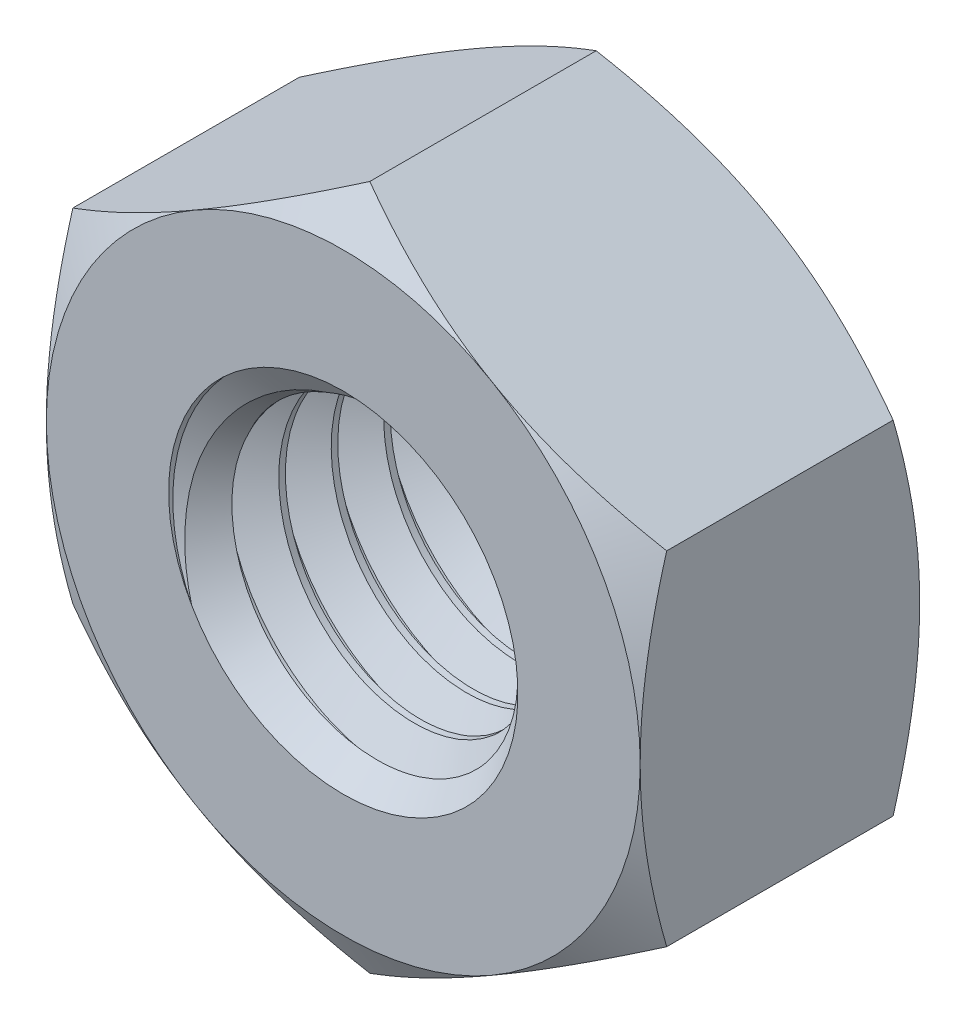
ISO-10303-21;
HEADER;
FILE_DESCRIPTION(('STEP AP214'),'2;1');
FILE_NAME('part.step','',(''),(''),'','','');
FILE_SCHEMA(('AUTOMOTIVE_DESIGN { 1 0 10303 214 1 1 1 1 }'));
ENDSEC;
DATA;
#1=APPLICATION_CONTEXT('core data for automotive mechanical design processes');
#2=APPLICATION_PROTOCOL_DEFINITION('international standard','automotive_design',2000,#1);
#3=PRODUCT_CONTEXT('',#1,'mechanical');
#4=PRODUCT('Part','Part','',(#3));
#5=PRODUCT_RELATED_PRODUCT_CATEGORY('part','',(#4));
#6=PRODUCT_DEFINITION_FORMATION('','',#4);
#7=PRODUCT_DEFINITION_CONTEXT('part definition',#1,'design');
#8=PRODUCT_DEFINITION('design','',#6,#7);
#9=PRODUCT_DEFINITION_SHAPE('','',#8);
#10=(LENGTH_UNIT() NAMED_UNIT(*) SI_UNIT(.MILLI.,.METRE.));
#11=(NAMED_UNIT(*) PLANE_ANGLE_UNIT() SI_UNIT($,.RADIAN.));
#12=(NAMED_UNIT(*) SI_UNIT($,.STERADIAN.) SOLID_ANGLE_UNIT());
#13=UNCERTAINTY_MEASURE_WITH_UNIT(LENGTH_MEASURE(1.E-05),#10,'distance_accuracy_value','');
#14=(GEOMETRIC_REPRESENTATION_CONTEXT(3) GLOBAL_UNCERTAINTY_ASSIGNED_CONTEXT((#13)) GLOBAL_UNIT_ASSIGNED_CONTEXT((#10,
#11,#12)) REPRESENTATION_CONTEXT('',''));
#15=CARTESIAN_POINT('',(0.,0.,0.));
#16=DIRECTION('',(0.,0.,1.));
#17=DIRECTION('',(1.,0.,0.));
#18=AXIS2_PLACEMENT_3D('',#15,#16,#17);
#19=CARTESIAN_POINT('',(0.,9.81495457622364,4.));
#20=DIRECTION('',(0.5,-0.866025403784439,0.));
#21=DIRECTION('',(0.866025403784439,0.5,0.));
#22=AXIS2_PLACEMENT_3D('',#19,#20,#21);
#23=PLANE('',#22);
#24=DIRECTION('',(0.,0.,-1.));
#25=VECTOR('',#24,1.);
#26=CARTESIAN_POINT('',(0.,9.81495457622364,4.));
#27=LINE('',#26,#25);
#28=CARTESIAN_POINT('',(0.,9.81495457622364,3.24081062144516));
#29=VERTEX_POINT('',#28);
#30=CARTESIAN_POINT('',(0.,9.81495457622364,-3.24081062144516));
#31=VERTEX_POINT('',#30);
#32=EDGE_CURVE('E413',#29,#31,#27,.T.);
#33=ORIENTED_EDGE('',*,*,#32,.T.);
#34=CARTESIAN_POINT('',(0.000199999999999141,9.81507004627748,-3.24074395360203));
#35=CARTESIAN_POINT('',(-0.186639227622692,9.70719836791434,-3.30301386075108));
#36=CARTESIAN_POINT('',(-0.374175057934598,9.59892450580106,-3.36245770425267));
#37=CARTESIAN_POINT('',(-0.750769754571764,9.3814974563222,-3.47491488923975));
#38=CARTESIAN_POINT('',(-0.939829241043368,9.27234391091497,-3.52792545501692));
#39=CARTESIAN_POINT('',(-1.5100347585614,8.94313560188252,-3.67626661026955));
#40=CARTESIAN_POINT('',(-1.89343164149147,8.72178130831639,-3.76064107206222));
#41=CARTESIAN_POINT('',(-2.46717766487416,8.39052888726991,-3.85957998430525));
#42=CARTESIAN_POINT('',(-2.65581276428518,8.28162036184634,-3.88776480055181));
#43=CARTESIAN_POINT('',(-3.03393602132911,8.06331079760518,-3.9350259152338));
#44=CARTESIAN_POINT('',(-3.22342410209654,7.95390980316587,-3.95410301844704));
#45=CARTESIAN_POINT('',(-3.6027265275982,7.73491944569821,-3.9826652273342));
#46=CARTESIAN_POINT('',(-3.79254025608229,7.62533043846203,-3.99216121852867));
#47=CARTESIAN_POINT('',(-4.17234305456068,7.40605119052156,-4.00135762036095));
#48=CARTESIAN_POINT('',(-4.36233211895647,7.29636095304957,-4.00105833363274));
#49=CARTESIAN_POINT('',(-4.71752301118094,7.09129139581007,-3.99134552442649));
#50=CARTESIAN_POINT('',(-4.8827499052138,6.99589760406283,-3.98311683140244));
#51=CARTESIAN_POINT('',(-5.21281671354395,6.80533344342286,-3.9594107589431));
#52=CARTESIAN_POINT('',(-5.37765660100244,6.71016309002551,-3.9439328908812));
#53=CARTESIAN_POINT('',(-5.87153810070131,6.42502047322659,-3.88699137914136));
#54=CARTESIAN_POINT('',(-6.19970550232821,6.23555293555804,-3.83502693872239));
#55=CARTESIAN_POINT('',(-6.85952142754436,5.8546080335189,-3.70511505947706));
#56=CARTESIAN_POINT('',(-7.19108574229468,5.66317928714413,-3.62661693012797));
#57=CARTESIAN_POINT('',(-7.84926989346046,5.28317649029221,-3.44845866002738));
#58=CARTESIAN_POINT('',(-8.17589815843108,5.09459757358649,-3.34884036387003));
#59=CARTESIAN_POINT('',(-8.5002,4.90736181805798,-3.24074395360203));
#60=B_SPLINE_CURVE_WITH_KNOTS('',3,(#34,#35,#36,#37,#38,#39,#40,#41,#42,#43,#44,#45,#46,#47,#48,
#49,#50,#51,#52,#53,#54,#55,#56,#57,#58,#59),.UNSPECIFIED.,.F.,.F.,(4,2,2,2,2,2,2,2,2,2,2,2,4),
(0.,0.673596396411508,1.34748239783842,2.69805431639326,3.356799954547,4.01548737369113,
4.67342558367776,5.33134346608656,5.90409556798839,6.47688628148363,7.62328361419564,
8.79510569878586,9.9646274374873),.UNSPECIFIED.);
#61=CARTESIAN_POINT('',(-4.25,7.36121593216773,-4.));
#62=VERTEX_POINT('',#61);
#63=EDGE_CURVE('E60',#31,#62,#60,.T.);
#64=ORIENTED_EDGE('',*,*,#63,.T.);
#65=CARTESIAN_POINT('',(-8.5,4.90747728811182,-3.24081062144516));
#66=VERTEX_POINT('',#65);
#67=EDGE_CURVE('E210',#62,#66,#60,.T.);
#68=ORIENTED_EDGE('',*,*,#67,.T.);
#69=DIRECTION('',(0.,0.,-1.));
#70=VECTOR('',#69,1.);
#71=CARTESIAN_POINT('',(-8.5,4.90747728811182,4.));
#72=LINE('',#71,#70);
#73=CARTESIAN_POINT('',(-8.5,4.90747728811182,3.24081062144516));
#74=VERTEX_POINT('',#73);
#75=EDGE_CURVE('E368',#74,#66,#72,.T.);
#76=ORIENTED_EDGE('',*,*,#75,.F.);
#77=CARTESIAN_POINT('',(0.000199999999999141,9.81507004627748,3.24074395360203));
#78=CARTESIAN_POINT('',(-0.186639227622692,9.70719836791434,3.30301386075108));
#79=CARTESIAN_POINT('',(-0.374175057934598,9.59892450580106,3.36245770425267));
#80=CARTESIAN_POINT('',(-0.750769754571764,9.3814974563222,3.47491488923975));
#81=CARTESIAN_POINT('',(-0.939829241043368,9.27234391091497,3.52792545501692));
#82=CARTESIAN_POINT('',(-1.5100347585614,8.94313560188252,3.67626661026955));
#83=CARTESIAN_POINT('',(-1.89343164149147,8.72178130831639,3.76064107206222));
#84=CARTESIAN_POINT('',(-2.46717766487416,8.39052888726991,3.85957998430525));
#85=CARTESIAN_POINT('',(-2.65581276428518,8.28162036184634,3.88776480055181));
#86=CARTESIAN_POINT('',(-3.03393602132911,8.06331079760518,3.9350259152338));
#87=CARTESIAN_POINT('',(-3.22342410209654,7.95390980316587,3.95410301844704));
#88=CARTESIAN_POINT('',(-3.6027265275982,7.73491944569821,3.9826652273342));
#89=CARTESIAN_POINT('',(-3.79254025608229,7.62533043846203,3.99216121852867));
#90=CARTESIAN_POINT('',(-4.17234305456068,7.40605119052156,4.00135762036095));
#91=CARTESIAN_POINT('',(-4.36233211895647,7.29636095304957,4.00105833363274));
#92=CARTESIAN_POINT('',(-4.71752301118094,7.09129139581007,3.99134552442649));
#93=CARTESIAN_POINT('',(-4.8827499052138,6.99589760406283,3.98311683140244));
#94=CARTESIAN_POINT('',(-5.21281671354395,6.80533344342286,3.9594107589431));
#95=CARTESIAN_POINT('',(-5.37765660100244,6.71016309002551,3.9439328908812));
#96=CARTESIAN_POINT('',(-5.87153810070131,6.42502047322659,3.88699137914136));
#97=CARTESIAN_POINT('',(-6.19970550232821,6.23555293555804,3.83502693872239));
#98=CARTESIAN_POINT('',(-6.85952142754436,5.8546080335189,3.70511505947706));
#99=CARTESIAN_POINT('',(-7.19108574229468,5.66317928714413,3.62661693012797));
#100=CARTESIAN_POINT('',(-7.84926989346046,5.28317649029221,3.44845866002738));
#101=CARTESIAN_POINT('',(-8.17589815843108,5.09459757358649,3.34884036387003));
#102=CARTESIAN_POINT('',(-8.5002,4.90736181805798,3.24074395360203));
#103=B_SPLINE_CURVE_WITH_KNOTS('',3,(#77,#78,#79,#80,#81,#82,#83,#84,#85,#86,#87,#88,#89,#90,
#91,#92,#93,#94,#95,#96,#97,#98,#99,#100,#101,#102),.UNSPECIFIED.,.F.,.F.,(4,2,2,2,2,2,2,2,2,2,
2,2,4),(0.,0.673596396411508,1.34748239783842,2.69805431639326,3.356799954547,4.01548737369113,
4.67342558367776,5.33134346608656,5.90409556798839,6.47688628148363,7.62328361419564,
8.79510569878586,9.9646274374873),.UNSPECIFIED.);
#104=CARTESIAN_POINT('',(-4.25,7.36121593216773,4.));
#105=VERTEX_POINT('',#104);
#106=EDGE_CURVE('E273',#105,#74,#103,.T.);
#107=ORIENTED_EDGE('',*,*,#106,.F.);
#108=EDGE_CURVE('E279',#29,#105,#103,.T.);
#109=ORIENTED_EDGE('',*,*,#108,.F.);
#110=EDGE_LOOP('',(#33,#64,#68,#76,#107,#109));
#111=FACE_BOUND('',#110,.T.);
#112=ADVANCED_FACE('F38',(#111),#23,.F.);
#113=CARTESIAN_POINT('',(-8.5,4.90747728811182,4.));
#114=DIRECTION('',(1.,0.,0.));
#115=DIRECTION('',(0.,0.,-1.));
#116=AXIS2_PLACEMENT_3D('',#113,#114,#115);
#117=PLANE('',#116);
#118=ORIENTED_EDGE('',*,*,#75,.T.);
#119=CARTESIAN_POINT('',(-8.5,-13.1882453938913,0.151216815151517));
#120=CARTESIAN_POINT('',(-8.5,-12.816834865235,-0.0289753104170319));
#121=CARTESIAN_POINT('',(-8.5,-12.4445721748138,-0.207441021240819));
#122=CARTESIAN_POINT('',(-8.5,-11.6978890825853,-0.559948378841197));
#123=CARTESIAN_POINT('',(-8.5,-11.3234683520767,-0.733989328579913));
#124=CARTESIAN_POINT('',(-8.5,-10.5700909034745,-1.07754960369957));
#125=CARTESIAN_POINT('',(-8.5,-10.191120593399,-1.24703922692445));
#126=CARTESIAN_POINT('',(-8.5,-9.43016670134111,-1.57908711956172));
#127=CARTESIAN_POINT('',(-8.5,-9.04818326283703,-1.74164571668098));
#128=CARTESIAN_POINT('',(-8.5,-8.26846665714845,-2.06299968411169));
#129=CARTESIAN_POINT('',(-8.5,-7.87061705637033,-2.22151410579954));
#130=CARTESIAN_POINT('',(-8.5,-7.07026726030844,-2.52656091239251));
#131=CARTESIAN_POINT('',(-8.5,-6.66776654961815,-2.67309195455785));
#132=CARTESIAN_POINT('',(-8.5,-5.85821953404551,-2.95033104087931));
#133=CARTESIAN_POINT('',(-8.5,-5.4511842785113,-3.08107100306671));
#134=CARTESIAN_POINT('',(-8.5,-4.63129112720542,-3.32253965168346));
#135=CARTESIAN_POINT('',(-8.5,-4.21843510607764,-3.43327462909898));
#136=CARTESIAN_POINT('',(-8.5,-3.38877418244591,-3.62885666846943));
#137=CARTESIAN_POINT('',(-8.5,-2.97200167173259,-3.71383742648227));
#138=CARTESIAN_POINT('',(-8.5,-2.34304399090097,-3.81829079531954));
#139=CARTESIAN_POINT('',(-8.5,-2.13274355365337,-3.84927364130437));
#140=CARTESIAN_POINT('',(-8.5,-1.71109527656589,-3.90295935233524));
#141=CARTESIAN_POINT('',(-8.5,-1.49974753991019,-3.92566301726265));
#142=CARTESIAN_POINT('',(-8.5,-1.07905289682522,-3.9620528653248));
#143=CARTESIAN_POINT('',(-8.5,-0.869715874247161,-3.97585286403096));
#144=CARTESIAN_POINT('',(-8.5,-0.450645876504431,-3.99458792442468));
#145=CARTESIAN_POINT('',(-8.5,-0.240912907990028,-3.99952313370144));
#146=CARTESIAN_POINT('',(-8.5,0.178577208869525,-4.00041088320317));
#147=CARTESIAN_POINT('',(-8.5,0.388334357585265,-3.99636325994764));
#148=CARTESIAN_POINT('',(-8.5,0.807491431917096,-3.97938404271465));
#149=CARTESIAN_POINT('',(-8.5,1.01689133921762,-3.96645200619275));
#150=CARTESIAN_POINT('',(-8.5,1.51977373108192,-3.92500049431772));
#151=CARTESIAN_POINT('',(-8.5,1.81291776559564,-3.8922865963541));
#152=CARTESIAN_POINT('',(-8.5,2.39702196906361,-3.81122903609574));
#153=CARTESIAN_POINT('',(-8.5,2.68798183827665,-3.76288326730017));
#154=CARTESIAN_POINT('',(-8.5,3.55724087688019,-3.59696294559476));
#155=CARTESIAN_POINT('',(-8.5,4.1316116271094,-3.4585341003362));
#156=CARTESIAN_POINT('',(-8.5,4.99082296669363,-3.21849787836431));
#157=CARTESIAN_POINT('',(-8.5,5.28011446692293,-3.13190823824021));
#158=CARTESIAN_POINT('',(-8.5,5.85588560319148,-2.94975328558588));
#159=CARTESIAN_POINT('',(-8.5,6.14236521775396,-2.85418790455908));
#160=CARTESIAN_POINT('',(-8.5,6.71260871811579,-2.65561389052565));
#161=CARTESIAN_POINT('',(-8.5,6.99637342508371,-2.55260759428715));
#162=CARTESIAN_POINT('',(-8.5,7.56154733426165,-2.34036239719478));
#163=CARTESIAN_POINT('',(-8.5,7.84295659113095,-2.2311236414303));
#164=CARTESIAN_POINT('',(-8.5,8.61077112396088,-1.9248604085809));
#165=CARTESIAN_POINT('',(-8.5,9.09508061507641,-1.72258645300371));
#166=CARTESIAN_POINT('',(-8.5,10.0587230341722,-1.30647175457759));
#167=CARTESIAN_POINT('',(-8.5,10.5380554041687,-1.09262973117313));
#168=CARTESIAN_POINT('',(-8.5,11.492916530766,-0.656172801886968));
#169=CARTESIAN_POINT('',(-8.5,11.9684437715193,-0.433554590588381));
#170=CARTESIAN_POINT('',(-8.5,12.9163003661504,0.0183173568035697));
#171=CARTESIAN_POINT('',(-8.5,13.3886298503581,0.247570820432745));
#172=CARTESIAN_POINT('',(-8.5,14.3314832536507,0.711611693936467));
#173=CARTESIAN_POINT('',(-8.5,14.8020031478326,0.9464072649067));
#174=CARTESIAN_POINT('',(-8.5,15.7409775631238,1.42009557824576));
#175=CARTESIAN_POINT('',(-8.5,16.2094320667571,1.65898835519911));
#176=CARTESIAN_POINT('',(-8.5,17.1445482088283,2.1400031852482));
#177=CARTESIAN_POINT('',(-8.5,17.611210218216,2.38212451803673));
#178=CARTESIAN_POINT('',(-8.5,18.5431403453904,2.86903649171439));
#179=CARTESIAN_POINT('',(-8.5,19.0084084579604,3.11382714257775));
#180=CARTESIAN_POINT('',(-8.5,20.3025967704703,3.79862166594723));
#181=CARTESIAN_POINT('',(-8.5,21.1302541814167,4.24101157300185));
#182=CARTESIAN_POINT('',(-8.5,22.7829135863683,5.13083397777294));
#183=CARTESIAN_POINT('',(-8.5,23.6079154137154,5.57826678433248));
#184=CARTESIAN_POINT('',(-8.5,25.2531957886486,6.47542545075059));
#185=CARTESIAN_POINT('',(-8.5,26.0734809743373,6.9251391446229));
#186=CARTESIAN_POINT('',(-8.5,27.3026967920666,7.60183424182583));
#187=CARTESIAN_POINT('',(-8.5,27.7122177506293,7.82774467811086));
#188=CARTESIAN_POINT('',(-8.5,28.5309085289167,8.28019986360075));
#189=CARTESIAN_POINT('',(-8.5,28.9400783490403,8.50674461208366));
#190=CARTESIAN_POINT('',(-8.5,29.3490942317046,8.73356701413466));
#191=B_SPLINE_CURVE_WITH_KNOTS('',3,(#119,#120,#121,#122,#123,#124,#125,#126,#127,#128,#129,
#130,#131,#132,#133,#134,#135,#136,#137,#138,#139,#140,#141,#142,#143,#144,#145,#146,#147,#148,
#149,#150,#151,#152,#153,#154,#155,#156,#157,#158,#159,#160,#161,#162,#163,#164,#165,#166,#167,
#168,#169,#170,#171,#172,#173,#174,#175,#176,#177,#178,#179,#180,#181,#182,#183,#184,#185,#186,
#187,#188,#189,#190),.UNSPECIFIED.,.F.,.F.,(4,2,2,2,2,2,2,2,2,2,2,2,2,2,2,2,2,2,2,2,2,2,2,2,2,2,
2,2,2,2,2,2,2,2,2,4),(0.,1.23845559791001,2.47710509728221,3.72248397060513,4.96780389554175,
6.25244985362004,7.53723955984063,8.81938728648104,10.101131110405,11.3761024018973,
12.0136765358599,12.6511890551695,13.2803817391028,13.9095639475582,14.5387576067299,
15.1679826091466,16.0523749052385,16.9368864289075,18.7068328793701,19.6126743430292,
20.5185227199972,21.4240878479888,22.3296319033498,23.9039620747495,25.478466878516,
27.0535704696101,28.6286094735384,30.2061336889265,31.783671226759,33.3608625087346,
34.9380596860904,37.753441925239,40.568997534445,43.3754093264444,44.7785078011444,
46.1816046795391),.UNSPECIFIED.);
#192=CARTESIAN_POINT('',(-8.5,0.,-4.));
#193=VERTEX_POINT('',#192);
#194=EDGE_CURVE('E432',#66,#193,#191,.F.);
#195=ORIENTED_EDGE('',*,*,#194,.T.);
#196=CARTESIAN_POINT('',(-8.5,-4.90747728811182,-3.24081062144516));
#197=VERTEX_POINT('',#196);
#198=EDGE_CURVE('E236',#193,#197,#191,.F.);
#199=ORIENTED_EDGE('',*,*,#198,.T.);
#200=DIRECTION('',(0.,0.,-1.));
#201=VECTOR('',#200,1.);
#202=CARTESIAN_POINT('',(-8.5,-4.90747728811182,4.));
#203=LINE('',#202,#201);
#204=CARTESIAN_POINT('',(-8.5,-4.90747728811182,3.24081062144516));
#205=VERTEX_POINT('',#204);
#206=EDGE_CURVE('E421',#205,#197,#203,.T.);
#207=ORIENTED_EDGE('',*,*,#206,.F.);
#208=CARTESIAN_POINT('',(-8.5,-13.1882453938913,-0.151216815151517));
#209=CARTESIAN_POINT('',(-8.5,-12.816834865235,0.0289753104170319));
#210=CARTESIAN_POINT('',(-8.5,-12.4445721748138,0.207441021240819));
#211=CARTESIAN_POINT('',(-8.5,-11.6978890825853,0.559948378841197));
#212=CARTESIAN_POINT('',(-8.5,-11.3234683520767,0.733989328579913));
#213=CARTESIAN_POINT('',(-8.5,-10.5700909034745,1.07754960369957));
#214=CARTESIAN_POINT('',(-8.5,-10.191120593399,1.24703922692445));
#215=CARTESIAN_POINT('',(-8.5,-9.43016670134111,1.57908711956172));
#216=CARTESIAN_POINT('',(-8.5,-9.04818326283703,1.74164571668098));
#217=CARTESIAN_POINT('',(-8.5,-8.26846665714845,2.06299968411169));
#218=CARTESIAN_POINT('',(-8.5,-7.87061705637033,2.22151410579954));
#219=CARTESIAN_POINT('',(-8.5,-7.07026726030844,2.52656091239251));
#220=CARTESIAN_POINT('',(-8.5,-6.66776654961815,2.67309195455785));
#221=CARTESIAN_POINT('',(-8.5,-5.85821953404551,2.95033104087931));
#222=CARTESIAN_POINT('',(-8.5,-5.4511842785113,3.08107100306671));
#223=CARTESIAN_POINT('',(-8.5,-4.63129112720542,3.32253965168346));
#224=CARTESIAN_POINT('',(-8.5,-4.21843510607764,3.43327462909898));
#225=CARTESIAN_POINT('',(-8.5,-3.38877418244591,3.62885666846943));
#226=CARTESIAN_POINT('',(-8.5,-2.97200167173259,3.71383742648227));
#227=CARTESIAN_POINT('',(-8.5,-2.34304399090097,3.81829079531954));
#228=CARTESIAN_POINT('',(-8.5,-2.13274355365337,3.84927364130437));
#229=CARTESIAN_POINT('',(-8.5,-1.71109527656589,3.90295935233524));
#230=CARTESIAN_POINT('',(-8.5,-1.49974753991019,3.92566301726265));
#231=CARTESIAN_POINT('',(-8.5,-1.07905289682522,3.9620528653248));
#232=CARTESIAN_POINT('',(-8.5,-0.869715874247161,3.97585286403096));
#233=CARTESIAN_POINT('',(-8.5,-0.450645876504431,3.99458792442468));
#234=CARTESIAN_POINT('',(-8.5,-0.240912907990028,3.99952313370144));
#235=CARTESIAN_POINT('',(-8.5,0.178577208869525,4.00041088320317));
#236=CARTESIAN_POINT('',(-8.5,0.388334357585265,3.99636325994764));
#237=CARTESIAN_POINT('',(-8.5,0.807491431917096,3.97938404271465));
#238=CARTESIAN_POINT('',(-8.5,1.01689133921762,3.96645200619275));
#239=CARTESIAN_POINT('',(-8.5,1.51977373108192,3.92500049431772));
#240=CARTESIAN_POINT('',(-8.5,1.81291776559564,3.8922865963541));
#241=CARTESIAN_POINT('',(-8.5,2.39702196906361,3.81122903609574));
#242=CARTESIAN_POINT('',(-8.5,2.68798183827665,3.76288326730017));
#243=CARTESIAN_POINT('',(-8.5,3.55724087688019,3.59696294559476));
#244=CARTESIAN_POINT('',(-8.5,4.1316116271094,3.4585341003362));
#245=CARTESIAN_POINT('',(-8.5,4.99082296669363,3.21849787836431));
#246=CARTESIAN_POINT('',(-8.5,5.28011446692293,3.13190823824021));
#247=CARTESIAN_POINT('',(-8.5,5.85588560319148,2.94975328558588));
#248=CARTESIAN_POINT('',(-8.5,6.14236521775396,2.85418790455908));
#249=CARTESIAN_POINT('',(-8.5,6.71260871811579,2.65561389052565));
#250=CARTESIAN_POINT('',(-8.5,6.99637342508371,2.55260759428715));
#251=CARTESIAN_POINT('',(-8.5,7.56154733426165,2.34036239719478));
#252=CARTESIAN_POINT('',(-8.5,7.84295659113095,2.2311236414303));
#253=CARTESIAN_POINT('',(-8.5,8.61077112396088,1.9248604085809));
#254=CARTESIAN_POINT('',(-8.5,9.09508061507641,1.72258645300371));
#255=CARTESIAN_POINT('',(-8.5,10.0587230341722,1.30647175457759));
#256=CARTESIAN_POINT('',(-8.5,10.5380554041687,1.09262973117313));
#257=CARTESIAN_POINT('',(-8.5,11.492916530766,0.656172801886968));
#258=CARTESIAN_POINT('',(-8.5,11.9684437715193,0.433554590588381));
#259=CARTESIAN_POINT('',(-8.5,12.9163003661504,-0.0183173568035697));
#260=CARTESIAN_POINT('',(-8.5,13.3886298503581,-0.247570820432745));
#261=CARTESIAN_POINT('',(-8.5,14.3314832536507,-0.711611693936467));
#262=CARTESIAN_POINT('',(-8.5,14.8020031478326,-0.9464072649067));
#263=CARTESIAN_POINT('',(-8.5,15.7409775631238,-1.42009557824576));
#264=CARTESIAN_POINT('',(-8.5,16.2094320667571,-1.65898835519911));
#265=CARTESIAN_POINT('',(-8.5,17.1445482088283,-2.1400031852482));
#266=CARTESIAN_POINT('',(-8.5,17.611210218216,-2.38212451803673));
#267=CARTESIAN_POINT('',(-8.5,18.5431403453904,-2.86903649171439));
#268=CARTESIAN_POINT('',(-8.5,19.0084084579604,-3.11382714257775));
#269=CARTESIAN_POINT('',(-8.5,20.3025967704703,-3.79862166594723));
#270=CARTESIAN_POINT('',(-8.5,21.1302541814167,-4.24101157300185));
#271=CARTESIAN_POINT('',(-8.5,22.7829135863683,-5.13083397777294));
#272=CARTESIAN_POINT('',(-8.5,23.6079154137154,-5.57826678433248));
#273=CARTESIAN_POINT('',(-8.5,25.2531957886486,-6.47542545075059));
#274=CARTESIAN_POINT('',(-8.5,26.0734809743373,-6.9251391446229));
#275=CARTESIAN_POINT('',(-8.5,27.3026967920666,-7.60183424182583));
#276=CARTESIAN_POINT('',(-8.5,27.7122177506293,-7.82774467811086));
#277=CARTESIAN_POINT('',(-8.5,28.5309085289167,-8.28019986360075));
#278=CARTESIAN_POINT('',(-8.5,28.9400783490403,-8.50674461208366));
#279=CARTESIAN_POINT('',(-8.5,29.3490942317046,-8.73356701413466));
#280=B_SPLINE_CURVE_WITH_KNOTS('',3,(#208,#209,#210,#211,#212,#213,#214,#215,#216,#217,#218,
#219,#220,#221,#222,#223,#224,#225,#226,#227,#228,#229,#230,#231,#232,#233,#234,#235,#236,#237,
#238,#239,#240,#241,#242,#243,#244,#245,#246,#247,#248,#249,#250,#251,#252,#253,#254,#255,#256,
#257,#258,#259,#260,#261,#262,#263,#264,#265,#266,#267,#268,#269,#270,#271,#272,#273,#274,#275,
#276,#277,#278,#279),.UNSPECIFIED.,.F.,.F.,(4,2,2,2,2,2,2,2,2,2,2,2,2,2,2,2,2,2,2,2,2,2,2,2,2,2,
2,2,2,2,2,2,2,2,2,4),(0.,1.23845559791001,2.47710509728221,3.72248397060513,4.96780389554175,
6.25244985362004,7.53723955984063,8.81938728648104,10.101131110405,11.3761024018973,
12.0136765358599,12.6511890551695,13.2803817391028,13.9095639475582,14.5387576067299,
15.1679826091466,16.0523749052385,16.9368864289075,18.7068328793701,19.6126743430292,
20.5185227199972,21.4240878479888,22.3296319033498,23.9039620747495,25.478466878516,
27.0535704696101,28.6286094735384,30.2061336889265,31.783671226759,33.3608625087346,
34.9380596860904,37.753441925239,40.568997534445,43.3754093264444,44.7785078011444,
46.1816046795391),.UNSPECIFIED.);
#281=CARTESIAN_POINT('',(-8.5,0.,4.));
#282=VERTEX_POINT('',#281);
#283=EDGE_CURVE('E266',#282,#205,#280,.F.);
#284=ORIENTED_EDGE('',*,*,#283,.F.);
#285=EDGE_CURVE('E272',#74,#282,#280,.F.);
#286=ORIENTED_EDGE('',*,*,#285,.F.);
#287=EDGE_LOOP('',(#118,#195,#199,#207,#284,#286));
#288=FACE_BOUND('',#287,.T.);
#289=ADVANCED_FACE('F245',(#288),#117,.F.);
#290=CARTESIAN_POINT('',(-8.5,-4.90747728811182,4.));
#291=DIRECTION('',(0.5,0.866025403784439,0.));
#292=DIRECTION('',(-0.866025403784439,0.5,0.));
#293=AXIS2_PLACEMENT_3D('',#290,#291,#292);
#294=PLANE('',#293);
#295=ORIENTED_EDGE('',*,*,#206,.T.);
#296=CARTESIAN_POINT('',(-8.5002,-4.90736181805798,-3.24074395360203));
#297=CARTESIAN_POINT('',(-8.31336077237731,-5.01523349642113,-3.30301386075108));
#298=CARTESIAN_POINT('',(-8.1258249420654,-5.12350735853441,-3.36245770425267));
#299=CARTESIAN_POINT('',(-7.74923024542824,-5.34093440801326,-3.47491488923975));
#300=CARTESIAN_POINT('',(-7.56017075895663,-5.45008795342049,-3.52792545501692));
#301=CARTESIAN_POINT('',(-6.9899652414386,-5.77929626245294,-3.67626661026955));
#302=CARTESIAN_POINT('',(-6.60656835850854,-6.00065055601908,-3.76064107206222));
#303=CARTESIAN_POINT('',(-6.03282233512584,-6.33190297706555,-3.85957998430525));
#304=CARTESIAN_POINT('',(-5.84418723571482,-6.44081150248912,-3.8877648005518));
#305=CARTESIAN_POINT('',(-5.46606397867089,-6.65912106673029,-3.9350259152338));
#306=CARTESIAN_POINT('',(-5.27657589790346,-6.76852206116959,-3.95410301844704));
#307=CARTESIAN_POINT('',(-4.8972734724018,-6.98751241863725,-3.9826652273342));
#308=CARTESIAN_POINT('',(-4.70745974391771,-7.09710142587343,-3.99216121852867));
#309=CARTESIAN_POINT('',(-4.32765694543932,-7.3163806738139,-4.00135762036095));
#310=CARTESIAN_POINT('',(-4.13766788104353,-7.42607091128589,-4.00105833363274));
#311=CARTESIAN_POINT('',(-3.78247698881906,-7.63114046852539,-3.99134552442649));
#312=CARTESIAN_POINT('',(-3.6172500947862,-7.72653426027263,-3.98311683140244));
#313=CARTESIAN_POINT('',(-3.28718328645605,-7.9170984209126,-3.95941075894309));
#314=CARTESIAN_POINT('',(-3.12234339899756,-8.01226877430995,-3.9439328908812));
#315=CARTESIAN_POINT('',(-2.62846189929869,-8.29741139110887,-3.88699137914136));
#316=CARTESIAN_POINT('',(-2.30029449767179,-8.48687892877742,-3.83502693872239));
#317=CARTESIAN_POINT('',(-1.64047857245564,-8.86782383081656,-3.70511505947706));
#318=CARTESIAN_POINT('',(-1.30891425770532,-9.05925257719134,-3.62661693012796));
#319=CARTESIAN_POINT('',(-0.650730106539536,-9.43925537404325,-3.44845866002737));
#320=CARTESIAN_POINT('',(-0.324101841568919,-9.62783429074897,-3.34884036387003));
#321=CARTESIAN_POINT('',(0.000200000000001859,-9.81507004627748,-3.24074395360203));
#322=B_SPLINE_CURVE_WITH_KNOTS('',3,(#296,#297,#298,#299,#300,#301,#302,#303,#304,#305,#306,
#307,#308,#309,#310,#311,#312,#313,#314,#315,#316,#317,#318,#319,#320,#321),.UNSPECIFIED.,.F.,
.F.,(4,2,2,2,2,2,2,2,2,2,2,2,4),(0.,0.673596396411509,1.34748239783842,2.69805431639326,
3.356799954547,4.01548737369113,4.67342558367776,5.33134346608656,5.9040955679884,
6.47688628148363,7.62328361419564,8.79510569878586,9.9646274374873),.UNSPECIFIED.);
#323=CARTESIAN_POINT('',(-4.25,-7.36121593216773,-4.));
#324=VERTEX_POINT('',#323);
#325=EDGE_CURVE('E234',#197,#324,#322,.T.);
#326=ORIENTED_EDGE('',*,*,#325,.T.);
#327=CARTESIAN_POINT('',(0.,-9.81495457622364,-3.24081062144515));
#328=VERTEX_POINT('',#327);
#329=EDGE_CURVE('E227',#324,#328,#322,.T.);
#330=ORIENTED_EDGE('',*,*,#329,.T.);
#331=DIRECTION('',(0.,0.,-1.));
#332=VECTOR('',#331,1.);
#333=CARTESIAN_POINT('',(0.,-9.81495457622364,4.));
#334=LINE('',#333,#332);
#335=CARTESIAN_POINT('',(0.,-9.81495457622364,3.24081062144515));
#336=VERTEX_POINT('',#335);
#337=EDGE_CURVE('E419',#336,#328,#334,.T.);
#338=ORIENTED_EDGE('',*,*,#337,.F.);
#339=CARTESIAN_POINT('',(-8.5002,-4.90736181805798,3.24074395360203));
#340=CARTESIAN_POINT('',(-8.31336077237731,-5.01523349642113,3.30301386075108));
#341=CARTESIAN_POINT('',(-8.1258249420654,-5.12350735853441,3.36245770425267));
#342=CARTESIAN_POINT('',(-7.74923024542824,-5.34093440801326,3.47491488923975));
#343=CARTESIAN_POINT('',(-7.56017075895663,-5.45008795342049,3.52792545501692));
#344=CARTESIAN_POINT('',(-6.9899652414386,-5.77929626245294,3.67626661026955));
#345=CARTESIAN_POINT('',(-6.60656835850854,-6.00065055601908,3.76064107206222));
#346=CARTESIAN_POINT('',(-6.03282233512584,-6.33190297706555,3.85957998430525));
#347=CARTESIAN_POINT('',(-5.84418723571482,-6.44081150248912,3.8877648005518));
#348=CARTESIAN_POINT('',(-5.46606397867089,-6.65912106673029,3.9350259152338));
#349=CARTESIAN_POINT('',(-5.27657589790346,-6.76852206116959,3.95410301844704));
#350=CARTESIAN_POINT('',(-4.8972734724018,-6.98751241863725,3.9826652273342));
#351=CARTESIAN_POINT('',(-4.70745974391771,-7.09710142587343,3.99216121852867));
#352=CARTESIAN_POINT('',(-4.32765694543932,-7.3163806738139,4.00135762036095));
#353=CARTESIAN_POINT('',(-4.13766788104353,-7.42607091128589,4.00105833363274));
#354=CARTESIAN_POINT('',(-3.78247698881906,-7.63114046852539,3.99134552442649));
#355=CARTESIAN_POINT('',(-3.6172500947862,-7.72653426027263,3.98311683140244));
#356=CARTESIAN_POINT('',(-3.28718328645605,-7.9170984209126,3.95941075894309));
#357=CARTESIAN_POINT('',(-3.12234339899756,-8.01226877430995,3.9439328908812));
#358=CARTESIAN_POINT('',(-2.62846189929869,-8.29741139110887,3.88699137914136));
#359=CARTESIAN_POINT('',(-2.30029449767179,-8.48687892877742,3.83502693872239));
#360=CARTESIAN_POINT('',(-1.64047857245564,-8.86782383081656,3.70511505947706));
#361=CARTESIAN_POINT('',(-1.30891425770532,-9.05925257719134,3.62661693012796));
#362=CARTESIAN_POINT('',(-0.650730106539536,-9.43925537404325,3.44845866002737));
#363=CARTESIAN_POINT('',(-0.324101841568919,-9.62783429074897,3.34884036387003));
#364=CARTESIAN_POINT('',(0.000200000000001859,-9.81507004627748,3.24074395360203));
#365=B_SPLINE_CURVE_WITH_KNOTS('',3,(#339,#340,#341,#342,#343,#344,#345,#346,#347,#348,#349,
#350,#351,#352,#353,#354,#355,#356,#357,#358,#359,#360,#361,#362,#363,#364),.UNSPECIFIED.,.F.,
.F.,(4,2,2,2,2,2,2,2,2,2,2,2,4),(0.,0.673596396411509,1.34748239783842,2.69805431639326,
3.356799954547,4.01548737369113,4.67342558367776,5.33134346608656,5.9040955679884,
6.47688628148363,7.62328361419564,8.79510569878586,9.9646274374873),.UNSPECIFIED.);
#366=CARTESIAN_POINT('',(-4.25,-7.36121593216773,4.));
#367=VERTEX_POINT('',#366);
#368=EDGE_CURVE('E251',#367,#336,#365,.T.);
#369=ORIENTED_EDGE('',*,*,#368,.F.);
#370=EDGE_CURVE('E258',#205,#367,#365,.T.);
#371=ORIENTED_EDGE('',*,*,#370,.F.);
#372=EDGE_LOOP('',(#295,#326,#330,#338,#369,#371));
#373=FACE_BOUND('',#372,.T.);
#374=ADVANCED_FACE('F241',(#373),#294,.F.);
#375=CARTESIAN_POINT('',(0.,-9.81495457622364,4.));
#376=DIRECTION('',(-0.5,0.866025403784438,0.));
#377=DIRECTION('',(-0.866025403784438,-0.5,0.));
#378=AXIS2_PLACEMENT_3D('',#375,#376,#377);
#379=PLANE('',#378);
#380=ORIENTED_EDGE('',*,*,#337,.T.);
#381=CARTESIAN_POINT('',(-0.000199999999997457,-9.81507004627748,-3.24074395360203));
#382=CARTESIAN_POINT('',(0.186639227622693,-9.70719836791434,-3.30301386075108));
#383=CARTESIAN_POINT('',(0.374175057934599,-9.59892450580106,-3.36245770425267));
#384=CARTESIAN_POINT('',(0.750769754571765,-9.3814974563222,-3.47491488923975));
#385=CARTESIAN_POINT('',(0.939829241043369,-9.27234391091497,-3.52792545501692));
#386=CARTESIAN_POINT('',(1.5100347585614,-8.94313560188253,-3.67626661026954));
#387=CARTESIAN_POINT('',(1.89343164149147,-8.72178130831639,-3.76064107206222));
#388=CARTESIAN_POINT('',(2.46717766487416,-8.39052888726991,-3.85957998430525));
#389=CARTESIAN_POINT('',(2.65581276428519,-8.28162036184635,-3.88776480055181));
#390=CARTESIAN_POINT('',(3.03393602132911,-8.06331079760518,-3.9350259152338));
#391=CARTESIAN_POINT('',(3.22342410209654,-7.95390980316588,-3.95410301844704));
#392=CARTESIAN_POINT('',(3.6027265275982,-7.73491944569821,-3.9826652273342));
#393=CARTESIAN_POINT('',(3.79254025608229,-7.62533043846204,-3.99216121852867));
#394=CARTESIAN_POINT('',(4.17234305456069,-7.40605119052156,-4.00135762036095));
#395=CARTESIAN_POINT('',(4.36233211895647,-7.29636095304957,-4.00105833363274));
#396=CARTESIAN_POINT('',(4.71752301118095,-7.09129139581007,-3.99134552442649));
#397=CARTESIAN_POINT('',(4.8827499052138,-6.99589760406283,-3.98311683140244));
#398=CARTESIAN_POINT('',(5.21281671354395,-6.80533344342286,-3.95941075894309));
#399=CARTESIAN_POINT('',(5.37765660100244,-6.71016309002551,-3.9439328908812));
#400=CARTESIAN_POINT('',(5.87153810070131,-6.42502047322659,-3.88699137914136));
#401=CARTESIAN_POINT('',(6.19970550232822,-6.23555293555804,-3.83502693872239));
#402=CARTESIAN_POINT('',(6.85952142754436,-5.8546080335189,-3.70511505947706));
#403=CARTESIAN_POINT('',(7.19108574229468,-5.66317928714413,-3.62661693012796));
#404=CARTESIAN_POINT('',(7.84926989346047,-5.28317649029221,-3.44845866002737));
#405=CARTESIAN_POINT('',(8.17589815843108,-5.09459757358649,-3.34884036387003));
#406=CARTESIAN_POINT('',(8.5002,-4.90736181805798,-3.24074395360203));
#407=B_SPLINE_CURVE_WITH_KNOTS('',3,(#381,#382,#383,#384,#385,#386,#387,#388,#389,#390,#391,
#392,#393,#394,#395,#396,#397,#398,#399,#400,#401,#402,#403,#404,#405,#406),.UNSPECIFIED.,.F.,
.F.,(4,2,2,2,2,2,2,2,2,2,2,2,4),(0.,0.673596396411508,1.34748239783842,2.69805431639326,
3.356799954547,4.01548737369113,4.67342558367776,5.33134346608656,5.9040955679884,
6.47688628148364,7.62328361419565,8.79510569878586,9.9646274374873),.UNSPECIFIED.);
#408=CARTESIAN_POINT('',(4.25,-7.36121593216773,-4.));
#409=VERTEX_POINT('',#408);
#410=EDGE_CURVE('E235',#328,#409,#407,.T.);
#411=ORIENTED_EDGE('',*,*,#410,.T.);
#412=CARTESIAN_POINT('',(8.5,-4.90747728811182,-3.24081062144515));
#413=VERTEX_POINT('',#412);
#414=EDGE_CURVE('E220',#409,#413,#407,.T.);
#415=ORIENTED_EDGE('',*,*,#414,.T.);
#416=DIRECTION('',(0.,0.,-1.));
#417=VECTOR('',#416,1.);
#418=CARTESIAN_POINT('',(8.5,-4.90747728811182,4.));
#419=LINE('',#418,#417);
#420=CARTESIAN_POINT('',(8.5,-4.90747728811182,3.24081062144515));
#421=VERTEX_POINT('',#420);
#422=EDGE_CURVE('E416',#421,#413,#419,.T.);
#423=ORIENTED_EDGE('',*,*,#422,.F.);
#424=CARTESIAN_POINT('',(-0.000199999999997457,-9.81507004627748,3.24074395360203));
#425=CARTESIAN_POINT('',(0.186639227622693,-9.70719836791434,3.30301386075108));
#426=CARTESIAN_POINT('',(0.374175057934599,-9.59892450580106,3.36245770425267));
#427=CARTESIAN_POINT('',(0.750769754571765,-9.3814974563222,3.47491488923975));
#428=CARTESIAN_POINT('',(0.939829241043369,-9.27234391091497,3.52792545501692));
#429=CARTESIAN_POINT('',(1.5100347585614,-8.94313560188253,3.67626661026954));
#430=CARTESIAN_POINT('',(1.89343164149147,-8.72178130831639,3.76064107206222));
#431=CARTESIAN_POINT('',(2.46717766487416,-8.39052888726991,3.85957998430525));
#432=CARTESIAN_POINT('',(2.65581276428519,-8.28162036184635,3.88776480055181));
#433=CARTESIAN_POINT('',(3.03393602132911,-8.06331079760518,3.9350259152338));
#434=CARTESIAN_POINT('',(3.22342410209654,-7.95390980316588,3.95410301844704));
#435=CARTESIAN_POINT('',(3.6027265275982,-7.73491944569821,3.9826652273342));
#436=CARTESIAN_POINT('',(3.79254025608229,-7.62533043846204,3.99216121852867));
#437=CARTESIAN_POINT('',(4.17234305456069,-7.40605119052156,4.00135762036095));
#438=CARTESIAN_POINT('',(4.36233211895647,-7.29636095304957,4.00105833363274));
#439=CARTESIAN_POINT('',(4.71752301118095,-7.09129139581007,3.99134552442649));
#440=CARTESIAN_POINT('',(4.8827499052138,-6.99589760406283,3.98311683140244));
#441=CARTESIAN_POINT('',(5.21281671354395,-6.80533344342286,3.95941075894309));
#442=CARTESIAN_POINT('',(5.37765660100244,-6.71016309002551,3.9439328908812));
#443=CARTESIAN_POINT('',(5.87153810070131,-6.42502047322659,3.88699137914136));
#444=CARTESIAN_POINT('',(6.19970550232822,-6.23555293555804,3.83502693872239));
#445=CARTESIAN_POINT('',(6.85952142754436,-5.8546080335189,3.70511505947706));
#446=CARTESIAN_POINT('',(7.19108574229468,-5.66317928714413,3.62661693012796));
#447=CARTESIAN_POINT('',(7.84926989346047,-5.28317649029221,3.44845866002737));
#448=CARTESIAN_POINT('',(8.17589815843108,-5.09459757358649,3.34884036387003));
#449=CARTESIAN_POINT('',(8.5002,-4.90736181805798,3.24074395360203));
#450=B_SPLINE_CURVE_WITH_KNOTS('',3,(#424,#425,#426,#427,#428,#429,#430,#431,#432,#433,#434,
#435,#436,#437,#438,#439,#440,#441,#442,#443,#444,#445,#446,#447,#448,#449),.UNSPECIFIED.,.F.,
.F.,(4,2,2,2,2,2,2,2,2,2,2,2,4),(0.,0.673596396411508,1.34748239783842,2.69805431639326,
3.356799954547,4.01548737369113,4.67342558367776,5.33134346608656,5.9040955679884,
6.47688628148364,7.62328361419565,8.79510569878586,9.9646274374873),.UNSPECIFIED.);
#451=CARTESIAN_POINT('',(4.25,-7.36121593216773,4.));
#452=VERTEX_POINT('',#451);
#453=EDGE_CURVE('E260',#452,#421,#450,.T.);
#454=ORIENTED_EDGE('',*,*,#453,.F.);
#455=EDGE_CURVE('E259',#336,#452,#450,.T.);
#456=ORIENTED_EDGE('',*,*,#455,.F.);
#457=EDGE_LOOP('',(#380,#411,#415,#423,#454,#456));
#458=FACE_BOUND('',#457,.T.);
#459=ADVANCED_FACE('F244',(#458),#379,.F.);
#460=CARTESIAN_POINT('',(8.5,-4.90747728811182,4.));
#461=DIRECTION('',(-1.,0.,0.));
#462=DIRECTION('',(0.,0.,1.));
#463=AXIS2_PLACEMENT_3D('',#460,#461,#462);
#464=PLANE('',#463);
#465=ORIENTED_EDGE('',*,*,#422,.T.);
#466=CARTESIAN_POINT('',(8.5,-13.1882453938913,0.151216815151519));
#467=CARTESIAN_POINT('',(8.5,-12.816834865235,-0.0289753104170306));
#468=CARTESIAN_POINT('',(8.5,-12.4445721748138,-0.207441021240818));
#469=CARTESIAN_POINT('',(8.5,-11.6978890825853,-0.559948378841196));
#470=CARTESIAN_POINT('',(8.5,-11.3234683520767,-0.733989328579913));
#471=CARTESIAN_POINT('',(8.5,-10.5700909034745,-1.07754960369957));
#472=CARTESIAN_POINT('',(8.5,-10.191120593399,-1.24703922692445));
#473=CARTESIAN_POINT('',(8.5,-9.4301667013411,-1.57908711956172));
#474=CARTESIAN_POINT('',(8.5,-9.04818326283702,-1.74164571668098));
#475=CARTESIAN_POINT('',(8.5,-8.26846665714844,-2.06299968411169));
#476=CARTESIAN_POINT('',(8.5,-7.87061705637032,-2.22151410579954));
#477=CARTESIAN_POINT('',(8.5,-7.07026726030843,-2.52656091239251));
#478=CARTESIAN_POINT('',(8.5,-6.66776654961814,-2.67309195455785));
#479=CARTESIAN_POINT('',(8.5,-5.8582195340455,-2.95033104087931));
#480=CARTESIAN_POINT('',(8.5,-5.45118427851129,-3.08107100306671));
#481=CARTESIAN_POINT('',(8.5,-4.63129112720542,-3.32253965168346));
#482=CARTESIAN_POINT('',(8.5,-4.21843510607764,-3.43327462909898));
#483=CARTESIAN_POINT('',(8.5,-3.38877418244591,-3.62885666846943));
#484=CARTESIAN_POINT('',(8.5,-2.97200167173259,-3.71383742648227));
#485=CARTESIAN_POINT('',(8.5,-2.34304399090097,-3.81829079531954));
#486=CARTESIAN_POINT('',(8.5,-2.13274355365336,-3.84927364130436));
#487=CARTESIAN_POINT('',(8.5,-1.71109527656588,-3.90295935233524));
#488=CARTESIAN_POINT('',(8.5,-1.49974753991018,-3.92566301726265));
#489=CARTESIAN_POINT('',(8.5,-1.07905289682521,-3.9620528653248));
#490=CARTESIAN_POINT('',(8.5,-0.869715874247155,-3.97585286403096));
#491=CARTESIAN_POINT('',(8.5,-0.450645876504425,-3.99458792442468));
#492=CARTESIAN_POINT('',(8.5,-0.240912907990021,-3.99952313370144));
#493=CARTESIAN_POINT('',(8.5,0.178577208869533,-4.00041088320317));
#494=CARTESIAN_POINT('',(8.5,0.388334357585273,-3.99636325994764));
#495=CARTESIAN_POINT('',(8.5,0.807491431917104,-3.97938404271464));
#496=CARTESIAN_POINT('',(8.5,1.01689133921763,-3.96645200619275));
#497=CARTESIAN_POINT('',(8.5,1.51977373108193,-3.92500049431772));
#498=CARTESIAN_POINT('',(8.5,1.81291776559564,-3.8922865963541));
#499=CARTESIAN_POINT('',(8.5,2.39702196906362,-3.81122903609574));
#500=CARTESIAN_POINT('',(8.5,2.68798183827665,-3.76288326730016));
#501=CARTESIAN_POINT('',(8.5,3.5572408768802,-3.59696294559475));
#502=CARTESIAN_POINT('',(8.5,4.13161162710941,-3.45853410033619));
#503=CARTESIAN_POINT('',(8.5,4.99082296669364,-3.21849787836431));
#504=CARTESIAN_POINT('',(8.5,5.28011446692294,-3.13190823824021));
#505=CARTESIAN_POINT('',(8.5,5.85588560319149,-2.94975328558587));
#506=CARTESIAN_POINT('',(8.5,6.14236521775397,-2.85418790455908));
#507=CARTESIAN_POINT('',(8.5,6.7126087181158,-2.65561389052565));
#508=CARTESIAN_POINT('',(8.5,6.99637342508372,-2.55260759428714));
#509=CARTESIAN_POINT('',(8.5,7.56154733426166,-2.34036239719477));
#510=CARTESIAN_POINT('',(8.5,7.84295659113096,-2.23112364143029));
#511=CARTESIAN_POINT('',(8.5,8.61077112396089,-1.92486040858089));
#512=CARTESIAN_POINT('',(8.5,9.09508061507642,-1.72258645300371));
#513=CARTESIAN_POINT('',(8.5,10.0587230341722,-1.30647175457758));
#514=CARTESIAN_POINT('',(8.5,10.5380554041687,-1.09262973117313));
#515=CARTESIAN_POINT('',(8.5,11.492916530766,-0.656172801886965));
#516=CARTESIAN_POINT('',(8.5,11.9684437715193,-0.433554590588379));
#517=CARTESIAN_POINT('',(8.5,12.9163003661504,0.0183173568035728));
#518=CARTESIAN_POINT('',(8.5,13.3886298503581,0.247570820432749));
#519=CARTESIAN_POINT('',(8.5,14.3314832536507,0.71161169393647));
#520=CARTESIAN_POINT('',(8.5,14.8020031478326,0.946407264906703));
#521=CARTESIAN_POINT('',(8.5,15.7409775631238,1.42009557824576));
#522=CARTESIAN_POINT('',(8.5,16.2094320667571,1.65898835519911));
#523=CARTESIAN_POINT('',(8.5,17.1445482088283,2.1400031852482));
#524=CARTESIAN_POINT('',(8.5,17.611210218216,2.38212451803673));
#525=CARTESIAN_POINT('',(8.5,18.5431403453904,2.86903649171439));
#526=CARTESIAN_POINT('',(8.5,19.0084084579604,3.11382714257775));
#527=CARTESIAN_POINT('',(8.5,20.3025967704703,3.79862166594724));
#528=CARTESIAN_POINT('',(8.5,21.1302541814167,4.24101157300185));
#529=CARTESIAN_POINT('',(8.5,22.7829135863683,5.13083397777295));
#530=CARTESIAN_POINT('',(8.5,23.6079154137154,5.57826678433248));
#531=CARTESIAN_POINT('',(8.5,25.2531957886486,6.4754254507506));
#532=CARTESIAN_POINT('',(8.5,26.0734809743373,6.92513914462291));
#533=CARTESIAN_POINT('',(8.5,27.3026967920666,7.60183424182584));
#534=CARTESIAN_POINT('',(8.5,27.7122177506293,7.82774467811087));
#535=CARTESIAN_POINT('',(8.5,28.5309085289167,8.28019986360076));
#536=CARTESIAN_POINT('',(8.5,28.9400783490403,8.50674461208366));
#537=CARTESIAN_POINT('',(8.5,29.3490942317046,8.73356701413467));
#538=B_SPLINE_CURVE_WITH_KNOTS('',3,(#466,#467,#468,#469,#470,#471,#472,#473,#474,#475,#476,
#477,#478,#479,#480,#481,#482,#483,#484,#485,#486,#487,#488,#489,#490,#491,#492,#493,#494,#495,
#496,#497,#498,#499,#500,#501,#502,#503,#504,#505,#506,#507,#508,#509,#510,#511,#512,#513,#514,
#515,#516,#517,#518,#519,#520,#521,#522,#523,#524,#525,#526,#527,#528,#529,#530,#531,#532,#533,
#534,#535,#536,#537),.UNSPECIFIED.,.F.,.F.,(4,2,2,2,2,2,2,2,2,2,2,2,2,2,2,2,2,2,2,2,2,2,2,2,2,2,
2,2,2,2,2,2,2,2,2,4),(0.,1.23845559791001,2.47710509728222,3.72248397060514,4.96780389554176,
6.25244985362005,7.53723955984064,8.81938728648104,10.101131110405,11.3761024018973,
12.01367653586,12.6511890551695,13.2803817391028,13.9095639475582,14.5387576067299,
15.1679826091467,16.0523749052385,16.9368864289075,18.7068328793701,19.6126743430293,
20.5185227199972,21.4240878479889,22.3296319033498,23.9039620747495,25.478466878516,
27.0535704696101,28.6286094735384,30.2061336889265,31.783671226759,33.3608625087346,
34.9380596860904,37.753441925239,40.568997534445,43.3754093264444,44.7785078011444,
46.1816046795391),.UNSPECIFIED.);
#539=CARTESIAN_POINT('',(8.5,0.,-4.));
#540=VERTEX_POINT('',#539);
#541=EDGE_CURVE('E184',#413,#540,#538,.T.);
#542=ORIENTED_EDGE('',*,*,#541,.T.);
#543=CARTESIAN_POINT('',(8.5,4.90747728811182,-3.24081062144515));
#544=VERTEX_POINT('',#543);
#545=EDGE_CURVE('E170',#540,#544,#538,.T.);
#546=ORIENTED_EDGE('',*,*,#545,.T.);
#547=DIRECTION('',(0.,0.,-1.));
#548=VECTOR('',#547,1.);
#549=CARTESIAN_POINT('',(8.5,4.90747728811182,4.));
#550=LINE('',#549,#548);
#551=CARTESIAN_POINT('',(8.5,4.90747728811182,3.24081062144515));
#552=VERTEX_POINT('',#551);
#553=EDGE_CURVE('E183',#552,#544,#550,.T.);
#554=ORIENTED_EDGE('',*,*,#553,.F.);
#555=CARTESIAN_POINT('',(8.5,-13.1882453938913,-0.151216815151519));
#556=CARTESIAN_POINT('',(8.5,-12.816834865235,0.0289753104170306));
#557=CARTESIAN_POINT('',(8.5,-12.4445721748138,0.207441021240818));
#558=CARTESIAN_POINT('',(8.5,-11.6978890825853,0.559948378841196));
#559=CARTESIAN_POINT('',(8.5,-11.3234683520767,0.733989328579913));
#560=CARTESIAN_POINT('',(8.5,-10.5700909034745,1.07754960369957));
#561=CARTESIAN_POINT('',(8.5,-10.191120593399,1.24703922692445));
#562=CARTESIAN_POINT('',(8.5,-9.4301667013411,1.57908711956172));
#563=CARTESIAN_POINT('',(8.5,-9.04818326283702,1.74164571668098));
#564=CARTESIAN_POINT('',(8.5,-8.26846665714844,2.06299968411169));
#565=CARTESIAN_POINT('',(8.5,-7.87061705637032,2.22151410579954));
#566=CARTESIAN_POINT('',(8.5,-7.07026726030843,2.52656091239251));
#567=CARTESIAN_POINT('',(8.5,-6.66776654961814,2.67309195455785));
#568=CARTESIAN_POINT('',(8.5,-5.8582195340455,2.95033104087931));
#569=CARTESIAN_POINT('',(8.5,-5.45118427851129,3.08107100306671));
#570=CARTESIAN_POINT('',(8.5,-4.63129112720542,3.32253965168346));
#571=CARTESIAN_POINT('',(8.5,-4.21843510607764,3.43327462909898));
#572=CARTESIAN_POINT('',(8.5,-3.38877418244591,3.62885666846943));
#573=CARTESIAN_POINT('',(8.5,-2.97200167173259,3.71383742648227));
#574=CARTESIAN_POINT('',(8.5,-2.34304399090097,3.81829079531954));
#575=CARTESIAN_POINT('',(8.5,-2.13274355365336,3.84927364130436));
#576=CARTESIAN_POINT('',(8.5,-1.71109527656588,3.90295935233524));
#577=CARTESIAN_POINT('',(8.5,-1.49974753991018,3.92566301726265));
#578=CARTESIAN_POINT('',(8.5,-1.07905289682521,3.9620528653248));
#579=CARTESIAN_POINT('',(8.5,-0.869715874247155,3.97585286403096));
#580=CARTESIAN_POINT('',(8.5,-0.450645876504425,3.99458792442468));
#581=CARTESIAN_POINT('',(8.5,-0.240912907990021,3.99952313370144));
#582=CARTESIAN_POINT('',(8.5,0.178577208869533,4.00041088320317));
#583=CARTESIAN_POINT('',(8.5,0.388334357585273,3.99636325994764));
#584=CARTESIAN_POINT('',(8.5,0.807491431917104,3.97938404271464));
#585=CARTESIAN_POINT('',(8.5,1.01689133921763,3.96645200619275));
#586=CARTESIAN_POINT('',(8.5,1.51977373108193,3.92500049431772));
#587=CARTESIAN_POINT('',(8.5,1.81291776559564,3.8922865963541));
#588=CARTESIAN_POINT('',(8.5,2.39702196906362,3.81122903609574));
#589=CARTESIAN_POINT('',(8.5,2.68798183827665,3.76288326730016));
#590=CARTESIAN_POINT('',(8.5,3.5572408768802,3.59696294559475));
#591=CARTESIAN_POINT('',(8.5,4.13161162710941,3.45853410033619));
#592=CARTESIAN_POINT('',(8.5,4.99082296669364,3.21849787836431));
#593=CARTESIAN_POINT('',(8.5,5.28011446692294,3.13190823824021));
#594=CARTESIAN_POINT('',(8.5,5.85588560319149,2.94975328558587));
#595=CARTESIAN_POINT('',(8.5,6.14236521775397,2.85418790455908));
#596=CARTESIAN_POINT('',(8.5,6.7126087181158,2.65561389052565));
#597=CARTESIAN_POINT('',(8.5,6.99637342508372,2.55260759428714));
#598=CARTESIAN_POINT('',(8.5,7.56154733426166,2.34036239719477));
#599=CARTESIAN_POINT('',(8.5,7.84295659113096,2.23112364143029));
#600=CARTESIAN_POINT('',(8.5,8.61077112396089,1.92486040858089));
#601=CARTESIAN_POINT('',(8.5,9.09508061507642,1.72258645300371));
#602=CARTESIAN_POINT('',(8.5,10.0587230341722,1.30647175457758));
#603=CARTESIAN_POINT('',(8.5,10.5380554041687,1.09262973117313));
#604=CARTESIAN_POINT('',(8.5,11.492916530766,0.656172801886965));
#605=CARTESIAN_POINT('',(8.5,11.9684437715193,0.433554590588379));
#606=CARTESIAN_POINT('',(8.5,12.9163003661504,-0.0183173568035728));
#607=CARTESIAN_POINT('',(8.5,13.3886298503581,-0.247570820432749));
#608=CARTESIAN_POINT('',(8.5,14.3314832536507,-0.71161169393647));
#609=CARTESIAN_POINT('',(8.5,14.8020031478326,-0.946407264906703));
#610=CARTESIAN_POINT('',(8.5,15.7409775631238,-1.42009557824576));
#611=CARTESIAN_POINT('',(8.5,16.2094320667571,-1.65898835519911));
#612=CARTESIAN_POINT('',(8.5,17.1445482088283,-2.1400031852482));
#613=CARTESIAN_POINT('',(8.5,17.611210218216,-2.38212451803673));
#614=CARTESIAN_POINT('',(8.5,18.5431403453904,-2.86903649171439));
#615=CARTESIAN_POINT('',(8.5,19.0084084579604,-3.11382714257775));
#616=CARTESIAN_POINT('',(8.5,20.3025967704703,-3.79862166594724));
#617=CARTESIAN_POINT('',(8.5,21.1302541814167,-4.24101157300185));
#618=CARTESIAN_POINT('',(8.5,22.7829135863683,-5.13083397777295));
#619=CARTESIAN_POINT('',(8.5,23.6079154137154,-5.57826678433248));
#620=CARTESIAN_POINT('',(8.5,25.2531957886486,-6.4754254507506));
#621=CARTESIAN_POINT('',(8.5,26.0734809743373,-6.92513914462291));
#622=CARTESIAN_POINT('',(8.5,27.3026967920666,-7.60183424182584));
#623=CARTESIAN_POINT('',(8.5,27.7122177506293,-7.82774467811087));
#624=CARTESIAN_POINT('',(8.5,28.5309085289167,-8.28019986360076));
#625=CARTESIAN_POINT('',(8.5,28.9400783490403,-8.50674461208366));
#626=CARTESIAN_POINT('',(8.5,29.3490942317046,-8.73356701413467));
#627=B_SPLINE_CURVE_WITH_KNOTS('',3,(#555,#556,#557,#558,#559,#560,#561,#562,#563,#564,#565,
#566,#567,#568,#569,#570,#571,#572,#573,#574,#575,#576,#577,#578,#579,#580,#581,#582,#583,#584,
#585,#586,#587,#588,#589,#590,#591,#592,#593,#594,#595,#596,#597,#598,#599,#600,#601,#602,#603,
#604,#605,#606,#607,#608,#609,#610,#611,#612,#613,#614,#615,#616,#617,#618,#619,#620,#621,#622,
#623,#624,#625,#626),.UNSPECIFIED.,.F.,.F.,(4,2,2,2,2,2,2,2,2,2,2,2,2,2,2,2,2,2,2,2,2,2,2,2,2,2,
2,2,2,2,2,2,2,2,2,4),(0.,1.23845559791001,2.47710509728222,3.72248397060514,4.96780389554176,
6.25244985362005,7.53723955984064,8.81938728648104,10.101131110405,11.3761024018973,
12.01367653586,12.6511890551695,13.2803817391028,13.9095639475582,14.5387576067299,
15.1679826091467,16.0523749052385,16.9368864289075,18.7068328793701,19.6126743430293,
20.5185227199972,21.4240878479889,22.3296319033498,23.9039620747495,25.478466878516,
27.0535704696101,28.6286094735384,30.2061336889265,31.783671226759,33.3608625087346,
34.9380596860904,37.753441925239,40.568997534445,43.3754093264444,44.7785078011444,
46.1816046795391),.UNSPECIFIED.);
#628=CARTESIAN_POINT('',(8.5,0.,4.));
#629=VERTEX_POINT('',#628);
#630=EDGE_CURVE('E670',#629,#552,#627,.T.);
#631=ORIENTED_EDGE('',*,*,#630,.F.);
#632=EDGE_CURVE('E674',#421,#629,#627,.T.);
#633=ORIENTED_EDGE('',*,*,#632,.F.);
#634=EDGE_LOOP('',(#465,#542,#546,#554,#631,#633));
#635=FACE_BOUND('',#634,.T.);
#636=ADVANCED_FACE('F454',(#635),#464,.F.);
#637=CARTESIAN_POINT('',(8.5,4.90747728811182,4.));
#638=DIRECTION('',(-0.5,-0.866025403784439,0.));
#639=DIRECTION('',(0.866025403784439,-0.5,0.));
#640=AXIS2_PLACEMENT_3D('',#637,#638,#639);
#641=PLANE('',#640);
#642=ORIENTED_EDGE('',*,*,#553,.T.);
#643=CARTESIAN_POINT('',(8.5002,4.90736181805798,-3.24074395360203));
#644=CARTESIAN_POINT('',(8.31336077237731,5.01523349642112,-3.30301386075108));
#645=CARTESIAN_POINT('',(8.12582494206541,5.1235073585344,-3.36245770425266));
#646=CARTESIAN_POINT('',(7.74923024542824,5.34093440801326,-3.47491488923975));
#647=CARTESIAN_POINT('',(7.56017075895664,5.45008795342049,-3.52792545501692));
#648=CARTESIAN_POINT('',(6.98996524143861,5.77929626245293,-3.67626661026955));
#649=CARTESIAN_POINT('',(6.60656835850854,6.00065055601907,-3.76064107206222));
#650=CARTESIAN_POINT('',(6.03282233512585,6.33190297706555,-3.85957998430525));
#651=CARTESIAN_POINT('',(5.84418723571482,6.44081150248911,-3.88776480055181));
#652=CARTESIAN_POINT('',(5.46606397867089,6.65912106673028,-3.9350259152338));
#653=CARTESIAN_POINT('',(5.27657589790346,6.76852206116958,-3.95410301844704));
#654=CARTESIAN_POINT('',(4.8972734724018,6.98751241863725,-3.9826652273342));
#655=CARTESIAN_POINT('',(4.70745974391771,7.09710142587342,-3.99216121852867));
#656=CARTESIAN_POINT('',(4.32765694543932,7.3163806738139,-4.00135762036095));
#657=CARTESIAN_POINT('',(4.13766788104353,7.42607091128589,-4.00105833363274));
#658=CARTESIAN_POINT('',(3.78247698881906,7.63114046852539,-3.99134552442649));
#659=CARTESIAN_POINT('',(3.6172500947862,7.72653426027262,-3.98311683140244));
#660=CARTESIAN_POINT('',(3.28718328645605,7.9170984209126,-3.9594107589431));
#661=CARTESIAN_POINT('',(3.12234339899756,8.01226877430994,-3.9439328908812));
#662=CARTESIAN_POINT('',(2.62846189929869,8.29741139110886,-3.88699137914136));
#663=CARTESIAN_POINT('',(2.30029449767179,8.48687892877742,-3.83502693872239));
#664=CARTESIAN_POINT('',(1.64047857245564,8.86782383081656,-3.70511505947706));
#665=CARTESIAN_POINT('',(1.30891425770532,9.05925257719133,-3.62661693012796));
#666=CARTESIAN_POINT('',(0.650730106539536,9.43925537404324,-3.44845866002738));
#667=CARTESIAN_POINT('',(0.324101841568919,9.62783429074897,-3.34884036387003));
#668=CARTESIAN_POINT('',(-0.000200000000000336,9.81507004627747,-3.24074395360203));
#669=B_SPLINE_CURVE_WITH_KNOTS('',3,(#643,#644,#645,#646,#647,#648,#649,#650,#651,#652,#653,
#654,#655,#656,#657,#658,#659,#660,#661,#662,#663,#664,#665,#666,#667,#668),.UNSPECIFIED.,.F.,
.F.,(4,2,2,2,2,2,2,2,2,2,2,2,4),(0.,0.673596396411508,1.34748239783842,2.69805431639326,
3.356799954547,4.01548737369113,4.67342558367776,5.33134346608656,5.9040955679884,
6.47688628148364,7.62328361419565,8.79510569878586,9.9646274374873),.UNSPECIFIED.);
#670=CARTESIAN_POINT('',(4.25,7.36121593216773,-4.));
#671=VERTEX_POINT('',#670);
#672=EDGE_CURVE('E163',#544,#671,#669,.T.);
#673=ORIENTED_EDGE('',*,*,#672,.T.);
#674=EDGE_CURVE('E154',#671,#31,#669,.T.);
#675=ORIENTED_EDGE('',*,*,#674,.T.);
#676=ORIENTED_EDGE('',*,*,#32,.F.);
#677=CARTESIAN_POINT('',(8.5002,4.90736181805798,3.24074395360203));
#678=CARTESIAN_POINT('',(8.31336077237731,5.01523349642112,3.30301386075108));
#679=CARTESIAN_POINT('',(8.12582494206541,5.1235073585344,3.36245770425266));
#680=CARTESIAN_POINT('',(7.74923024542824,5.34093440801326,3.47491488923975));
#681=CARTESIAN_POINT('',(7.56017075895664,5.45008795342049,3.52792545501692));
#682=CARTESIAN_POINT('',(6.98996524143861,5.77929626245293,3.67626661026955));
#683=CARTESIAN_POINT('',(6.60656835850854,6.00065055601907,3.76064107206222));
#684=CARTESIAN_POINT('',(6.03282233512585,6.33190297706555,3.85957998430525));
#685=CARTESIAN_POINT('',(5.84418723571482,6.44081150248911,3.88776480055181));
#686=CARTESIAN_POINT('',(5.46606397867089,6.65912106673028,3.9350259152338));
#687=CARTESIAN_POINT('',(5.27657589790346,6.76852206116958,3.95410301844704));
#688=CARTESIAN_POINT('',(4.8972734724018,6.98751241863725,3.9826652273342));
#689=CARTESIAN_POINT('',(4.70745974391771,7.09710142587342,3.99216121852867));
#690=CARTESIAN_POINT('',(4.32765694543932,7.3163806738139,4.00135762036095));
#691=CARTESIAN_POINT('',(4.13766788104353,7.42607091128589,4.00105833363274));
#692=CARTESIAN_POINT('',(3.78247698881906,7.63114046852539,3.99134552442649));
#693=CARTESIAN_POINT('',(3.6172500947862,7.72653426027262,3.98311683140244));
#694=CARTESIAN_POINT('',(3.28718328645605,7.9170984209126,3.9594107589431));
#695=CARTESIAN_POINT('',(3.12234339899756,8.01226877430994,3.9439328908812));
#696=CARTESIAN_POINT('',(2.62846189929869,8.29741139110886,3.88699137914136));
#697=CARTESIAN_POINT('',(2.30029449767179,8.48687892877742,3.83502693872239));
#698=CARTESIAN_POINT('',(1.64047857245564,8.86782383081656,3.70511505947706));
#699=CARTESIAN_POINT('',(1.30891425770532,9.05925257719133,3.62661693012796));
#700=CARTESIAN_POINT('',(0.650730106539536,9.43925537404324,3.44845866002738));
#701=CARTESIAN_POINT('',(0.324101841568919,9.62783429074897,3.34884036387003));
#702=CARTESIAN_POINT('',(-0.000200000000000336,9.81507004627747,3.24074395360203));
#703=B_SPLINE_CURVE_WITH_KNOTS('',3,(#677,#678,#679,#680,#681,#682,#683,#684,#685,#686,#687,
#688,#689,#690,#691,#692,#693,#694,#695,#696,#697,#698,#699,#700,#701,#702),.UNSPECIFIED.,.F.,
.F.,(4,2,2,2,2,2,2,2,2,2,2,2,4),(0.,0.673596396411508,1.34748239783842,2.69805431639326,
3.356799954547,4.01548737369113,4.67342558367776,5.33134346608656,5.9040955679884,
6.47688628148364,7.62328361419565,8.79510569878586,9.9646274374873),.UNSPECIFIED.);
#704=CARTESIAN_POINT('',(4.25,7.36121593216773,4.));
#705=VERTEX_POINT('',#704);
#706=EDGE_CURVE('E675',#705,#29,#703,.T.);
#707=ORIENTED_EDGE('',*,*,#706,.F.);
#708=EDGE_CURVE('E671',#552,#705,#703,.T.);
#709=ORIENTED_EDGE('',*,*,#708,.F.);
#710=EDGE_LOOP('',(#642,#673,#675,#676,#707,#709));
#711=FACE_BOUND('',#710,.T.);
#712=ADVANCED_FACE('F180',(#711),#641,.F.);
#713=CARTESIAN_POINT('',(-8.5,4.90747728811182,4.));
#714=DIRECTION('',(0.,0.,1.));
#715=DIRECTION('',(1.,0.,0.));
#716=AXIS2_PLACEMENT_3D('',#713,#714,#715);
#717=PLANE('',#716);
#718=CARTESIAN_POINT('',(0.,0.,4.));
#719=DIRECTION('',(0.,0.,-1.));
#720=DIRECTION('',(-1.,0.,0.));
#721=AXIS2_PLACEMENT_3D('',#718,#719,#720);
#722=CIRCLE('',#721,5.);
#723=CARTESIAN_POINT('',(-4.33758277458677,-2.48704155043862,4.));
#724=VERTEX_POINT('',#723);
#725=CARTESIAN_POINT('',(-4.18977760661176E-13,5.,4.));
#726=VERTEX_POINT('',#725);
#727=EDGE_CURVE('E318',#724,#726,#722,.T.);
#728=ORIENTED_EDGE('',*,*,#727,.T.);
#729=CARTESIAN_POINT('',(0.,0.,4.));
#730=DIRECTION('',(0.,0.,1.));
#731=DIRECTION('',(1.,0.,0.));
#732=AXIS2_PLACEMENT_3D('',#729,#730,#731);
#733=CIRCLE('',#732,5.);
#734=EDGE_CURVE('E410',#724,#726,#733,.T.);
#735=ORIENTED_EDGE('',*,*,#734,.F.);
#736=EDGE_LOOP('',(#728,#735));
#737=FACE_BOUND('',#736,.T.);
#738=CARTESIAN_POINT('',(0.,0.,4.));
#739=DIRECTION('',(0.,0.,1.));
#740=DIRECTION('',(1.,0.,0.));
#741=AXIS2_PLACEMENT_3D('',#738,#739,#740);
#742=CIRCLE('',#741,8.5);
#743=EDGE_CURVE('E694',#452,#629,#742,.T.);
#744=ORIENTED_EDGE('',*,*,#743,.T.);
#745=CARTESIAN_POINT('',(0.,0.,4.));
#746=DIRECTION('',(0.,0.,1.));
#747=DIRECTION('',(1.,0.,0.));
#748=AXIS2_PLACEMENT_3D('',#745,#746,#747);
#749=CIRCLE('',#748,8.5);
#750=EDGE_CURVE('E439',#629,#705,#749,.T.);
#751=ORIENTED_EDGE('',*,*,#750,.T.);
#752=EDGE_CURVE('E178',#705,#105,#742,.T.);
#753=ORIENTED_EDGE('',*,*,#752,.T.);
#754=EDGE_CURVE('E696',#105,#282,#742,.T.);
#755=ORIENTED_EDGE('',*,*,#754,.T.);
#756=EDGE_CURVE('E697',#282,#367,#742,.T.);
#757=ORIENTED_EDGE('',*,*,#756,.T.);
#758=EDGE_CURVE('E698',#367,#452,#742,.T.);
#759=ORIENTED_EDGE('',*,*,#758,.T.);
#760=EDGE_LOOP('',(#744,#751,#753,#755,#757,#759));
#761=FACE_BOUND('',#760,.T.);
#762=ADVANCED_FACE('F489',(#737,#761),#717,.T.);
#763=CARTESIAN_POINT('',(0.,0.,4.));
#764=DIRECTION('',(0.,0.,1.));
#765=DIRECTION('',(1.,0.,0.));
#766=AXIS2_PLACEMENT_3D('',#763,#764,#765);
#767=CONICAL_SURFACE('',#766,5.,0.78539816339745);
#768=DIRECTION('',(0.,-0.707106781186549,-0.707106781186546));
#769=VECTOR('',#768,1.);
#770=CARTESIAN_POINT('',(0.,0.,-0.999999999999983));
#771=LINE('',#770,#769);
#772=CARTESIAN_POINT('',(-4.02376432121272E-13,4.80188293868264,3.80188293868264));
#773=VERTEX_POINT('',#772);
#774=EDGE_CURVE('E386',#773,#726,#771,.F.);
#775=ORIENTED_EDGE('',*,*,#774,.F.);
#776=CARTESIAN_POINT('',(0.,4.80188293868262,3.80188293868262));
#777=CARTESIAN_POINT('',(0.133344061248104,4.79791272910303,3.79789863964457));
#778=CARTESIAN_POINT('',(0.266514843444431,4.78828668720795,3.79384033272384));
#779=CARTESIAN_POINT('',(0.531561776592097,4.75785508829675,3.78560375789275));
#780=CARTESIAN_POINT('',(0.663438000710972,4.73705016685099,3.78142549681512));
#781=CARTESIAN_POINT('',(0.924856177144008,4.68441400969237,3.77298006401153));
#782=CARTESIAN_POINT('',(1.05439995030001,4.65259180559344,3.7687129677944));
#783=CARTESIAN_POINT('',(1.31034355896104,4.57814838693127,3.76011573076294));
#784=CARTESIAN_POINT('',(1.43674340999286,4.53552722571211,3.75578559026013));
#785=CARTESIAN_POINT('',(1.6855558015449,4.43976647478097,3.74709025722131));
#786=CARTESIAN_POINT('',(1.8079665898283,4.38662233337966,3.7427250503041));
#787=CARTESIAN_POINT('',(2.04787301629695,4.27020586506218,3.73399239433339));
#788=CARTESIAN_POINT('',(2.16536865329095,4.20693353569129,3.72962494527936));
#789=CARTESIAN_POINT('',(2.3946062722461,4.07071098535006,3.72091843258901));
#790=CARTESIAN_POINT('',(2.50634843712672,3.99776107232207,3.71657936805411));
#791=CARTESIAN_POINT('',(2.72329097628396,3.84270357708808,3.70796382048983));
#792=CARTESIAN_POINT('',(2.82849110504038,3.76059565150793,3.70368733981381));
#793=CARTESIAN_POINT('',(3.03166719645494,3.58773173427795,3.69521529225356));
#794=CARTESIAN_POINT('',(3.12963862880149,3.49697039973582,3.69101977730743));
#795=CARTESIAN_POINT('',(3.27058957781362,3.35491393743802,3.68484301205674));
#796=CARTESIAN_POINT('',(3.31657605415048,3.30657143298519,3.68280333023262));
#797=CARTESIAN_POINT('',(3.40641520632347,3.20794423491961,3.67868831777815));
#798=CARTESIAN_POINT('',(3.45026787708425,3.15765953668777,3.67661298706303));
#799=CARTESIAN_POINT('',(3.57848082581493,3.00404312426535,3.67033634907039));
#800=CARTESIAN_POINT('',(3.65953209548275,2.89791279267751,3.66608284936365));
#801=CARTESIAN_POINT('',(3.81212990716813,2.67908884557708,3.65747228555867));
#802=CARTESIAN_POINT('',(3.88367628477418,2.56639511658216,3.65311521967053));
#803=CARTESIAN_POINT('',(4.08098110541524,2.22361317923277,3.64008279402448));
#804=CARTESIAN_POINT('',(4.19248874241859,1.98511052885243,3.63129474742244));
#805=CARTESIAN_POINT('',(4.37343650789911,1.49258662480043,3.61367431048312));
#806=CARTESIAN_POINT('',(4.44286681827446,1.23856176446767,3.60484191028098));
#807=CARTESIAN_POINT('',(4.51379550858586,0.852815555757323,3.59180678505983));
#808=CARTESIAN_POINT('',(4.53189552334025,0.723956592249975,3.58751353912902));
#809=CARTESIAN_POINT('',(4.55716846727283,0.465135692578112,3.57900295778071));
#810=CARTESIAN_POINT('',(4.56434118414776,0.33517373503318,3.57478562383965));
#811=CARTESIAN_POINT('',(4.56773144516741,0.0751456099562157,3.56650052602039));
#812=CARTESIAN_POINT('',(4.56395236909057,-0.054920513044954,3.5624327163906));
#813=CARTESIAN_POINT('',(4.54513763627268,-0.314231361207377,3.55413428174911));
#814=CARTESIAN_POINT('',(4.53010266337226,-0.443476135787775,3.54990366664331));
#815=CARTESIAN_POINT('',(4.48909775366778,-0.699042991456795,3.54137373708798));
#816=CARTESIAN_POINT('',(4.46322539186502,-0.825380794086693,3.53707535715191));
#817=CARTESIAN_POINT('',(4.40074123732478,-1.07537651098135,3.52839665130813));
#818=CARTESIAN_POINT('',(4.36412896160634,-1.19903430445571,3.5240163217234));
#819=CARTESIAN_POINT('',(4.28042917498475,-1.44277519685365,3.51520614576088));
#820=CARTESIAN_POINT('',(4.23333977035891,-1.56285764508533,3.51077629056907));
#821=CARTESIAN_POINT('',(4.12903588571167,-1.79854022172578,3.50189935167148));
#822=CARTESIAN_POINT('',(4.07182148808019,-1.91414038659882,3.49745226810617));
#823=CARTESIAN_POINT('',(3.9487525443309,-2.13807244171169,3.48864987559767));
#824=CARTESIAN_POINT('',(3.8830628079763,-2.24649492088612,3.48429429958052));
#825=CARTESIAN_POINT('',(3.74277723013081,-2.45741811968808,3.47562948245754));
#826=CARTESIAN_POINT('',(3.66818113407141,-2.5599186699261,3.47132024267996));
#827=CARTESIAN_POINT('',(3.51061485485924,-2.75826295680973,3.46278114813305));
#828=CARTESIAN_POINT('',(3.42764615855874,-2.85410787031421,3.45855127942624));
#829=CARTESIAN_POINT('',(3.29737830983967,-2.99235202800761,3.45228768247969));
#830=CARTESIAN_POINT('',(3.25298219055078,-3.03751679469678,3.45021316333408));
#831=CARTESIAN_POINT('',(3.16232772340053,-3.12593878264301,3.44609989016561));
#832=CARTESIAN_POINT('',(3.11606936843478,-3.16919599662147,3.44406113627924));
#833=CARTESIAN_POINT('',(2.97459525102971,-3.2958430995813,3.43788374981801));
#834=CARTESIAN_POINT('',(2.87661148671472,-3.37618188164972,3.43368086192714));
#835=CARTESIAN_POINT('',(2.67411379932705,-3.52806132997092,3.42516361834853));
#836=CARTESIAN_POINT('',(2.56959981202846,-3.59960190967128,3.42084926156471));
#837=CARTESIAN_POINT('',(2.24739995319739,-3.80019028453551,3.40777405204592));
#838=CARTESIAN_POINT('',(2.02086004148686,-3.9153799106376,3.39887250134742));
#839=CARTESIAN_POINT('',(1.55735416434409,-4.102486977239,3.38120524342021));
#840=CARTESIAN_POINT('',(1.32080430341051,-4.17543793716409,3.37244190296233));
#841=CARTESIAN_POINT('',(0.959535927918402,-4.25430311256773,3.35942213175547));
#842=CARTESIAN_POINT('',(0.837978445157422,-4.27550082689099,3.35510100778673));
#843=CARTESIAN_POINT('',(0.593454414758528,-4.30758691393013,3.34653074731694));
#844=CARTESIAN_POINT('',(0.470487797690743,-4.31847477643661,3.34228161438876));
#845=CARTESIAN_POINT('',(0.285663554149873,-4.32699824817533,3.3359781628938));
#846=CARTESIAN_POINT('',(0.22395946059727,-4.32853672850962,3.33388760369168));
#847=CARTESIAN_POINT('',(0.100538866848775,-4.32902028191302,3.32974861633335));
#848=CARTESIAN_POINT('',(0.0388223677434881,-4.3279655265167,3.32770018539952));
#849=CARTESIAN_POINT('',(-0.0845013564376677,-4.32320095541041,3.32358689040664));
#850=CARTESIAN_POINT('',(-0.14610859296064,-4.31949143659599,3.32152202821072));
#851=CARTESIAN_POINT('',(-0.269109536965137,-4.30939759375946,3.31735127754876));
#852=CARTESIAN_POINT('',(-0.330503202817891,-4.30301277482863,3.31524538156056));
#853=CARTESIAN_POINT('',(-0.514088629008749,-4.27988170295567,3.30888534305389));
#854=CARTESIAN_POINT('',(-0.635802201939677,-4.25915428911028,3.3045849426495));
#855=CARTESIAN_POINT('',(-0.877033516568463,-4.2072158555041,3.29588570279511));
#856=CARTESIAN_POINT('',(-0.996549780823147,-4.17599803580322,3.29148680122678));
#857=CARTESIAN_POINT('',(-1.22989858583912,-4.10409662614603,3.28272061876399));
#858=CARTESIAN_POINT('',(-1.34379803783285,-4.06363015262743,3.27835467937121));
#859=CARTESIAN_POINT('',(-1.56775062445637,-3.97317805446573,3.26959254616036));
#860=CARTESIAN_POINT('',(-1.67780376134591,-3.92319243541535,3.26519635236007));
#861=CARTESIAN_POINT('',(-1.89330152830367,-3.81404717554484,3.25640383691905));
#862=CARTESIAN_POINT('',(-1.99874485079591,-3.75488495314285,3.25200751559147));
#863=CARTESIAN_POINT('',(-2.2042332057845,-3.62782098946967,3.24324831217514));
#864=CARTESIAN_POINT('',(-2.30427813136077,-3.55991907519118,3.23888543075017));
#865=CARTESIAN_POINT('',(-2.49761319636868,-3.41633560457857,3.2302520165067));
#866=CARTESIAN_POINT('',(-2.59094285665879,-3.34070723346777,3.22598106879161));
#867=CARTESIAN_POINT('',(-2.770907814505,-3.18183932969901,3.2175404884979));
#868=CARTESIAN_POINT('',(-2.8575431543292,-3.09859984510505,3.21337085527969));
#869=CARTESIAN_POINT('',(-2.98196136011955,-2.96850693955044,3.20719957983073));
#870=CARTESIAN_POINT('',(-3.02251040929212,-2.92427186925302,3.20515641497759));
#871=CARTESIAN_POINT('',(-3.10164000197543,-2.83407777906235,3.20102041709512));
#872=CARTESIAN_POINT('',(-3.14022057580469,-2.78811878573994,3.1989275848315));
#873=CARTESIAN_POINT('',(-3.2529101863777,-2.64780424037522,3.19260357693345));
#874=CARTESIAN_POINT('',(-3.3239895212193,-2.55098769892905,3.18832578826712));
#875=CARTESIAN_POINT('',(-3.45664010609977,-2.35281295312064,3.17972039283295));
#876=CARTESIAN_POINT('',(-3.51831866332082,-2.25152625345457,3.17539406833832));
#877=CARTESIAN_POINT('',(-3.6327794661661,-2.04403828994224,3.16667277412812));
#878=CARTESIAN_POINT('',(-3.68556141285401,-1.93783686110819,3.16227780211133));
#879=CARTESIAN_POINT('',(-3.78184047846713,-1.72129237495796,3.15344933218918));
#880=CARTESIAN_POINT('',(-3.82533642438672,-1.61094879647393,3.14901582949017));
#881=CARTESIAN_POINT('',(-3.90271708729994,-1.38694203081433,3.14014338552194));
#882=CARTESIAN_POINT('',(-3.93660187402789,-1.27327886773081,3.13570444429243));
#883=CARTESIAN_POINT('',(-3.99405570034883,-1.0452721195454,3.12692254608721));
#884=CARTESIAN_POINT('',(-4.01777836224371,-0.930967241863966,3.12257917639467));
#885=CARTESIAN_POINT('',(-4.05550603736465,-0.700760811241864,3.11395270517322));
#886=CARTESIAN_POINT('',(-4.0695106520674,-0.584859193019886,3.10966960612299));
#887=CARTESIAN_POINT('',(-4.08768676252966,-0.352296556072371,3.10118482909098));
#888=CARTESIAN_POINT('',(-4.091860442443,-0.235635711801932,3.09698313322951));
#889=CARTESIAN_POINT('',(-4.09076240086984,-0.0607173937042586,3.09079757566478));
#890=CARTESIAN_POINT('',(-4.08916947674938,-0.0024181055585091,3.08875503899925));
#891=CARTESIAN_POINT('',(-4.08346028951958,0.114055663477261,3.08463717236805));
#892=CARTESIAN_POINT('',(-4.07934403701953,0.172230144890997,3.08256184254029));
#893=CARTESIAN_POINT('',(-4.06279154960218,0.350894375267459,3.07612065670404));
#894=CARTESIAN_POINT('',(-4.04616923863,0.471021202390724,3.07169507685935));
#895=CARTESIAN_POINT('',(-4.0021696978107,0.709277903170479,3.062729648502));
#896=CARTESIAN_POINT('',(-3.97479138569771,0.827407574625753,3.05818978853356));
#897=CARTESIAN_POINT('',(-3.90941770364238,1.06099553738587,3.04901806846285));
#898=CARTESIAN_POINT('',(-3.8713973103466,1.17644682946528,3.04438601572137));
#899=CARTESIAN_POINT('',(-3.78509577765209,1.40344586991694,3.03507762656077));
#900=CARTESIAN_POINT('',(-3.73681466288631,1.51499362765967,3.030401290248));
#901=CARTESIAN_POINT('',(-3.68356756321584,1.62411913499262,3.02572142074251));
#902=B_SPLINE_CURVE_WITH_KNOTS('',3,(#776,#777,#778,#779,#780,#781,#782,#783,#784,#785,#786,
#787,#788,#789,#790,#791,#792,#793,#794,#795,#796,#797,#798,#799,#800,#801,#802,#803,#804,#805,
#806,#807,#808,#809,#810,#811,#812,#813,#814,#815,#816,#817,#818,#819,#820,#821,#822,#823,#824,
#825,#826,#827,#828,#829,#830,#831,#832,#833,#834,#835,#836,#837,#838,#839,#840,#841,#842,#843,
#844,#845,#846,#847,#848,#849,#850,#851,#852,#853,#854,#855,#856,#857,#858,#859,#860,#861,#862,
#863,#864,#865,#866,#867,#868,#869,#870,#871,#872,#873,#874,#875,#876,#877,#878,#879,#880,#881,
#882,#883,#884,#885,#886,#887,#888,#889,#890,#891,#892,#893,#894,#895,#896,#897,#898,#899,#900,
#901),.UNSPECIFIED.,.F.,.F.,(4,2,2,2,2,2,2,2,2,2,2,2,2,2,2,2,2,2,2,2,2,2,2,2,2,2,2,2,2,2,2,2,2,
2,2,2,2,2,2,2,2,2,2,2,2,2,2,2,2,2,2,2,2,2,2,2,2,2,2,2,2,2,4),(0.,0.400265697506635,
0.800508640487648,1.20042425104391,1.6003378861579,2.00042488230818,2.40051197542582,
2.80058634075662,3.20067571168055,3.601013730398,3.80121870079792,4.00142414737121,
4.40168199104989,4.80194675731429,5.58817895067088,6.37459452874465,6.76479207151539,
7.15499719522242,7.54508191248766,7.93514293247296,8.32176504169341,8.70840454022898,
9.09511398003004,9.48182027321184,9.86190173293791,10.2419940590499,10.6220190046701,
10.8120665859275,11.0021148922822,11.3819101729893,11.7617091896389,12.5205283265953,
13.259896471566,13.6299410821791,14.0000040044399,14.1852368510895,14.3704574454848,
14.5556573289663,14.7408914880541,15.1110083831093,15.4813656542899,15.8437886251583,
16.2062113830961,16.5687362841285,16.9312683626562,17.2914545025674,17.6516383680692,
17.831718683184,18.0117962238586,18.3718543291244,18.727432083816,19.0830217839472,
19.4386563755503,19.79428838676,20.1443363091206,20.4943985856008,20.8443830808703,
21.0194074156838,21.1944310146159,21.5579500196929,21.9215056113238,22.2859233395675,
22.6503401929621),.UNSPECIFIED.);
#903=CARTESIAN_POINT('',(-3.68356756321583,1.62411913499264,3.02572142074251));
#904=VERTEX_POINT('',#903);
#905=EDGE_CURVE('E400',#773,#904,#902,.T.);
#906=ORIENTED_EDGE('',*,*,#905,.T.);
#907=CARTESIAN_POINT('',(0.,0.,3.02572142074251));
#908=DIRECTION('',(0.,0.,1.));
#909=DIRECTION('',(1.,0.,0.));
#910=AXIS2_PLACEMENT_3D('',#907,#908,#909);
#911=CIRCLE('',#910,4.0257214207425);
#912=CARTESIAN_POINT('',(-1.45624994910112,3.75310125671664,3.02572142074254));
#913=VERTEX_POINT('',#912);
#914=EDGE_CURVE('E335',#904,#913,#911,.F.);
#915=ORIENTED_EDGE('',*,*,#914,.T.);
#916=CARTESIAN_POINT('',(-1.4562499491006,3.75310125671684,3.02572142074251));
#917=CARTESIAN_POINT('',(-1.55390629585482,3.73053528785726,3.0400025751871));
#918=CARTESIAN_POINT('',(-1.65071950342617,3.70428091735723,3.0542207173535));
#919=CARTESIAN_POINT('',(-1.84214272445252,3.64456977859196,3.08246737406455));
#920=CARTESIAN_POINT('',(-1.9367524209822,3.61111198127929,3.09649586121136));
#921=CARTESIAN_POINT('',(-2.1229126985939,3.53729817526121,3.12424915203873));
#922=CARTESIAN_POINT('',(-2.21447242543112,3.49696553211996,3.13797481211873));
#923=CARTESIAN_POINT('',(-2.39435887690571,3.40954786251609,3.16511215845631));
#924=CARTESIAN_POINT('',(-2.48268586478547,3.36246338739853,3.17852387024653));
#925=CARTESIAN_POINT('',(-2.61815026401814,3.28361364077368,3.1992460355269));
#926=CARTESIAN_POINT('',(-2.66656022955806,3.25404455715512,3.20668344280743));
#927=CARTESIAN_POINT('',(-2.76210049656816,3.19287430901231,3.22143142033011));
#928=CARTESIAN_POINT('',(-2.80923082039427,3.16127318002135,3.22874199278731));
#929=CARTESIAN_POINT('',(-2.90213521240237,3.09608328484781,3.24322424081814));
#930=CARTESIAN_POINT('',(-2.94790898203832,3.06249408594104,3.25039588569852));
#931=CARTESIAN_POINT('',(-3.01548644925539,3.01068309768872,3.26105364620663));
#932=CARTESIAN_POINT('',(-3.03783250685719,2.99317426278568,3.2645897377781));
#933=CARTESIAN_POINT('',(-3.08219033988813,2.95774203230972,3.2716907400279));
#934=CARTESIAN_POINT('',(-3.10420209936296,2.93981861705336,3.27525565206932));
#935=CARTESIAN_POINT('',(-3.16977184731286,2.88537229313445,3.28598268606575));
#936=CARTESIAN_POINT('',(-3.21280554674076,2.84821840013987,3.29316787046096));
#937=CARTESIAN_POINT('',(-3.29741310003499,2.7722965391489,3.30759575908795));
#938=CARTESIAN_POINT('',(-3.33898686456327,2.73352847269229,3.31483846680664));
#939=CARTESIAN_POINT('',(-3.46141768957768,2.61488948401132,3.3366300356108));
#940=CARTESIAN_POINT('',(-3.54000682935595,2.53266504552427,3.35124603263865));
#941=CARTESIAN_POINT('',(-3.69537824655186,2.35709759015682,3.38148121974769));
#942=CARTESIAN_POINT('',(-3.77173620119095,2.2633805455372,3.39710570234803));
#943=CARTESIAN_POINT('',(-3.91656993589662,2.07003554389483,3.42834308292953));
#944=CARTESIAN_POINT('',(-3.98504561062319,1.97040750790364,3.44395598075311));
#945=CARTESIAN_POINT('',(-4.11360888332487,1.76598264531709,3.47505831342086));
#946=CARTESIAN_POINT('',(-4.1737036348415,1.6611903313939,3.4905478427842));
#947=CARTESIAN_POINT('',(-4.28518695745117,1.44703340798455,3.52132681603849));
#948=CARTESIAN_POINT('',(-4.33657481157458,1.33766842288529,3.53661624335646));
#949=CARTESIAN_POINT('',(-4.43233588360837,1.11026118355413,3.5675655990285));
#950=CARTESIAN_POINT('',(-4.47630810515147,0.99204831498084,3.58321282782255));
#951=CARTESIAN_POINT('',(-4.55408564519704,0.752270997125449,3.61410532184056));
#952=CARTESIAN_POINT('',(-4.58789212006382,0.630706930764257,3.62935063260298));
#953=CARTESIAN_POINT('',(-4.63080768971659,0.446473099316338,3.65185855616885));
#954=CARTESIAN_POINT('',(-4.64381935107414,0.384709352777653,3.65930557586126));
#955=CARTESIAN_POINT('',(-4.66721421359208,0.260670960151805,3.67406797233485));
#956=CARTESIAN_POINT('',(-4.67759769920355,0.198396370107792,3.68138336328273));
#957=CARTESIAN_POINT('',(-4.69118945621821,0.104683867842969,3.69225247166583));
#958=CARTESIAN_POINT('',(-4.69538985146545,0.0733924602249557,3.69585860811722));
#959=CARTESIAN_POINT('',(-4.70312440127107,0.0107242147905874,3.70303205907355));
#960=CARTESIAN_POINT('',(-4.70665857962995,-0.0206526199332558,3.70659937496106));
#961=CARTESIAN_POINT('',(-4.71635719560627,-0.114874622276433,3.71733873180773));
#962=CARTESIAN_POINT('',(-4.72161761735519,-0.177810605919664,3.72454810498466));
#963=CARTESIAN_POINT('',(-4.72974243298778,-0.304567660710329,3.73911371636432));
#964=CARTESIAN_POINT('',(-4.73257812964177,-0.368390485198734,3.74647068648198));
#965=CARTESIAN_POINT('',(-4.73575167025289,-0.496086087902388,3.76124139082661));
#966=CARTESIAN_POINT('',(-4.73608959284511,-0.559958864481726,3.76865512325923));
#967=CARTESIAN_POINT('',(-4.73335120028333,-0.751513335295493,3.79096068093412));
#968=CARTESIAN_POINT('',(-4.72652423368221,-0.87915474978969,3.80591957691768));
#969=CARTESIAN_POINT('',(-4.70291720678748,-1.13338089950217,3.83589900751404));
#970=CARTESIAN_POINT('',(-4.68614556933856,-1.25996643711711,3.85091947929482));
#971=CARTESIAN_POINT('',(-4.64276460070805,-1.51140943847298,3.88094001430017));
#972=CARTESIAN_POINT('',(-4.61615805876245,-1.63626738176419,3.89594008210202));
#973=CARTESIAN_POINT('',(-4.55310355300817,-1.88416258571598,3.92591235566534));
#974=CARTESIAN_POINT('',(-4.51660614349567,-2.00718733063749,3.94088403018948));
#975=CARTESIAN_POINT('',(-4.43413585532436,-2.2498105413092,3.97061501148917));
#976=CARTESIAN_POINT('',(-4.38817903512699,-2.36941442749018,3.98537463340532));
#977=CARTESIAN_POINT('',(-4.33758277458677,-2.48704155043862,4.));
#978=B_SPLINE_CURVE_WITH_KNOTS('',3,(#916,#917,#918,#919,#920,#921,#922,#923,#924,#925,#926,
#927,#928,#929,#930,#931,#932,#933,#934,#935,#936,#937,#938,#939,#940,#941,#942,#943,#944,#945,
#946,#947,#948,#949,#950,#951,#952,#953,#954,#955,#956,#957,#958,#959,#960,#961,#962,#963,#964,
#965,#966,#967,#968,#969,#970,#971,#972,#973,#974,#975,#976,#977),.UNSPECIFIED.,.F.,.F.,(4,2,2,
2,2,2,2,2,2,2,2,2,2,2,2,2,2,2,2,2,2,2,2,2,2,2,2,2,2,2,4),(0.,0.303656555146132,
0.607356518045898,0.910044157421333,1.21270709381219,1.38429817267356,1.55588625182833,
1.72751181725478,1.81333063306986,1.89915353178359,2.07102311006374,2.24290318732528,
2.58657494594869,2.95185602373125,3.31714198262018,3.68211421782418,4.04711649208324,
4.42795251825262,4.80874520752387,4.9993717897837,5.18997773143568,5.28530377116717,
5.38062640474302,5.57127375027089,5.76414740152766,5.95701498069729,6.34267898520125,
6.7280168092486,7.11324543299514,7.50043656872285,7.88697574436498),.UNSPECIFIED.);
#979=EDGE_CURVE('E325',#913,#724,#978,.T.);
#980=ORIENTED_EDGE('',*,*,#979,.T.);
#981=ORIENTED_EDGE('',*,*,#734,.T.);
#982=EDGE_LOOP('',(#775,#906,#915,#980,#981));
#983=FACE_BOUND('',#982,.T.);
#984=ADVANCED_FACE('F337',(#983),#767,.F.);
#985=CARTESIAN_POINT('',(-8.5,4.90747728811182,-4.));
#986=DIRECTION('',(0.,0.,1.));
#987=DIRECTION('',(1.,0.,0.));
#988=AXIS2_PLACEMENT_3D('',#985,#986,#987);
#989=PLANE('',#988);
#990=CARTESIAN_POINT('',(0.,0.,-4.));
#991=DIRECTION('',(0.,0.,-1.));
#992=DIRECTION('',(-1.,0.,0.));
#993=AXIS2_PLACEMENT_3D('',#990,#991,#992);
#994=CIRCLE('',#993,5.);
#995=CARTESIAN_POINT('',(0.,5.,-4.));
#996=VERTEX_POINT('',#995);
#997=CARTESIAN_POINT('',(3.53553390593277,3.5355339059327,-4.));
#998=VERTEX_POINT('',#997);
#999=EDGE_CURVE('E317',#996,#998,#994,.T.);
#1000=ORIENTED_EDGE('',*,*,#999,.F.);
#1001=CARTESIAN_POINT('',(0.,0.,-4.));
#1002=DIRECTION('',(0.,0.,-1.));
#1003=DIRECTION('',(-1.,0.,0.));
#1004=AXIS2_PLACEMENT_3D('',#1001,#1002,#1003);
#1005=CIRCLE('',#1004,5.);
#1006=EDGE_CURVE('E407',#998,#996,#1005,.T.);
#1007=ORIENTED_EDGE('',*,*,#1006,.F.);
#1008=EDGE_LOOP('',(#1000,#1007));
#1009=FACE_BOUND('',#1008,.T.);
#1010=CARTESIAN_POINT('',(0.,0.,-4.));
#1011=DIRECTION('',(0.,0.,1.));
#1012=DIRECTION('',(1.,0.,0.));
#1013=AXIS2_PLACEMENT_3D('',#1010,#1011,#1012);
#1014=CIRCLE('',#1013,8.5);
#1015=EDGE_CURVE('E164',#540,#671,#1014,.T.);
#1016=ORIENTED_EDGE('',*,*,#1015,.F.);
#1017=CARTESIAN_POINT('',(0.,0.,-4.));
#1018=DIRECTION('',(0.,0.,1.));
#1019=DIRECTION('',(1.,0.,0.));
#1020=AXIS2_PLACEMENT_3D('',#1017,#1018,#1019);
#1021=CIRCLE('',#1020,8.5);
#1022=EDGE_CURVE('E12',#540,#409,#1021,.F.);
#1023=ORIENTED_EDGE('',*,*,#1022,.T.);
#1024=EDGE_CURVE('E46',#409,#324,#1021,.F.);
#1025=ORIENTED_EDGE('',*,*,#1024,.T.);
#1026=EDGE_CURVE('E444',#324,#193,#1021,.F.);
#1027=ORIENTED_EDGE('',*,*,#1026,.T.);
#1028=EDGE_CURVE('E177',#193,#62,#1021,.F.);
#1029=ORIENTED_EDGE('',*,*,#1028,.T.);
#1030=EDGE_CURVE('E47',#62,#671,#1021,.F.);
#1031=ORIENTED_EDGE('',*,*,#1030,.T.);
#1032=EDGE_LOOP('',(#1016,#1023,#1025,#1027,#1029,#1031));
#1033=FACE_BOUND('',#1032,.T.);
#1034=ADVANCED_FACE('F174',(#1009,#1033),#989,.F.);
#1035=CARTESIAN_POINT('',(0.,0.,-4.));
#1036=DIRECTION('',(0.,0.,-1.));
#1037=DIRECTION('',(-1.,0.,0.));
#1038=AXIS2_PLACEMENT_3D('',#1035,#1036,#1037);
#1039=CONICAL_SURFACE('',#1038,5.,0.78539816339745);
#1040=CARTESIAN_POINT('',(0.,0.,-3.02572142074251));
#1041=DIRECTION('',(0.,0.,-1.));
#1042=DIRECTION('',(-1.,0.,0.));
#1043=AXIS2_PLACEMENT_3D('',#1040,#1041,#1042);
#1044=CIRCLE('',#1043,4.0257214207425);
#1045=CARTESIAN_POINT('',(-0.633402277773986,3.97557977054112,-3.02572142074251));
#1046=VERTEX_POINT('',#1045);
#1047=CARTESIAN_POINT('',(-3.25904246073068,2.36327636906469,-3.02572142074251));
#1048=VERTEX_POINT('',#1047);
#1049=EDGE_CURVE('E367',#1046,#1048,#1044,.F.);
#1050=ORIENTED_EDGE('',*,*,#1049,.T.);
#1051=CARTESIAN_POINT('',(-3.25904246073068,2.36327636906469,-3.02572142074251));
#1052=CARTESIAN_POINT('',(-3.23554297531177,2.40751885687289,-3.03266912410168));
#1053=CARTESIAN_POINT('',(-3.21117873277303,2.45130939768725,-3.03956947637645));
#1054=CARTESIAN_POINT('',(-3.16076068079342,2.5379210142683,-3.05326883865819));
#1055=CARTESIAN_POINT('',(-3.13470692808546,2.58074212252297,-3.06006785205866));
#1056=CARTESIAN_POINT('',(-3.0809681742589,2.66532087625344,-3.07355335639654));
#1057=CARTESIAN_POINT('',(-3.05328439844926,2.70707928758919,-3.08023992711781));
#1058=CARTESIAN_POINT('',(-2.99630579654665,2.78950143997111,-3.09349491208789));
#1059=CARTESIAN_POINT('',(-2.96701098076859,2.83016518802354,-3.10006332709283));
#1060=CARTESIAN_POINT('',(-2.90686322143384,2.91034999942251,-3.11309153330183));
#1061=CARTESIAN_POINT('',(-2.87601001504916,2.94987086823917,-3.11955130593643));
#1062=CARTESIAN_POINT('',(-2.81297448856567,3.02782227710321,-3.13256115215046));
#1063=CARTESIAN_POINT('',(-2.78079213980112,3.06625279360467,-3.13911122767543));
#1064=CARTESIAN_POINT('',(-2.71508957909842,3.14196840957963,-3.15225333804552));
#1065=CARTESIAN_POINT('',(-2.68156895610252,3.17925315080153,-3.15884538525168));
#1066=CARTESIAN_POINT('',(-2.61325195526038,3.25262322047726,-3.1720706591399));
#1067=CARTESIAN_POINT('',(-2.57845557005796,3.28870854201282,-3.17870388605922));
#1068=CARTESIAN_POINT('',(-2.46197379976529,3.40534735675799,-3.20056938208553));
#1069=CARTESIAN_POINT('',(-2.37764582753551,3.48328375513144,-3.21586806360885));
#1070=CARTESIAN_POINT('',(-2.20304699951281,3.63213783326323,-3.24651760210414));
#1071=CARTESIAN_POINT('',(-2.11277654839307,3.70305599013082,-3.26186845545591));
#1072=CARTESIAN_POINT('',(-1.92682508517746,3.8374592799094,-3.29253110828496));
#1073=CARTESIAN_POINT('',(-1.83114311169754,3.90094308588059,-3.30784290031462));
#1074=CARTESIAN_POINT('',(-1.63499069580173,4.0200593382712,-3.3383333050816));
#1075=CARTESIAN_POINT('',(-1.5345201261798,4.07569157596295,-3.35351191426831));
#1076=CARTESIAN_POINT('',(-1.32307442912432,4.18194282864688,-3.3845841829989));
#1077=CARTESIAN_POINT('',(-1.21183394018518,4.2320389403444,-3.40046400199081));
#1078=CARTESIAN_POINT('',(-0.985471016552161,4.32261980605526,-3.43188196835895));
#1079=CARTESIAN_POINT('',(-0.870348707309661,4.36310487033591,-3.44742012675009));
#1080=CARTESIAN_POINT('',(-0.636991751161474,4.4341890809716,-3.47807460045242));
#1081=CARTESIAN_POINT('',(-0.518756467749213,4.46478618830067,-3.49319082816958));
#1082=CARTESIAN_POINT('',(-0.339765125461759,4.50308638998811,-3.51547946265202));
#1083=CARTESIAN_POINT('',(-0.279820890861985,4.51458815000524,-3.52284559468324));
#1084=CARTESIAN_POINT('',(-0.159476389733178,4.53504506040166,-3.53744376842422));
#1085=CARTESIAN_POINT('',(-0.0990761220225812,4.54400020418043,-3.54467580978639));
#1086=CARTESIAN_POINT('',(-0.00833539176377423,4.55548938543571,-3.55539686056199));
#1087=CARTESIAN_POINT('',(0.0218796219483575,4.55899055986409,-3.55894301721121));
#1088=CARTESIAN_POINT('',(0.0823675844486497,4.5654190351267,-3.56606207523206));
#1089=CARTESIAN_POINT('',(0.112640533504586,4.56834633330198,-3.56963497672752));
#1090=CARTESIAN_POINT('',(0.203533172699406,4.57625285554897,-3.58037860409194));
#1091=CARTESIAN_POINT('',(0.264228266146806,4.5803569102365,-3.58757444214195));
#1092=CARTESIAN_POINT('',(0.385726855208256,4.58623103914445,-3.6020270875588));
#1093=CARTESIAN_POINT('',(0.446530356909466,4.58800097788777,-3.60928389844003));
#1094=CARTESIAN_POINT('',(0.568150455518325,4.58920276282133,-3.6238437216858));
#1095=CARTESIAN_POINT('',(0.628967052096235,4.58863466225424,-3.63114673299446));
#1096=CARTESIAN_POINT('',(0.811383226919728,4.58342063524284,-3.65311750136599));
#1097=CARTESIAN_POINT('',(0.93289550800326,4.5752623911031,-3.66784060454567));
#1098=CARTESIAN_POINT('',(1.17490546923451,4.54963019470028,-3.69733369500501));
#1099=CARTESIAN_POINT('',(1.29540319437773,4.53215665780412,-3.71210368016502));
#1100=CARTESIAN_POINT('',(1.54685039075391,4.48575349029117,-3.74310439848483));
#1101=CARTESIAN_POINT('',(1.67762061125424,4.45584181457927,-3.75933137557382));
#1102=CARTESIAN_POINT('',(1.93619902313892,4.3850436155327,-3.79163441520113));
#1103=CARTESIAN_POINT('',(2.06400661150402,4.34415487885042,-3.80771044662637));
#1104=CARTESIAN_POINT('',(2.31560545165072,4.25174117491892,-3.83959128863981));
#1105=CARTESIAN_POINT('',(2.43940057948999,4.2002268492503,-3.85539635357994));
#1106=CARTESIAN_POINT('',(2.68218338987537,4.08692387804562,-3.88665114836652));
#1107=CARTESIAN_POINT('',(2.80117299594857,4.02513939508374,-3.90210101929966));
#1108=CARTESIAN_POINT('',(3.02577741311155,3.89618119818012,-3.93154484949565));
#1109=CARTESIAN_POINT('',(3.13175456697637,3.82964390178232,-3.94556709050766));
#1110=CARTESIAN_POINT('',(3.33801670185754,3.68852628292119,-3.97314367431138));
#1111=CARTESIAN_POINT('',(3.4383107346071,3.61395933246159,-3.98669874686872));
#1112=CARTESIAN_POINT('',(3.5355339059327,3.53553390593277,-4.));
#1113=B_SPLINE_CURVE_WITH_KNOTS('',3,(#1051,#1052,#1053,#1054,#1055,#1056,#1057,#1058,#1059,
#1060,#1061,#1062,#1063,#1064,#1065,#1066,#1067,#1068,#1069,#1070,#1071,#1072,#1073,#1074,#1075,
#1076,#1077,#1078,#1079,#1080,#1081,#1082,#1083,#1084,#1085,#1086,#1087,#1088,#1089,#1090,#1091,
#1092,#1093,#1094,#1095,#1096,#1097,#1098,#1099,#1100,#1101,#1102,#1103,#1104,#1105,#1106,#1107,
#1108,#1109,#1110,#1111,#1112),.UNSPECIFIED.,.F.,.F.,(4,2,2,2,2,2,2,2,2,2,2,2,2,2,2,2,2,2,2,2,2,
2,2,2,2,2,2,2,2,2,4),(0.,0.151717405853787,0.303429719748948,0.455029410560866,
0.606628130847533,0.7582525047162,0.909880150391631,1.0615547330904,1.21323019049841,
1.56035297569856,1.90745214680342,2.25461317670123,2.60178343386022,2.97042671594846,
3.33905809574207,3.70776544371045,3.8921639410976,4.07656291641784,4.16842761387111,
4.26029273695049,4.44401808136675,4.62775408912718,4.81148591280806,5.17911150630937,
5.54672070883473,5.95160824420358,6.35657748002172,6.76114308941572,7.16554512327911,
7.54291177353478,7.91965942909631),.UNSPECIFIED.);
#1114=EDGE_CURVE('E379',#1048,#998,#1113,.T.);
#1115=ORIENTED_EDGE('',*,*,#1114,.T.);
#1116=ORIENTED_EDGE('',*,*,#1006,.T.);
#1117=CARTESIAN_POINT('',(0.,5.,-4.));
#1118=CARTESIAN_POINT('',(-0.1389179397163,4.99602831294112,-3.99601362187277));
#1119=CARTESIAN_POINT('',(-0.27766252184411,4.98616454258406,-3.99195335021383));
#1120=CARTESIAN_POINT('',(-0.553817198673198,4.95478932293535,-3.98371315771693));
#1121=CARTESIAN_POINT('',(-0.691227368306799,4.93327853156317,-3.97953324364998));
#1122=CARTESIAN_POINT('',(-0.963630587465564,4.87876744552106,-3.97108488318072));
#1123=CARTESIAN_POINT('',(-1.09862551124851,4.84577650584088,-3.96681651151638));
#1124=CARTESIAN_POINT('',(-1.36535374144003,4.76854094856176,-3.95821718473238));
#1125=CARTESIAN_POINT('',(-1.4970870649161,4.72429638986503,-3.9538862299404));
#1126=CARTESIAN_POINT('',(-1.75641338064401,4.62484477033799,-3.9451897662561));
#1127=CARTESIAN_POINT('',(-1.88400454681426,4.56963294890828,-3.94082424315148));
#1128=CARTESIAN_POINT('',(-2.13407923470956,4.44865223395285,-3.93209148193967));
#1129=CARTESIAN_POINT('',(-2.25656275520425,4.38288333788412,-3.92772424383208));
#1130=CARTESIAN_POINT('',(-2.49554725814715,4.24125703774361,-3.91901870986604));
#1131=CARTESIAN_POINT('',(-2.61204847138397,4.16540002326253,-3.91468041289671));
#1132=CARTESIAN_POINT('',(-2.83824725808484,4.00413816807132,-3.90606690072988));
#1133=CARTESIAN_POINT('',(-2.94794458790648,3.91873298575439,-3.90179168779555));
#1134=CARTESIAN_POINT('',(-3.15982206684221,3.73890720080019,-3.89332274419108));
#1135=CARTESIAN_POINT('',(-3.26199768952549,3.64448124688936,-3.88912906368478));
#1136=CARTESIAN_POINT('',(-3.40901122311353,3.49667325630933,-3.88295526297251));
#1137=CARTESIAN_POINT('',(-3.45697814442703,3.44637091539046,-3.88091660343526));
#1138=CARTESIAN_POINT('',(-3.55069401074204,3.34374227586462,-3.87680373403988));
#1139=CARTESIAN_POINT('',(-3.59644294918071,3.29141597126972,-3.87472952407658));
#1140=CARTESIAN_POINT('',(-3.73021373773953,3.13155673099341,-3.86845643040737));
#1141=CARTESIAN_POINT('',(-3.81479591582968,3.02110695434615,-3.86420558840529));
#1142=CARTESIAN_POINT('',(-3.97407882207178,2.79336368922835,-3.85560091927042));
#1143=CARTESIAN_POINT('',(-4.04877938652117,2.67607008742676,-3.85124709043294));
#1144=CARTESIAN_POINT('',(-4.25494153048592,2.31911203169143,-3.83821916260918));
#1145=CARTESIAN_POINT('',(-4.37155869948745,2.07065279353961,-3.82943300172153));
#1146=CARTESIAN_POINT('',(-4.56097970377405,1.55749888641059,-3.81181831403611));
#1147=CARTESIAN_POINT('',(-4.63377386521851,1.29280064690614,-3.80298977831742));
#1148=CARTESIAN_POINT('',(-4.70836820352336,0.890744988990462,-3.78996011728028));
#1149=CARTESIAN_POINT('',(-4.72745928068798,0.756397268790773,-3.78566789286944));
#1150=CARTESIAN_POINT('',(-4.75424899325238,0.486533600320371,-3.77715956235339));
#1151=CARTESIAN_POINT('',(-4.7619474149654,0.351017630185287,-3.77294345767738));
#1152=CARTESIAN_POINT('',(-4.76591998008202,0.0798572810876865,-3.76466160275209));
#1153=CARTESIAN_POINT('',(-4.7621974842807,-0.0557870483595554,-3.76059580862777));
#1154=CARTESIAN_POINT('',(-4.74302696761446,-0.326240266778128,-3.75230263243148));
#1155=CARTESIAN_POINT('',(-4.72757962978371,-0.461049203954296,-3.74807525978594));
#1156=CARTESIAN_POINT('',(-4.68528030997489,-0.727693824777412,-3.73955041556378));
#1157=CARTESIAN_POINT('',(-4.65852553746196,-0.85954499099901,-3.7352538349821));
#1158=CARTESIAN_POINT('',(-4.59381521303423,-1.12047399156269,-3.72657920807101));
#1159=CARTESIAN_POINT('',(-4.55585917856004,-1.24955170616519,-3.72220115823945));
#1160=CARTESIAN_POINT('',(-4.46902005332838,-1.50400022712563,-3.7133959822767));
#1161=CARTESIAN_POINT('',(-4.42013508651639,-1.62937039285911,-3.70896884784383));
#1162=CARTESIAN_POINT('',(-4.31180092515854,-1.87545875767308,-3.70009773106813));
#1163=CARTESIAN_POINT('',(-4.25235181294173,-1.99617699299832,-3.69565374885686));
#1164=CARTESIAN_POINT('',(-4.1243880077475,-2.23013364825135,-3.68685480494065));
#1165=CARTESIAN_POINT('',(-4.05603852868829,-2.34346244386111,-3.68249958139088));
#1166=CARTESIAN_POINT('',(-3.91003002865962,-2.56395668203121,-3.67383574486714));
#1167=CARTESIAN_POINT('',(-3.83237075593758,-2.67112195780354,-3.66952713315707));
#1168=CARTESIAN_POINT('',(-3.66829557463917,-2.87852203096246,-3.66098966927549));
#1169=CARTESIAN_POINT('',(-3.58188113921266,-2.97875798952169,-3.65676080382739));
#1170=CARTESIAN_POINT('',(-3.4461777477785,-3.12335787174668,-3.65049842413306));
#1171=CARTESIAN_POINT('',(-3.3999250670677,-3.17060295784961,-3.64842426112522));
#1172=CARTESIAN_POINT('',(-3.30547128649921,-3.26310643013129,-3.64431251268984));
#1173=CARTESIAN_POINT('',(-3.25727017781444,-3.30836480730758,-3.64227492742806));
#1174=CARTESIAN_POINT('',(-3.10984348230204,-3.44089315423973,-3.63610171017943));
#1175=CARTESIAN_POINT('',(-3.00772937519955,-3.52498599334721,-3.6319027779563));
#1176=CARTESIAN_POINT('',(-2.7966361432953,-3.68402409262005,-3.62339221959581));
#1177=CARTESIAN_POINT('',(-2.68765695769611,-3.75896927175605,-3.61908059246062));
#1178=CARTESIAN_POINT('',(-2.4636632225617,-3.89914056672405,-3.61036933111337));
#1179=CARTESIAN_POINT('',(-2.34865057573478,-3.96436972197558,-3.60596972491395));
#1180=CARTESIAN_POINT('',(-2.11336878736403,-4.08467431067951,-3.59711272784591));
#1181=CARTESIAN_POINT('',(-1.99309729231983,-4.13974513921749,-3.59265531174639));
#1182=CARTESIAN_POINT('',(-1.75129225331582,-4.2380471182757,-3.58382797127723));
#1183=CARTESIAN_POINT('',(-1.62986441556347,-4.28153857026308,-3.57945862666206));
#1184=CARTESIAN_POINT('',(-1.38377499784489,-4.35813183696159,-3.5707286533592));
#1185=CARTESIAN_POINT('',(-1.2591134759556,-4.39123383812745,-3.56636802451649));
#1186=CARTESIAN_POINT('',(-1.00743580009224,-4.44681530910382,-3.5576858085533));
#1187=CARTESIAN_POINT('',(-0.880419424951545,-4.46929377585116,-3.55336422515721));
#1188=CARTESIAN_POINT('',(-0.624917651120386,-4.50346765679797,-3.54479423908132));
#1189=CARTESIAN_POINT('',(-0.496432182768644,-4.51516255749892,-3.54054583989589));
#1190=CARTESIAN_POINT('',(-0.303287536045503,-4.52454880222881,-3.53424357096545));
#1191=CARTESIAN_POINT('',(-0.238802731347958,-4.52631698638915,-3.5321534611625));
#1192=CARTESIAN_POINT('',(-0.109814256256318,-4.52714196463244,-3.52801501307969));
#1193=CARTESIAN_POINT('',(-0.0453105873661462,-4.52619893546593,-3.52596667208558));
#1194=CARTESIAN_POINT('',(0.0835901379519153,-4.52154298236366,-3.52185622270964));
#1195=CARTESIAN_POINT('',(0.147987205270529,-4.51783036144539,-3.51979411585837));
#1196=CARTESIAN_POINT('',(0.276565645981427,-4.50761216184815,-3.51562827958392));
#1197=CARTESIAN_POINT('',(0.340746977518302,-4.50110606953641,-3.51352454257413));
#1198=CARTESIAN_POINT('',(0.532681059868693,-4.47743545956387,-3.5071712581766));
#1199=CARTESIAN_POINT('',(0.659945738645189,-4.45611419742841,-3.50287576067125));
#1200=CARTESIAN_POINT('',(0.912213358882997,-4.40252254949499,-3.49418649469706));
#1201=CARTESIAN_POINT('',(1.03721477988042,-4.37024507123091,-3.48979266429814));
#1202=CARTESIAN_POINT('',(1.28143257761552,-4.29575653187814,-3.48103240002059));
#1203=CARTESIAN_POINT('',(1.40071496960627,-4.25376189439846,-3.47666724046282));
#1204=CARTESIAN_POINT('',(1.63528558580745,-4.15980482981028,-3.46790677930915));
#1205=CARTESIAN_POINT('',(1.75057381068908,-4.10784240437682,-3.46351147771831));
#1206=CARTESIAN_POINT('',(1.97635948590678,-3.99430769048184,-3.45472085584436));
#1207=CARTESIAN_POINT('',(2.08685551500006,-3.93273257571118,-3.45032553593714));
#1208=CARTESIAN_POINT('',(2.3022275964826,-3.8004249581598,-3.44156830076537));
#1209=CARTESIAN_POINT('',(2.40710354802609,-3.72969229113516,-3.43720638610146));
#1210=CARTESIAN_POINT('',(2.6098361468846,-3.58005378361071,-3.428574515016));
#1211=CARTESIAN_POINT('',(2.7077326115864,-3.50120185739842,-3.42430415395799));
#1212=CARTESIAN_POINT('',(2.89654246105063,-3.33551179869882,-3.4158628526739));
#1213=CARTESIAN_POINT('',(2.98745587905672,-3.248673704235,-3.41169191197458));
#1214=CARTESIAN_POINT('',(3.11805240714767,-3.11292970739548,-3.40552397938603));
#1215=CARTESIAN_POINT('',(3.16061994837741,-3.06677015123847,-3.40348286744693));
#1216=CARTESIAN_POINT('',(3.24370457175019,-2.97264408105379,-3.39935172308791));
#1217=CARTESIAN_POINT('',(3.28422168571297,-2.92467759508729,-3.39726169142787));
#1218=CARTESIAN_POINT('',(3.40259148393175,-2.77822072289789,-3.39094597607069));
#1219=CARTESIAN_POINT('',(3.47728601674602,-2.67714861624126,-3.38667357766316));
#1220=CARTESIAN_POINT('',(3.61679914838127,-2.47016143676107,-3.37807645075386));
#1221=CARTESIAN_POINT('',(3.68172389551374,-2.36431759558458,-3.3737529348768));
#1222=CARTESIAN_POINT('',(3.80228192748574,-2.1474571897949,-3.36503730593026));
#1223=CARTESIAN_POINT('',(3.85791490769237,-2.03644045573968,-3.36064519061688));
#1224=CARTESIAN_POINT('',(3.95948746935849,-1.81002585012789,-3.35182190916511));
#1225=CARTESIAN_POINT('',(4.00542452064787,-1.69462684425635,-3.34739073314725));
#1226=CARTESIAN_POINT('',(4.08725142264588,-1.46032052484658,-3.33852296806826));
#1227=CARTESIAN_POINT('',(4.12314134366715,-1.34141323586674,-3.33408637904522));
#1228=CARTESIAN_POINT('',(4.18414347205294,-1.10278625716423,-3.3253067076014));
#1229=CARTESIAN_POINT('',(4.20941088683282,-0.983106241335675,-3.32096322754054));
#1230=CARTESIAN_POINT('',(4.24976998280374,-0.742038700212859,-3.31233660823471));
#1231=CARTESIAN_POINT('',(4.26486125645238,-0.620651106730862,-3.30805347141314));
#1232=CARTESIAN_POINT('',(4.28474372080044,-0.377049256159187,-3.29956822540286));
#1233=CARTESIAN_POINT('',(4.28953755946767,-0.25483521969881,-3.29536609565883));
#1234=CARTESIAN_POINT('',(4.28901890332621,-0.0715656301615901,-3.28918096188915));
#1235=CARTESIAN_POINT('',(4.28756066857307,-0.0104792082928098,-3.28713876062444));
#1236=CARTESIAN_POINT('',(4.28200673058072,0.111573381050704,-3.28302491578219));
#1237=CARTESIAN_POINT('',(4.27791102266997,0.172539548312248,-3.28095327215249));
#1238=CARTESIAN_POINT('',(4.26169512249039,0.354684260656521,-3.27469794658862));
#1239=CARTESIAN_POINT('',(4.24564519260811,0.475534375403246,-3.27045987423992));
#1240=CARTESIAN_POINT('',(4.20317209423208,0.715381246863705,-3.26187823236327));
#1241=CARTESIAN_POINT('',(4.17674857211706,0.834377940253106,-3.25753465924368));
#1242=CARTESIAN_POINT('',(4.11372860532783,1.06962385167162,-3.24877092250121));
#1243=CARTESIAN_POINT('',(4.07713407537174,1.18587358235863,-3.24435077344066));
#1244=CARTESIAN_POINT('',(3.99402860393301,1.41481706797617,-3.23546401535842));
#1245=CARTESIAN_POINT('',(3.9475141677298,1.52750955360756,-3.23099739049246));
#1246=CARTESIAN_POINT('',(3.84616948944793,1.74577393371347,-3.22216066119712));
#1247=CARTESIAN_POINT('',(3.79156820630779,1.8514522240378,-3.21779084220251));
#1248=CARTESIAN_POINT('',(3.67365098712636,2.05782990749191,-3.20907004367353));
#1249=CARTESIAN_POINT('',(3.61033511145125,2.15852933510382,-3.20471906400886));
#1250=CARTESIAN_POINT('',(3.47542616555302,2.35425729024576,-3.19606994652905));
#1251=CARTESIAN_POINT('',(3.40383131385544,2.4492845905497,-3.19177182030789));
#1252=CARTESIAN_POINT('',(3.25290175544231,2.63292907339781,-3.18325002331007));
#1253=CARTESIAN_POINT('',(3.17356954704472,2.72154830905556,-3.17902632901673));
#1254=CARTESIAN_POINT('',(3.00763491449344,2.89192354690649,-3.17072545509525));
#1255=CARTESIAN_POINT('',(2.92102373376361,2.97367103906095,-3.16664846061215));
#1256=CARTESIAN_POINT('',(2.7410279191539,3.12932402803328,-3.15833668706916));
#1257=CARTESIAN_POINT('',(2.64764366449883,3.20322996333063,-3.1541019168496));
#1258=CARTESIAN_POINT('',(2.45484753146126,3.34263489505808,-3.14552236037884));
#1259=CARTESIAN_POINT('',(2.35543744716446,3.40813637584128,-3.14117760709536));
#1260=CARTESIAN_POINT('',(2.15130553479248,3.53026430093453,-3.1324030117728));
#1261=CARTESIAN_POINT('',(2.04658355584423,3.58689049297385,-3.1279731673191));
#1262=CARTESIAN_POINT('',(1.83526852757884,3.68955356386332,-3.11917210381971));
#1263=CARTESIAN_POINT('',(1.72878566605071,3.73581754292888,-3.11480214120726));
#1264=CARTESIAN_POINT('',(1.51228696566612,3.81916431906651,-3.10604348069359));
#1265=CARTESIAN_POINT('',(1.40227117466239,3.85624724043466,-3.10165478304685));
#1266=CARTESIAN_POINT('',(1.17948666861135,3.92096888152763,-3.09288999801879));
#1267=CARTESIAN_POINT('',(1.0667177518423,3.94860690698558,-3.08851391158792));
#1268=CARTESIAN_POINT('',(0.839246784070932,3.99423570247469,-3.07980596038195));
#1269=CARTESIAN_POINT('',(0.724544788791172,4.0122267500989,-3.07547409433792));
#1270=CARTESIAN_POINT('',(0.505879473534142,4.03708822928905,-3.06733089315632));
#1271=CARTESIAN_POINT('',(0.402024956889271,4.04491207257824,-3.06351184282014));
#1272=CARTESIAN_POINT('',(0.246048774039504,4.05071040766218,-3.05784295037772));
#1273=CARTESIAN_POINT('',(0.194023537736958,4.05165358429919,-3.05596323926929));
#1274=CARTESIAN_POINT('',(0.0899704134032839,4.05157207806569,-3.0522374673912));
#1275=CARTESIAN_POINT('',(0.0379425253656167,4.05054739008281,-3.05039140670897));
#1276=CARTESIAN_POINT('',(-0.0660231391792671,4.04648417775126,-3.046688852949));
#1277=CARTESIAN_POINT('',(-0.117960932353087,4.04344607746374,-3.04483236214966));
#1278=CARTESIAN_POINT('',(-0.221676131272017,4.03533500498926,-3.04108484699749));
#1279=CARTESIAN_POINT('',(-0.273453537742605,4.03026204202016,-3.03919382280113));
#1280=CARTESIAN_POINT('',(-0.376784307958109,4.01809396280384,-3.03538626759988));
#1281=CARTESIAN_POINT('',(-0.428337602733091,4.01099826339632,-3.03346972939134));
#1282=CARTESIAN_POINT('',(-0.531127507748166,3.99479523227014,-3.02961298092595));
#1283=CARTESIAN_POINT('',(-0.582364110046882,3.98568785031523,-3.02767277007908));
#1284=CARTESIAN_POINT('',(-0.633402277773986,3.97557977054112,-3.02572142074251));
#1285=B_SPLINE_CURVE_WITH_KNOTS('',3,(#1117,#1118,#1119,#1120,#1121,#1122,#1123,#1124,#1125,
#1126,#1127,#1128,#1129,#1130,#1131,#1132,#1133,#1134,#1135,#1136,#1137,#1138,#1139,#1140,#1141,
#1142,#1143,#1144,#1145,#1146,#1147,#1148,#1149,#1150,#1151,#1152,#1153,#1154,#1155,#1156,#1157,
#1158,#1159,#1160,#1161,#1162,#1163,#1164,#1165,#1166,#1167,#1168,#1169,#1170,#1171,#1172,#1173,
#1174,#1175,#1176,#1177,#1178,#1179,#1180,#1181,#1182,#1183,#1184,#1185,#1186,#1187,#1188,#1189,
#1190,#1191,#1192,#1193,#1194,#1195,#1196,#1197,#1198,#1199,#1200,#1201,#1202,#1203,#1204,#1205,
#1206,#1207,#1208,#1209,#1210,#1211,#1212,#1213,#1214,#1215,#1216,#1217,#1218,#1219,#1220,#1221,
#1222,#1223,#1224,#1225,#1226,#1227,#1228,#1229,#1230,#1231,#1232,#1233,#1234,#1235,#1236,#1237,
#1238,#1239,#1240,#1241,#1242,#1243,#1244,#1245,#1246,#1247,#1248,#1249,#1250,#1251,#1252,#1253,
#1254,#1255,#1256,#1257,#1258,#1259,#1260,#1261,#1262,#1263,#1264,#1265,#1266,#1267,#1268,#1269,
#1270,#1271,#1272,#1273,#1274,#1275,#1276,#1277,#1278,#1279,#1280,#1281,#1282,#1283,#1284),
.UNSPECIFIED.,.F.,.F.,(4,2,2,2,2,2,2,2,2,2,2,2,2,2,2,2,2,2,2,2,2,2,2,2,2,2,2,2,2,2,2,2,2,2,2,2,
2,2,2,2,2,2,2,2,2,2,2,2,2,2,2,2,2,2,2,2,2,2,2,2,2,2,2,2,2,2,2,2,2,2,2,2,2,2,2,2,2,2,2,2,2,2,2,
4),(0.,0.416968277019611,0.833913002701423,1.25051875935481,1.66712233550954,2.08390714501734,
2.50069205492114,2.91746087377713,3.33424460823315,3.75127713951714,3.95983117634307,
4.16838583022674,4.58534100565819,5.002303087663,5.82189940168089,6.64167657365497,
7.04856904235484,7.45546914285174,7.86224951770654,8.26900619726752,8.67233494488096,
9.07568107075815,9.47909648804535,9.88250876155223,10.2792849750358,10.6760719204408,
11.0727922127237,11.2711893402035,11.4695873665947,11.8660981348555,12.2626124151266,
12.6590023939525,13.0555716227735,13.4422820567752,13.8289855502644,14.2157255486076,
14.6024839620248,14.7960658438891,14.989635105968,15.1831831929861,15.3767668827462,
15.7635695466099,16.1506230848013,16.5297688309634,16.9089145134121,17.2881718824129,
17.6674360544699,18.0443269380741,18.4212160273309,18.6096380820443,18.7980572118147,
19.1747945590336,19.5470858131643,19.9193892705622,20.2917897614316,20.6641876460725,
21.0309374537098,21.3977019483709,21.7643721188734,21.9477380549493,22.1311043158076,
22.4965643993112,22.8620369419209,23.2274407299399,23.5929734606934,23.9496438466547,
24.3063117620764,24.663056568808,25.0196865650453,25.3767519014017,25.733797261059,
26.0907368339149,26.4476865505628,26.7958154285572,27.1439395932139,27.4920893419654,
27.8402290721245,28.1525641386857,28.3087363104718,28.4649088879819,28.6210485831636,
28.7771875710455,28.9333716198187,29.0895595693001),.UNSPECIFIED.);
#1286=EDGE_CURVE('E359',#996,#1046,#1285,.T.);
#1287=ORIENTED_EDGE('',*,*,#1286,.T.);
#1288=EDGE_LOOP('',(#1050,#1115,#1116,#1287));
#1289=FACE_BOUND('',#1288,.T.);
#1290=ADVANCED_FACE('F371',(#1289),#1039,.F.);
#1291=CARTESIAN_POINT('',(-3.37337549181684E-13,4.0257214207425,4.25));
#1292=DIRECTION('',(-1.,0.,0.));
#1293=DIRECTION('',(0.,0.,1.));
#1294=AXIS2_PLACEMENT_3D('',#1291,#1292,#1293);
#1295=PLANE('',#1294);
#1296=ORIENTED_EDGE('',*,*,#774,.T.);
#1297=DIRECTION('',(0.,0.,1.));
#1298=VECTOR('',#1297,1.);
#1299=CARTESIAN_POINT('',(-4.18977760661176E-13,5.,3.6875));
#1300=LINE('',#1299,#1298);
#1301=CARTESIAN_POINT('',(-1.83610479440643E-13,5.,3.68749999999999));
#1302=VERTEX_POINT('',#1301);
#1303=EDGE_CURVE('E285',#1302,#726,#1300,.T.);
#1304=ORIENTED_EDGE('',*,*,#1303,.F.);
#1305=DIRECTION('',(0.,0.866025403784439,-0.499999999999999));
#1306=VECTOR('',#1305,1.);
#1307=CARTESIAN_POINT('',(-4.18977760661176E-13,5.,3.6875));
#1308=LINE('',#1307,#1306);
#1309=EDGE_CURVE('E292',#773,#1302,#1308,.T.);
#1310=ORIENTED_EDGE('',*,*,#1309,.F.);
#1311=EDGE_LOOP('',(#1296,#1304,#1310));
#1312=FACE_BOUND('',#1311,.T.);
#1313=ADVANCED_FACE('F375',(#1312),#1295,.T.);
#1314=CARTESIAN_POINT('',(0.,4.0257214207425,-6.25));
#1315=CARTESIAN_POINT('',(-1.6675084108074,4.02572142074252,-6.15625));
#1316=CARTESIAN_POINT('',(-2.84661491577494,2.84661491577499,-6.0625));
#1317=CARTESIAN_POINT('',(-4.02572142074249,1.66750841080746,-5.96875));
#1318=CARTESIAN_POINT('',(-4.0257214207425,0.,-5.875));
#1319=CARTESIAN_POINT('',(-4.02572142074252,-1.6675084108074,-5.78125));
#1320=CARTESIAN_POINT('',(-2.84661491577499,-2.84661491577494,-5.6875));
#1321=CARTESIAN_POINT('',(-1.66750841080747,-4.02572142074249,-5.59375));
#1322=CARTESIAN_POINT('',(0.,-4.0257214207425,-5.5));
#1323=CARTESIAN_POINT('',(1.66750841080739,-4.02572142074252,-5.40625));
#1324=CARTESIAN_POINT('',(2.84661491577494,-2.84661491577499,-5.3125));
#1325=CARTESIAN_POINT('',(4.02572142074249,-1.66750841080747,-5.21875));
#1326=CARTESIAN_POINT('',(4.0257214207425,0.,-5.125));
#1327=CARTESIAN_POINT('',(4.02572142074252,1.6675084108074,-5.03125));
#1328=CARTESIAN_POINT('',(2.84661491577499,2.84661491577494,-4.9375));
#1329=CARTESIAN_POINT('',(1.66750841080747,4.02572142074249,-4.84375));
#1330=CARTESIAN_POINT('',(0.,4.0257214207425,-4.75));
#1331=CARTESIAN_POINT('',(-1.6675084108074,4.02572142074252,-4.65625));
#1332=CARTESIAN_POINT('',(-2.84661491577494,2.84661491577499,-4.5625));
#1333=CARTESIAN_POINT('',(-4.02572142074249,1.66750841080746,-4.46875));
#1334=CARTESIAN_POINT('',(-4.0257214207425,0.,-4.375));
#1335=CARTESIAN_POINT('',(-4.02572142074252,-1.6675084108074,-4.28125));
#1336=CARTESIAN_POINT('',(-2.84661491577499,-2.84661491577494,-4.1875));
#1337=CARTESIAN_POINT('',(-1.66750841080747,-4.02572142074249,-4.09375));
#1338=CARTESIAN_POINT('',(0.,-4.0257214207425,-4.));
#1339=CARTESIAN_POINT('',(1.66750841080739,-4.02572142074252,-3.90625));
#1340=CARTESIAN_POINT('',(2.84661491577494,-2.84661491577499,-3.8125));
#1341=CARTESIAN_POINT('',(4.02572142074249,-1.66750841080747,-3.71875));
#1342=CARTESIAN_POINT('',(4.0257214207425,0.,-3.625));
#1343=CARTESIAN_POINT('',(4.02572142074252,1.6675084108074,-3.53125));
#1344=CARTESIAN_POINT('',(2.84661491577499,2.84661491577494,-3.4375));
#1345=CARTESIAN_POINT('',(1.66750841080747,4.02572142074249,-3.34375));
#1346=CARTESIAN_POINT('',(0.,4.0257214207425,-3.25));
#1347=CARTESIAN_POINT('',(-1.6675084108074,4.02572142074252,-3.15625000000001));
#1348=CARTESIAN_POINT('',(-2.84661491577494,2.84661491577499,-3.06250000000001));
#1349=CARTESIAN_POINT('',(-4.02572142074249,1.66750841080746,-2.96875000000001));
#1350=CARTESIAN_POINT('',(-4.0257214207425,0.,-2.87500000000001));
#1351=CARTESIAN_POINT('',(-4.02572142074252,-1.6675084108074,-2.78125000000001));
#1352=CARTESIAN_POINT('',(-2.84661491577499,-2.84661491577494,-2.68750000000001));
#1353=CARTESIAN_POINT('',(-1.66750841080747,-4.02572142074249,-2.59375000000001));
#1354=CARTESIAN_POINT('',(0.,-4.0257214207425,-2.50000000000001));
#1355=CARTESIAN_POINT('',(1.66750841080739,-4.02572142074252,-2.40625000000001));
#1356=CARTESIAN_POINT('',(2.84661491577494,-2.84661491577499,-2.31250000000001));
#1357=CARTESIAN_POINT('',(4.02572142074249,-1.66750841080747,-2.21875000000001));
#1358=CARTESIAN_POINT('',(4.0257214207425,0.,-2.12500000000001));
#1359=CARTESIAN_POINT('',(4.02572142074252,1.6675084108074,-2.03125000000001));
#1360=CARTESIAN_POINT('',(2.84661491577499,2.84661491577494,-1.93750000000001));
#1361=CARTESIAN_POINT('',(1.66750841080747,4.02572142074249,-1.84375000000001));
#1362=CARTESIAN_POINT('',(0.,4.0257214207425,-1.75000000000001));
#1363=CARTESIAN_POINT('',(-1.6675084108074,4.02572142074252,-1.65625000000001));
#1364=CARTESIAN_POINT('',(-2.84661491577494,2.84661491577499,-1.56250000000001));
#1365=CARTESIAN_POINT('',(-4.02572142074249,1.66750841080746,-1.46875000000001));
#1366=CARTESIAN_POINT('',(-4.0257214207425,0.,-1.37500000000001));
#1367=CARTESIAN_POINT('',(-4.02572142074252,-1.6675084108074,-1.28125000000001));
#1368=CARTESIAN_POINT('',(-2.84661491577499,-2.84661491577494,-1.18750000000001));
#1369=CARTESIAN_POINT('',(-1.66750841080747,-4.02572142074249,-1.09375000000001));
#1370=CARTESIAN_POINT('',(0.,-4.0257214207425,-1.00000000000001));
#1371=CARTESIAN_POINT('',(1.66750841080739,-4.02572142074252,-0.90625000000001));
#1372=CARTESIAN_POINT('',(2.84661491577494,-2.84661491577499,-0.81250000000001));
#1373=CARTESIAN_POINT('',(4.02572142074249,-1.66750841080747,-0.71875000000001));
#1374=CARTESIAN_POINT('',(4.0257214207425,0.,-0.625000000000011));
#1375=CARTESIAN_POINT('',(4.02572142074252,1.6675084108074,-0.531250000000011));
#1376=CARTESIAN_POINT('',(2.84661491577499,2.84661491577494,-0.437500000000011));
#1377=CARTESIAN_POINT('',(1.66750841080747,4.02572142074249,-0.343750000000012));
#1378=CARTESIAN_POINT('',(0.,4.0257214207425,-0.250000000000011));
#1379=CARTESIAN_POINT('',(-1.6675084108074,4.02572142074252,-0.156250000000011));
#1380=CARTESIAN_POINT('',(-2.84661491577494,2.84661491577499,-0.0625000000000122));
#1381=CARTESIAN_POINT('',(-4.02572142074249,1.66750841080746,0.0312499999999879));
#1382=CARTESIAN_POINT('',(-4.0257214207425,0.,0.124999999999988));
#1383=CARTESIAN_POINT('',(-4.02572142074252,-1.6675084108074,0.218749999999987));
#1384=CARTESIAN_POINT('',(-2.84661491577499,-2.84661491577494,0.312499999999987));
#1385=CARTESIAN_POINT('',(-1.66750841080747,-4.02572142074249,0.406249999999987));
#1386=CARTESIAN_POINT('',(0.,-4.0257214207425,0.499999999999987));
#1387=CARTESIAN_POINT('',(1.66750841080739,-4.02572142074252,0.593749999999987));
#1388=CARTESIAN_POINT('',(2.84661491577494,-2.84661491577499,0.687499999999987));
#1389=CARTESIAN_POINT('',(4.02572142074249,-1.66750841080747,0.781249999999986));
#1390=CARTESIAN_POINT('',(4.0257214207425,0.,0.874999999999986));
#1391=CARTESIAN_POINT('',(4.02572142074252,1.6675084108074,0.968749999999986));
#1392=CARTESIAN_POINT('',(2.84661491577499,2.84661491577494,1.06249999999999));
#1393=CARTESIAN_POINT('',(1.66750841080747,4.02572142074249,1.15624999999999));
#1394=CARTESIAN_POINT('',(0.,4.0257214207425,1.24999999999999));
#1395=CARTESIAN_POINT('',(-1.6675084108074,4.02572142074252,1.34374999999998));
#1396=CARTESIAN_POINT('',(-2.84661491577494,2.84661491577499,1.43749999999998));
#1397=CARTESIAN_POINT('',(-4.02572142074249,1.66750841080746,1.53124999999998));
#1398=CARTESIAN_POINT('',(-4.0257214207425,0.,1.62499999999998));
#1399=CARTESIAN_POINT('',(-4.02572142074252,-1.6675084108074,1.71874999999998));
#1400=CARTESIAN_POINT('',(-2.84661491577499,-2.84661491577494,1.81249999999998));
#1401=CARTESIAN_POINT('',(-1.66750841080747,-4.02572142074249,1.90624999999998));
#1402=CARTESIAN_POINT('',(0.,-4.0257214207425,1.99999999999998));
#1403=CARTESIAN_POINT('',(1.66750841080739,-4.02572142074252,2.09374999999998));
#1404=CARTESIAN_POINT('',(2.84661491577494,-2.84661491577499,2.18749999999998));
#1405=CARTESIAN_POINT('',(4.02572142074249,-1.66750841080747,2.28124999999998));
#1406=CARTESIAN_POINT('',(4.0257214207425,0.,2.37499999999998));
#1407=CARTESIAN_POINT('',(4.02572142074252,1.6675084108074,2.46874999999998));
#1408=CARTESIAN_POINT('',(2.84661491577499,2.84661491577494,2.56249999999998));
#1409=CARTESIAN_POINT('',(1.66750841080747,4.02572142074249,2.65624999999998));
#1410=CARTESIAN_POINT('',(0.,4.0257214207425,2.74999999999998));
#1411=CARTESIAN_POINT('',(-1.6675084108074,4.02572142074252,2.84374999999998));
#1412=CARTESIAN_POINT('',(-2.84661491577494,2.84661491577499,2.93749999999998));
#1413=CARTESIAN_POINT('',(-4.02572142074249,1.66750841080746,3.03124999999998));
#1414=CARTESIAN_POINT('',(-4.0257214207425,0.,3.12499999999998));
#1415=CARTESIAN_POINT('',(-4.02572142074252,-1.6675084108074,3.21874999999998));
#1416=CARTESIAN_POINT('',(-2.84661491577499,-2.84661491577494,3.31249999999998));
#1417=CARTESIAN_POINT('',(-1.66750841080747,-4.02572142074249,3.40624999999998));
#1418=CARTESIAN_POINT('',(0.,-4.0257214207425,3.49999999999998));
#1419=CARTESIAN_POINT('',(1.66750841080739,-4.02572142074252,3.59374999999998));
#1420=CARTESIAN_POINT('',(2.84661491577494,-2.84661491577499,3.68749999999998));
#1421=CARTESIAN_POINT('',(4.02572142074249,-1.66750841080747,3.78124999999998));
#1422=CARTESIAN_POINT('',(4.0257214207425,0.,3.87499999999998));
#1423=CARTESIAN_POINT('',(4.02572142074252,1.6675084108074,3.96874999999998));
#1424=CARTESIAN_POINT('',(2.84661491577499,2.84661491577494,4.06249999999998));
#1425=CARTESIAN_POINT('',(1.66750841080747,4.02572142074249,4.15624999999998));
#1426=CARTESIAN_POINT('',(0.,4.0257214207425,4.24999999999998));
#1427=CARTESIAN_POINT('',(0.,5.,-6.8125));
#1428=CARTESIAN_POINT('',(-2.07106781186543,5.00000000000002,-6.71875));
#1429=CARTESIAN_POINT('',(-3.53553390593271,3.53553390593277,-6.625));
#1430=CARTESIAN_POINT('',(-4.99999999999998,2.07106781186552,-6.53125));
#1431=CARTESIAN_POINT('',(-5.,0.,-6.4375));
#1432=CARTESIAN_POINT('',(-5.00000000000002,-2.07106781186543,-6.34375));
#1433=CARTESIAN_POINT('',(-3.53553390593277,-3.53553390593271,-6.25));
#1434=CARTESIAN_POINT('',(-2.07106781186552,-4.99999999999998,-6.15625));
#1435=CARTESIAN_POINT('',(0.,-5.,-6.0625));
#1436=CARTESIAN_POINT('',(2.07106781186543,-5.00000000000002,-5.96875));
#1437=CARTESIAN_POINT('',(3.53553390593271,-3.53553390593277,-5.875));
#1438=CARTESIAN_POINT('',(4.99999999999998,-2.07106781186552,-5.78125));
#1439=CARTESIAN_POINT('',(5.,0.,-5.6875));
#1440=CARTESIAN_POINT('',(5.00000000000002,2.07106781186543,-5.59375));
#1441=CARTESIAN_POINT('',(3.53553390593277,3.53553390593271,-5.5));
#1442=CARTESIAN_POINT('',(2.07106781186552,4.99999999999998,-5.40625));
#1443=CARTESIAN_POINT('',(0.,5.,-5.3125));
#1444=CARTESIAN_POINT('',(-2.07106781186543,5.00000000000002,-5.21875));
#1445=CARTESIAN_POINT('',(-3.53553390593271,3.53553390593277,-5.125));
#1446=CARTESIAN_POINT('',(-4.99999999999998,2.07106781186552,-5.03125));
#1447=CARTESIAN_POINT('',(-5.,0.,-4.9375));
#1448=CARTESIAN_POINT('',(-5.00000000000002,-2.07106781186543,-4.84375));
#1449=CARTESIAN_POINT('',(-3.53553390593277,-3.53553390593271,-4.75));
#1450=CARTESIAN_POINT('',(-2.07106781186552,-4.99999999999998,-4.65625));
#1451=CARTESIAN_POINT('',(0.,-5.,-4.5625));
#1452=CARTESIAN_POINT('',(2.07106781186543,-5.00000000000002,-4.46875));
#1453=CARTESIAN_POINT('',(3.53553390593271,-3.53553390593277,-4.375));
#1454=CARTESIAN_POINT('',(4.99999999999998,-2.07106781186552,-4.28125));
#1455=CARTESIAN_POINT('',(5.,0.,-4.1875));
#1456=CARTESIAN_POINT('',(5.00000000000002,2.07106781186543,-4.09375));
#1457=CARTESIAN_POINT('',(3.53553390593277,3.53553390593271,-4.));
#1458=CARTESIAN_POINT('',(2.07106781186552,4.99999999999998,-3.90625));
#1459=CARTESIAN_POINT('',(0.,5.,-3.8125));
#1460=CARTESIAN_POINT('',(-2.07106781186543,5.00000000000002,-3.71875));
#1461=CARTESIAN_POINT('',(-3.53553390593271,3.53553390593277,-3.625));
#1462=CARTESIAN_POINT('',(-4.99999999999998,2.07106781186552,-3.53125000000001));
#1463=CARTESIAN_POINT('',(-5.,0.,-3.43750000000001));
#1464=CARTESIAN_POINT('',(-5.00000000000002,-2.07106781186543,-3.34375000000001));
#1465=CARTESIAN_POINT('',(-3.53553390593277,-3.53553390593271,-3.25000000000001));
#1466=CARTESIAN_POINT('',(-2.07106781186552,-4.99999999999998,-3.15625000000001));
#1467=CARTESIAN_POINT('',(0.,-5.,-3.06250000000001));
#1468=CARTESIAN_POINT('',(2.07106781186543,-5.00000000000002,-2.96875000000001));
#1469=CARTESIAN_POINT('',(3.53553390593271,-3.53553390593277,-2.87500000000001));
#1470=CARTESIAN_POINT('',(4.99999999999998,-2.07106781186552,-2.78125000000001));
#1471=CARTESIAN_POINT('',(5.,0.,-2.68750000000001));
#1472=CARTESIAN_POINT('',(5.00000000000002,2.07106781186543,-2.59375000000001));
#1473=CARTESIAN_POINT('',(3.53553390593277,3.53553390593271,-2.50000000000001));
#1474=CARTESIAN_POINT('',(2.07106781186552,4.99999999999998,-2.40625000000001));
#1475=CARTESIAN_POINT('',(0.,5.,-2.31250000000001));
#1476=CARTESIAN_POINT('',(-2.07106781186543,5.00000000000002,-2.21875000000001));
#1477=CARTESIAN_POINT('',(-3.53553390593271,3.53553390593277,-2.12500000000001));
#1478=CARTESIAN_POINT('',(-4.99999999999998,2.07106781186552,-2.03125000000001));
#1479=CARTESIAN_POINT('',(-5.,0.,-1.93750000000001));
#1480=CARTESIAN_POINT('',(-5.00000000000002,-2.07106781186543,-1.84375000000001));
#1481=CARTESIAN_POINT('',(-3.53553390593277,-3.53553390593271,-1.75000000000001));
#1482=CARTESIAN_POINT('',(-2.07106781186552,-4.99999999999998,-1.65625000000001));
#1483=CARTESIAN_POINT('',(0.,-5.,-1.56250000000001));
#1484=CARTESIAN_POINT('',(2.07106781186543,-5.00000000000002,-1.46875000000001));
#1485=CARTESIAN_POINT('',(3.53553390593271,-3.53553390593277,-1.37500000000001));
#1486=CARTESIAN_POINT('',(4.99999999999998,-2.07106781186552,-1.28125000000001));
#1487=CARTESIAN_POINT('',(5.,0.,-1.18750000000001));
#1488=CARTESIAN_POINT('',(5.00000000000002,2.07106781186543,-1.09375000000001));
#1489=CARTESIAN_POINT('',(3.53553390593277,3.53553390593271,-1.00000000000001));
#1490=CARTESIAN_POINT('',(2.07106781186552,4.99999999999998,-0.906250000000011));
#1491=CARTESIAN_POINT('',(0.,5.,-0.812500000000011));
#1492=CARTESIAN_POINT('',(-2.07106781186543,5.00000000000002,-0.718750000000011));
#1493=CARTESIAN_POINT('',(-3.53553390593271,3.53553390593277,-0.625000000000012));
#1494=CARTESIAN_POINT('',(-4.99999999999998,2.07106781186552,-0.531250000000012));
#1495=CARTESIAN_POINT('',(-5.,0.,-0.437500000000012));
#1496=CARTESIAN_POINT('',(-5.00000000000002,-2.07106781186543,-0.343750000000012));
#1497=CARTESIAN_POINT('',(-3.53553390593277,-3.53553390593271,-0.250000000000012));
#1498=CARTESIAN_POINT('',(-2.07106781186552,-4.99999999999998,-0.156250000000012));
#1499=CARTESIAN_POINT('',(0.,-5.,-0.0625000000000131));
#1500=CARTESIAN_POINT('',(2.07106781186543,-5.00000000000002,0.031249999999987));
#1501=CARTESIAN_POINT('',(3.53553390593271,-3.53553390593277,0.124999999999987));
#1502=CARTESIAN_POINT('',(4.99999999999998,-2.07106781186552,0.218749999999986));
#1503=CARTESIAN_POINT('',(5.,0.,0.312499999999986));
#1504=CARTESIAN_POINT('',(5.00000000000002,2.07106781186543,0.406249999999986));
#1505=CARTESIAN_POINT('',(3.53553390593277,3.53553390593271,0.499999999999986));
#1506=CARTESIAN_POINT('',(2.07106781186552,4.99999999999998,0.593749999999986));
#1507=CARTESIAN_POINT('',(0.,5.,0.687499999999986));
#1508=CARTESIAN_POINT('',(-2.07106781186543,5.00000000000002,0.781249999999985));
#1509=CARTESIAN_POINT('',(-3.53553390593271,3.53553390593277,0.874999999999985));
#1510=CARTESIAN_POINT('',(-4.99999999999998,2.07106781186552,0.968749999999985));
#1511=CARTESIAN_POINT('',(-5.,0.,1.06249999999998));
#1512=CARTESIAN_POINT('',(-5.00000000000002,-2.07106781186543,1.15624999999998));
#1513=CARTESIAN_POINT('',(-3.53553390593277,-3.53553390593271,1.24999999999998));
#1514=CARTESIAN_POINT('',(-2.07106781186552,-4.99999999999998,1.34374999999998));
#1515=CARTESIAN_POINT('',(0.,-5.,1.43749999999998));
#1516=CARTESIAN_POINT('',(2.07106781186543,-5.00000000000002,1.53124999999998));
#1517=CARTESIAN_POINT('',(3.53553390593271,-3.53553390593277,1.62499999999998));
#1518=CARTESIAN_POINT('',(4.99999999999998,-2.07106781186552,1.71874999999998));
#1519=CARTESIAN_POINT('',(5.,0.,1.81249999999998));
#1520=CARTESIAN_POINT('',(5.00000000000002,2.07106781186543,1.90624999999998));
#1521=CARTESIAN_POINT('',(3.53553390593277,3.53553390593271,1.99999999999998));
#1522=CARTESIAN_POINT('',(2.07106781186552,4.99999999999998,2.09374999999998));
#1523=CARTESIAN_POINT('',(0.,5.,2.18749999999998));
#1524=CARTESIAN_POINT('',(-2.07106781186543,5.00000000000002,2.28124999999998));
#1525=CARTESIAN_POINT('',(-3.53553390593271,3.53553390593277,2.37499999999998));
#1526=CARTESIAN_POINT('',(-4.99999999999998,2.07106781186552,2.46874999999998));
#1527=CARTESIAN_POINT('',(-5.,0.,2.56249999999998));
#1528=CARTESIAN_POINT('',(-5.00000000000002,-2.07106781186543,2.65624999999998));
#1529=CARTESIAN_POINT('',(-3.53553390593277,-3.53553390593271,2.74999999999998));
#1530=CARTESIAN_POINT('',(-2.07106781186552,-4.99999999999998,2.84374999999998));
#1531=CARTESIAN_POINT('',(0.,-5.,2.93749999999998));
#1532=CARTESIAN_POINT('',(2.07106781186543,-5.00000000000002,3.03124999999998));
#1533=CARTESIAN_POINT('',(3.53553390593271,-3.53553390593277,3.12499999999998));
#1534=CARTESIAN_POINT('',(4.99999999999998,-2.07106781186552,3.21874999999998));
#1535=CARTESIAN_POINT('',(5.,0.,3.31249999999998));
#1536=CARTESIAN_POINT('',(5.00000000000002,2.07106781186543,3.40624999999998));
#1537=CARTESIAN_POINT('',(3.53553390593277,3.53553390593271,3.49999999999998));
#1538=CARTESIAN_POINT('',(2.07106781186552,4.99999999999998,3.59374999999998));
#1539=CARTESIAN_POINT('',(0.,5.,3.68749999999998));
#1540=(BOUNDED_SURFACE() B_SPLINE_SURFACE(1,2,((#1314,#1315,#1316,#1317,#1318,#1319,#1320,#1321,
#1322,#1323,#1324,#1325,#1326,#1327,#1328,#1329,#1330,#1331,#1332,#1333,#1334,#1335,#1336,#1337,
#1338,#1339,#1340,#1341,#1342,#1343,#1344,#1345,#1346,#1347,#1348,#1349,#1350,#1351,#1352,#1353,
#1354,#1355,#1356,#1357,#1358,#1359,#1360,#1361,#1362,#1363,#1364,#1365,#1366,#1367,#1368,#1369,
#1370,#1371,#1372,#1373,#1374,#1375,#1376,#1377,#1378,#1379,#1380,#1381,#1382,#1383,#1384,#1385,
#1386,#1387,#1388,#1389,#1390,#1391,#1392,#1393,#1394,#1395,#1396,#1397,#1398,#1399,#1400,#1401,
#1402,#1403,#1404,#1405,#1406,#1407,#1408,#1409,#1410,#1411,#1412,#1413,#1414,#1415,#1416,#1417,
#1418,#1419,#1420,#1421,#1422,#1423,#1424,#1425,#1426),(#1427,#1428,#1429,#1430,#1431,#1432,
#1433,#1434,#1435,#1436,#1437,#1438,#1439,#1440,#1441,#1442,#1443,#1444,#1445,#1446,#1447,#1448,
#1449,#1450,#1451,#1452,#1453,#1454,#1455,#1456,#1457,#1458,#1459,#1460,#1461,#1462,#1463,#1464,
#1465,#1466,#1467,#1468,#1469,#1470,#1471,#1472,#1473,#1474,#1475,#1476,#1477,#1478,#1479,#1480,
#1481,#1482,#1483,#1484,#1485,#1486,#1487,#1488,#1489,#1490,#1491,#1492,#1493,#1494,#1495,#1496,
#1497,#1498,#1499,#1500,#1501,#1502,#1503,#1504,#1505,#1506,#1507,#1508,#1509,#1510,#1511,#1512,
#1513,#1514,#1515,#1516,#1517,#1518,#1519,#1520,#1521,#1522,#1523,#1524,#1525,#1526,#1527,#1528,
#1529,#1530,#1531,#1532,#1533,#1534,#1535,#1536,#1537,#1538,#1539)),.UNSPECIFIED.,.F.,.F.,
.F.) B_SPLINE_SURFACE_WITH_KNOTS((2,2),(3,2,2,2,2,2,2,2,2,2,2,2,2,2,2,2,2,2,2,2,2,2,2,2,2,2,2,2,
2,2,2,2,2,2,2,2,2,2,2,2,2,2,2,2,2,2,2,2,2,2,2,2,2,2,2,2,3),(0.,1.),(0.,0.0178571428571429,
0.0357142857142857,0.0535714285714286,0.0714285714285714,0.0892857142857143,0.107142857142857,
0.125,0.142857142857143,0.160714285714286,0.178571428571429,0.196428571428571,0.214285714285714,
0.232142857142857,0.25,0.267857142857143,0.285714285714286,0.303571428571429,0.321428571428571,
0.339285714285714,0.357142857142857,0.375,0.392857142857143,0.410714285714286,0.428571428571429,
0.446428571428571,0.464285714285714,0.482142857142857,0.5,0.517857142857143,0.535714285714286,
0.553571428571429,0.571428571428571,0.589285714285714,0.607142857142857,0.625,0.642857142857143,
0.660714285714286,0.678571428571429,0.696428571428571,0.714285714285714,0.732142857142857,0.75,
0.767857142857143,0.785714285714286,0.803571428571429,0.821428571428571,0.839285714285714,
0.857142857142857,0.875,0.892857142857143,0.910714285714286,0.928571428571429,0.946428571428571,
0.964285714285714,0.982142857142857,1.),
.UNSPECIFIED.) GEOMETRIC_REPRESENTATION_ITEM() RATIONAL_B_SPLINE_SURFACE(((1.,0.923879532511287,
1.,0.923879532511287,1.,0.923879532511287,1.,0.923879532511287,1.,0.923879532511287,1.,
0.923879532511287,1.,0.923879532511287,1.,0.923879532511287,1.,0.923879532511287,1.,
0.923879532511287,1.,0.923879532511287,1.,0.923879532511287,1.,0.923879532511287,1.,
0.923879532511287,1.,0.923879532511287,1.,0.923879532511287,1.,0.923879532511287,1.,
0.923879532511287,1.,0.923879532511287,1.,0.923879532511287,1.,0.923879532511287,1.,
0.923879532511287,1.,0.923879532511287,1.,0.923879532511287,1.,0.923879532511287,1.,
0.923879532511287,1.,0.923879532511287,1.,0.923879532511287,1.,0.923879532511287,1.,
0.923879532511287,1.,0.923879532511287,1.,0.923879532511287,1.,0.923879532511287,1.,
0.923879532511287,1.,0.923879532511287,1.,0.923879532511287,1.,0.923879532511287,1.,
0.923879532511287,1.,0.923879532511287,1.,0.923879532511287,1.,0.923879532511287,1.,
0.923879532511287,1.,0.923879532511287,1.,0.923879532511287,1.,0.923879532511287,1.,
0.923879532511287,1.,0.923879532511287,1.,0.923879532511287,1.,0.923879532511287,1.,
0.923879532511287,1.,0.923879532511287,1.,0.923879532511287,1.,0.923879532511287,1.,
0.923879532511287,1.,0.923879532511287,1.,0.923879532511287,1.),(1.,0.923879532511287,1.,
0.923879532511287,1.,0.923879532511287,1.,0.923879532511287,1.,0.923879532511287,1.,
0.923879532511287,1.,0.923879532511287,1.,0.923879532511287,1.,0.923879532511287,1.,
0.923879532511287,1.,0.923879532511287,1.,0.923879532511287,1.,0.923879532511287,1.,
0.923879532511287,1.,0.923879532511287,1.,0.923879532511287,1.,0.923879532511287,1.,
0.923879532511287,1.,0.923879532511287,1.,0.923879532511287,1.,0.923879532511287,1.,
0.923879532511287,1.,0.923879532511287,1.,0.923879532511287,1.,0.923879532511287,1.,
0.923879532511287,1.,0.923879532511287,1.,0.923879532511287,1.,0.923879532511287,1.,
0.923879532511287,1.,0.923879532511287,1.,0.923879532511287,1.,0.923879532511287,1.,
0.923879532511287,1.,0.923879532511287,1.,0.923879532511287,1.,0.923879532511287,1.,
0.923879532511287,1.,0.923879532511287,1.,0.923879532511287,1.,0.923879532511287,1.,
0.923879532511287,1.,0.923879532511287,1.,0.923879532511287,1.,0.923879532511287,1.,
0.923879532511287,1.,0.923879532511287,1.,0.923879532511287,1.,0.923879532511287,1.,
0.923879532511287,1.,0.923879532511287,1.,0.923879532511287,1.,0.923879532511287,1.,
0.923879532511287,1.,0.923879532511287,1.,0.923879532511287,1.))) REPRESENTATION_ITEM('') SURFACE());
#1541=CARTESIAN_POINT('',(0.,5.,-6.8125));
#1542=CARTESIAN_POINT('',(-2.07106781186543,5.00000000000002,-6.71875));
#1543=CARTESIAN_POINT('',(-3.53553390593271,3.53553390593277,-6.625));
#1544=CARTESIAN_POINT('',(-4.99999999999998,2.07106781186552,-6.53125));
#1545=CARTESIAN_POINT('',(-5.,0.,-6.4375));
#1546=CARTESIAN_POINT('',(-5.00000000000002,-2.07106781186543,-6.34375));
#1547=CARTESIAN_POINT('',(-3.53553390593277,-3.53553390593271,-6.25));
#1548=CARTESIAN_POINT('',(-2.07106781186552,-4.99999999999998,-6.15625));
#1549=CARTESIAN_POINT('',(0.,-5.,-6.0625));
#1550=CARTESIAN_POINT('',(2.07106781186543,-5.00000000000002,-5.96875));
#1551=CARTESIAN_POINT('',(3.53553390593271,-3.53553390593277,-5.875));
#1552=CARTESIAN_POINT('',(4.99999999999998,-2.07106781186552,-5.78125));
#1553=CARTESIAN_POINT('',(5.,0.,-5.6875));
#1554=CARTESIAN_POINT('',(5.00000000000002,2.07106781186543,-5.59375));
#1555=CARTESIAN_POINT('',(3.53553390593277,3.53553390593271,-5.5));
#1556=CARTESIAN_POINT('',(2.07106781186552,4.99999999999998,-5.40625));
#1557=CARTESIAN_POINT('',(0.,5.,-5.3125));
#1558=CARTESIAN_POINT('',(-2.07106781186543,5.00000000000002,-5.21875));
#1559=CARTESIAN_POINT('',(-3.53553390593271,3.53553390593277,-5.125));
#1560=CARTESIAN_POINT('',(-4.99999999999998,2.07106781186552,-5.03125));
#1561=CARTESIAN_POINT('',(-5.,0.,-4.9375));
#1562=CARTESIAN_POINT('',(-5.00000000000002,-2.07106781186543,-4.84375));
#1563=CARTESIAN_POINT('',(-3.53553390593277,-3.5355339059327,-4.75));
#1564=CARTESIAN_POINT('',(-2.07106781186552,-4.99999999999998,-4.65625));
#1565=CARTESIAN_POINT('',(0.,-5.,-4.5625));
#1566=CARTESIAN_POINT('',(2.07106781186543,-5.00000000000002,-4.46875));
#1567=CARTESIAN_POINT('',(3.53553390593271,-3.53553390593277,-4.375));
#1568=CARTESIAN_POINT('',(4.99999999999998,-2.07106781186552,-4.28125));
#1569=CARTESIAN_POINT('',(5.,0.,-4.1875));
#1570=CARTESIAN_POINT('',(5.00000000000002,2.07106781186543,-4.09375));
#1571=CARTESIAN_POINT('',(3.53553390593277,3.5355339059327,-4.));
#1572=CARTESIAN_POINT('',(2.07106781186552,4.99999999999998,-3.90625));
#1573=CARTESIAN_POINT('',(0.,5.,-3.8125));
#1574=CARTESIAN_POINT('',(-2.07106781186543,5.00000000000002,-3.71875));
#1575=CARTESIAN_POINT('',(-3.53553390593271,3.53553390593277,-3.625));
#1576=CARTESIAN_POINT('',(-4.99999999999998,2.07106781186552,-3.53125000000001));
#1577=CARTESIAN_POINT('',(-5.,0.,-3.43750000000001));
#1578=CARTESIAN_POINT('',(-5.00000000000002,-2.07106781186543,-3.34375000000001));
#1579=CARTESIAN_POINT('',(-3.53553390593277,-3.5355339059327,-3.25000000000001));
#1580=CARTESIAN_POINT('',(-2.07106781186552,-4.99999999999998,-3.15625000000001));
#1581=CARTESIAN_POINT('',(0.,-5.,-3.06250000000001));
#1582=CARTESIAN_POINT('',(2.07106781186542,-5.00000000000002,-2.96875000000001));
#1583=CARTESIAN_POINT('',(3.53553390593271,-3.53553390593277,-2.87500000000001));
#1584=CARTESIAN_POINT('',(4.99999999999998,-2.07106781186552,-2.78125000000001));
#1585=CARTESIAN_POINT('',(5.,0.,-2.68750000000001));
#1586=CARTESIAN_POINT('',(5.00000000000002,2.07106781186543,-2.59375000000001));
#1587=CARTESIAN_POINT('',(3.53553390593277,3.5355339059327,-2.50000000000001));
#1588=CARTESIAN_POINT('',(2.07106781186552,4.99999999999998,-2.40625000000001));
#1589=CARTESIAN_POINT('',(0.,5.,-2.31250000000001));
#1590=CARTESIAN_POINT('',(-2.07106781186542,5.00000000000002,-2.21875000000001));
#1591=CARTESIAN_POINT('',(-3.53553390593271,3.53553390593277,-2.12500000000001));
#1592=CARTESIAN_POINT('',(-4.99999999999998,2.07106781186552,-2.03125000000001));
#1593=CARTESIAN_POINT('',(-5.,0.,-1.93750000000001));
#1594=CARTESIAN_POINT('',(-5.00000000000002,-2.07106781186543,-1.84375000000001));
#1595=CARTESIAN_POINT('',(-3.53553390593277,-3.5355339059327,-1.75000000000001));
#1596=CARTESIAN_POINT('',(-2.07106781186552,-4.99999999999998,-1.65625000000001));
#1597=CARTESIAN_POINT('',(0.,-5.,-1.56250000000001));
#1598=CARTESIAN_POINT('',(2.07106781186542,-5.00000000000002,-1.46875000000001));
#1599=CARTESIAN_POINT('',(3.53553390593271,-3.53553390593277,-1.37500000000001));
#1600=CARTESIAN_POINT('',(4.99999999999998,-2.07106781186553,-1.28125000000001));
#1601=CARTESIAN_POINT('',(5.,0.,-1.18750000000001));
#1602=CARTESIAN_POINT('',(5.00000000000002,2.07106781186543,-1.09375000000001));
#1603=CARTESIAN_POINT('',(3.53553390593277,3.5355339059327,-1.00000000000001));
#1604=CARTESIAN_POINT('',(2.07106781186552,4.99999999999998,-0.906250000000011));
#1605=CARTESIAN_POINT('',(0.,5.,-0.812500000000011));
#1606=CARTESIAN_POINT('',(-2.07106781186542,5.00000000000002,-0.718750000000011));
#1607=CARTESIAN_POINT('',(-3.53553390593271,3.53553390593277,-0.625000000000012));
#1608=CARTESIAN_POINT('',(-4.99999999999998,2.07106781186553,-0.531250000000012));
#1609=CARTESIAN_POINT('',(-5.,0.,-0.437500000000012));
#1610=CARTESIAN_POINT('',(-5.00000000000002,-2.07106781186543,-0.343750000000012));
#1611=CARTESIAN_POINT('',(-3.53553390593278,-3.5355339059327,-0.250000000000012));
#1612=CARTESIAN_POINT('',(-2.07106781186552,-4.99999999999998,-0.156250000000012));
#1613=CARTESIAN_POINT('',(0.,-5.,-0.0625000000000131));
#1614=CARTESIAN_POINT('',(2.07106781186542,-5.00000000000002,0.031249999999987));
#1615=CARTESIAN_POINT('',(3.53553390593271,-3.53553390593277,0.124999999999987));
#1616=CARTESIAN_POINT('',(4.99999999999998,-2.07106781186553,0.218749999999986));
#1617=CARTESIAN_POINT('',(5.,0.,0.312499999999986));
#1618=CARTESIAN_POINT('',(5.00000000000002,2.07106781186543,0.406249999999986));
#1619=CARTESIAN_POINT('',(3.53553390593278,3.5355339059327,0.499999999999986));
#1620=CARTESIAN_POINT('',(2.07106781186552,4.99999999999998,0.593749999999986));
#1621=CARTESIAN_POINT('',(0.,5.,0.687499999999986));
#1622=CARTESIAN_POINT('',(-2.07106781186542,5.00000000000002,0.781249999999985));
#1623=CARTESIAN_POINT('',(-3.53553390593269,3.53553390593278,0.874999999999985));
#1624=CARTESIAN_POINT('',(-4.99999999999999,2.07106781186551,0.968749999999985));
#1625=CARTESIAN_POINT('',(-5.,0.,1.06249999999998));
#1626=CARTESIAN_POINT('',(-5.00000000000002,-2.07106781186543,1.15624999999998));
#1627=CARTESIAN_POINT('',(-3.53553390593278,-3.5355339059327,1.24999999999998));
#1628=CARTESIAN_POINT('',(-2.07106781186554,-4.99999999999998,1.34374999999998));
#1629=CARTESIAN_POINT('',(0.,-5.,1.43749999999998));
#1630=CARTESIAN_POINT('',(2.07106781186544,-5.00000000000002,1.53124999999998));
#1631=CARTESIAN_POINT('',(3.53553390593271,-3.53553390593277,1.62499999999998));
#1632=CARTESIAN_POINT('',(4.99999999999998,-2.07106781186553,1.71874999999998));
#1633=CARTESIAN_POINT('',(5.,0.,1.81249999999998));
#1634=CARTESIAN_POINT('',(5.00000000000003,2.07106781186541,1.90624999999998));
#1635=CARTESIAN_POINT('',(3.53553390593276,3.53553390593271,1.99999999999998));
#1636=CARTESIAN_POINT('',(2.07106781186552,4.99999999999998,2.09374999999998));
#1637=CARTESIAN_POINT('',(0.,5.,2.18749999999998));
#1638=CARTESIAN_POINT('',(-2.07106781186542,5.00000000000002,2.28124999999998));
#1639=CARTESIAN_POINT('',(-3.53553390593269,3.53553390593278,2.37499999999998));
#1640=CARTESIAN_POINT('',(-4.99999999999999,2.07106781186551,2.46874999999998));
#1641=CARTESIAN_POINT('',(-5.,0.,2.56249999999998));
#1642=CARTESIAN_POINT('',(-5.00000000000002,-2.07106781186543,2.65624999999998));
#1643=CARTESIAN_POINT('',(-3.53553390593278,-3.5355339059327,2.74999999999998));
#1644=CARTESIAN_POINT('',(-2.07106781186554,-4.99999999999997,2.84374999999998));
#1645=CARTESIAN_POINT('',(0.,-5.,2.93749999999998));
#1646=CARTESIAN_POINT('',(2.07106781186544,-5.00000000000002,3.03124999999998));
#1647=CARTESIAN_POINT('',(3.5355339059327,-3.53553390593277,3.12499999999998));
#1648=CARTESIAN_POINT('',(4.99999999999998,-2.07106781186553,3.21874999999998));
#1649=CARTESIAN_POINT('',(5.,0.,3.31249999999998));
#1650=CARTESIAN_POINT('',(5.00000000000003,2.07106781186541,3.40624999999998));
#1651=CARTESIAN_POINT('',(3.53553390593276,3.53553390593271,3.49999999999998));
#1652=CARTESIAN_POINT('',(2.07106781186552,4.99999999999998,3.59374999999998));
#1653=CARTESIAN_POINT('',(0.,5.,3.68749999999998));
#1654=(BOUNDED_CURVE() B_SPLINE_CURVE(2,(#1541,#1542,#1543,#1544,#1545,#1546,#1547,#1548,#1549,
#1550,#1551,#1552,#1553,#1554,#1555,#1556,#1557,#1558,#1559,#1560,#1561,#1562,#1563,#1564,#1565,
#1566,#1567,#1568,#1569,#1570,#1571,#1572,#1573,#1574,#1575,#1576,#1577,#1578,#1579,#1580,#1581,
#1582,#1583,#1584,#1585,#1586,#1587,#1588,#1589,#1590,#1591,#1592,#1593,#1594,#1595,#1596,#1597,
#1598,#1599,#1600,#1601,#1602,#1603,#1604,#1605,#1606,#1607,#1608,#1609,#1610,#1611,#1612,#1613,
#1614,#1615,#1616,#1617,#1618,#1619,#1620,#1621,#1622,#1623,#1624,#1625,#1626,#1627,#1628,#1629,
#1630,#1631,#1632,#1633,#1634,#1635,#1636,#1637,#1638,#1639,#1640,#1641,#1642,#1643,#1644,#1645,
#1646,#1647,#1648,#1649,#1650,#1651,#1652,#1653),.UNSPECIFIED.,.F.,
.F.) B_SPLINE_CURVE_WITH_KNOTS((3,2,2,2,2,2,2,2,2,2,2,2,2,2,2,2,2,2,2,2,2,2,2,2,2,2,2,2,2,2,2,2,
2,2,2,2,2,2,2,2,2,2,2,2,2,2,2,2,2,2,2,2,2,2,2,2,3),(0.,0.0178571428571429,0.0357142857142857,
0.0535714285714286,0.0714285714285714,0.0892857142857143,0.107142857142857,0.125,
0.142857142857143,0.160714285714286,0.178571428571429,0.196428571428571,0.214285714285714,
0.232142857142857,0.25,0.267857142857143,0.285714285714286,0.303571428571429,0.321428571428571,
0.339285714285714,0.357142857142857,0.375,0.392857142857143,0.410714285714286,0.428571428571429,
0.446428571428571,0.464285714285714,0.482142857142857,0.5,0.517857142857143,0.535714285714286,
0.553571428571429,0.571428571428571,0.589285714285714,0.607142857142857,0.625,0.642857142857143,
0.660714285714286,0.678571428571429,0.696428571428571,0.714285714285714,0.732142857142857,0.75,
0.767857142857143,0.785714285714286,0.803571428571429,0.821428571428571,0.839285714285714,
0.857142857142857,0.875,0.892857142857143,0.910714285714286,0.928571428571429,0.946428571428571,
0.964285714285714,0.982142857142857,1.),
.UNSPECIFIED.) CURVE() GEOMETRIC_REPRESENTATION_ITEM() RATIONAL_B_SPLINE_CURVE((1.,
0.923879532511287,1.,0.923879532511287,1.,0.923879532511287,1.,0.923879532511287,1.,
0.923879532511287,1.,0.923879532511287,1.,0.923879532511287,1.,0.923879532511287,1.,
0.923879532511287,1.,0.923879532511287,1.,0.923879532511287,1.,0.923879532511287,1.,
0.923879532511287,1.,0.923879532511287,1.,0.923879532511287,1.,0.923879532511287,1.,
0.923879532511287,1.,0.923879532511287,1.,0.923879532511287,1.,0.923879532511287,1.,
0.923879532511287,1.,0.923879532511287,1.,0.923879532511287,1.,0.923879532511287,1.,
0.923879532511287,1.,0.923879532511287,1.,0.923879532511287,1.,0.923879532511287,1.,
0.923879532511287,1.,0.923879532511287,1.,0.923879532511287,1.,0.923879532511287,1.,
0.923879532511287,1.,0.923879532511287,1.,0.923879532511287,1.,0.923879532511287,1.,
0.923879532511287,1.,0.923879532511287,1.,0.923879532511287,1.,0.923879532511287,1.,
0.923879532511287,1.,0.923879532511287,1.,0.923879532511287,1.,0.923879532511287,1.,
0.923879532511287,1.,0.923879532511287,1.,0.923879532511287,1.,0.923879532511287,1.,
0.923879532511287,1.,0.923879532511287,1.,0.923879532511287,1.,0.923879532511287,1.,
0.923879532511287,1.,0.923879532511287,1.,0.923879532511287,1.,0.923879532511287,1.)) REPRESENTATION_ITEM(''));
#1655=EDGE_CURVE('E280',#998,#1302,#1654,.T.);
#1656=CARTESIAN_POINT('',(0.,4.0257214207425,-6.25));
#1657=CARTESIAN_POINT('',(-1.6675084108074,4.02572142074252,-6.15625));
#1658=CARTESIAN_POINT('',(-2.84661491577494,2.84661491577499,-6.0625));
#1659=CARTESIAN_POINT('',(-4.02572142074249,1.66750841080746,-5.96875));
#1660=CARTESIAN_POINT('',(-4.0257214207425,0.,-5.875));
#1661=CARTESIAN_POINT('',(-4.02572142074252,-1.6675084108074,-5.78125));
#1662=CARTESIAN_POINT('',(-2.84661491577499,-2.84661491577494,-5.6875));
#1663=CARTESIAN_POINT('',(-1.66750841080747,-4.02572142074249,-5.59375));
#1664=CARTESIAN_POINT('',(0.,-4.0257214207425,-5.5));
#1665=CARTESIAN_POINT('',(1.66750841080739,-4.02572142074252,-5.40625));
#1666=CARTESIAN_POINT('',(2.84661491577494,-2.84661491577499,-5.3125));
#1667=CARTESIAN_POINT('',(4.02572142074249,-1.66750841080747,-5.21875));
#1668=CARTESIAN_POINT('',(4.0257214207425,0.,-5.125));
#1669=CARTESIAN_POINT('',(4.02572142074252,1.6675084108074,-5.03125));
#1670=CARTESIAN_POINT('',(2.84661491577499,2.84661491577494,-4.9375));
#1671=CARTESIAN_POINT('',(1.66750841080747,4.02572142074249,-4.84375));
#1672=CARTESIAN_POINT('',(0.,4.0257214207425,-4.75));
#1673=CARTESIAN_POINT('',(-1.6675084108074,4.02572142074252,-4.65625));
#1674=CARTESIAN_POINT('',(-2.84661491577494,2.84661491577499,-4.5625));
#1675=CARTESIAN_POINT('',(-4.02572142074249,1.66750841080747,-4.46875));
#1676=CARTESIAN_POINT('',(-4.0257214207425,0.,-4.375));
#1677=CARTESIAN_POINT('',(-4.02572142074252,-1.6675084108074,-4.28125));
#1678=CARTESIAN_POINT('',(-2.84661491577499,-2.84661491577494,-4.1875));
#1679=CARTESIAN_POINT('',(-1.66750841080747,-4.02572142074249,-4.09375));
#1680=CARTESIAN_POINT('',(0.,-4.0257214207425,-4.));
#1681=CARTESIAN_POINT('',(1.6675084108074,-4.02572142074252,-3.90625));
#1682=CARTESIAN_POINT('',(2.84661491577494,-2.84661491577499,-3.8125));
#1683=CARTESIAN_POINT('',(4.02572142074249,-1.66750841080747,-3.71875));
#1684=CARTESIAN_POINT('',(4.0257214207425,0.,-3.625));
#1685=CARTESIAN_POINT('',(4.02572142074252,1.6675084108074,-3.53125));
#1686=CARTESIAN_POINT('',(2.846614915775,2.84661491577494,-3.4375));
#1687=CARTESIAN_POINT('',(1.66750841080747,4.02572142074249,-3.34375));
#1688=CARTESIAN_POINT('',(0.,4.0257214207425,-3.25));
#1689=CARTESIAN_POINT('',(-1.6675084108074,4.02572142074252,-3.15625000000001));
#1690=CARTESIAN_POINT('',(-2.84661491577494,2.84661491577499,-3.06250000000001));
#1691=CARTESIAN_POINT('',(-4.02572142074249,1.66750841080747,-2.96875000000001));
#1692=CARTESIAN_POINT('',(-4.0257214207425,0.,-2.87500000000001));
#1693=CARTESIAN_POINT('',(-4.02572142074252,-1.66750841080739,-2.78125000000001));
#1694=CARTESIAN_POINT('',(-2.846614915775,-2.84661491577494,-2.68750000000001));
#1695=CARTESIAN_POINT('',(-1.66750841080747,-4.02572142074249,-2.59375000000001));
#1696=CARTESIAN_POINT('',(0.,-4.0257214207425,-2.50000000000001));
#1697=CARTESIAN_POINT('',(1.66750841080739,-4.02572142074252,-2.40625000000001));
#1698=CARTESIAN_POINT('',(2.84661491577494,-2.84661491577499,-2.31250000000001));
#1699=CARTESIAN_POINT('',(4.02572142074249,-1.66750841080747,-2.21875000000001));
#1700=CARTESIAN_POINT('',(4.0257214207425,0.,-2.12500000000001));
#1701=CARTESIAN_POINT('',(4.02572142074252,1.66750841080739,-2.03125000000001));
#1702=CARTESIAN_POINT('',(2.846614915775,2.84661491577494,-1.93750000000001));
#1703=CARTESIAN_POINT('',(1.66750841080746,4.02572142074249,-1.84375000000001));
#1704=CARTESIAN_POINT('',(0.,4.0257214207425,-1.75000000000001));
#1705=CARTESIAN_POINT('',(-1.66750841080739,4.02572142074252,-1.65625000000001));
#1706=CARTESIAN_POINT('',(-2.84661491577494,2.84661491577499,-1.56250000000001));
#1707=CARTESIAN_POINT('',(-4.02572142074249,1.66750841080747,-1.46875000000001));
#1708=CARTESIAN_POINT('',(-4.0257214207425,0.,-1.37500000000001));
#1709=CARTESIAN_POINT('',(-4.02572142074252,-1.66750841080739,-1.28125000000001));
#1710=CARTESIAN_POINT('',(-2.846614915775,-2.84661491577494,-1.18750000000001));
#1711=CARTESIAN_POINT('',(-1.66750841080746,-4.02572142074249,-1.09375000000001));
#1712=CARTESIAN_POINT('',(0.,-4.0257214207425,-1.00000000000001));
#1713=CARTESIAN_POINT('',(1.66750841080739,-4.02572142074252,-0.90625000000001));
#1714=CARTESIAN_POINT('',(2.84661491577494,-2.84661491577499,-0.81250000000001));
#1715=CARTESIAN_POINT('',(4.02572142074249,-1.66750841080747,-0.71875000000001));
#1716=CARTESIAN_POINT('',(4.0257214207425,0.,-0.625000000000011));
#1717=CARTESIAN_POINT('',(4.02572142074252,1.66750841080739,-0.531250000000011));
#1718=CARTESIAN_POINT('',(2.846614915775,2.84661491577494,-0.437500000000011));
#1719=CARTESIAN_POINT('',(1.66750841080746,4.02572142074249,-0.343750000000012));
#1720=CARTESIAN_POINT('',(0.,4.0257214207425,-0.250000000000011));
#1721=CARTESIAN_POINT('',(-1.66750841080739,4.02572142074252,-0.156250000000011));
#1722=CARTESIAN_POINT('',(-2.84661491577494,2.84661491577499,-0.0625000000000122));
#1723=CARTESIAN_POINT('',(-4.02572142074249,1.66750841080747,0.0312499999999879));
#1724=CARTESIAN_POINT('',(-4.0257214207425,0.,0.124999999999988));
#1725=CARTESIAN_POINT('',(-4.02572142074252,-1.66750841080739,0.218749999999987));
#1726=CARTESIAN_POINT('',(-2.846614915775,-2.84661491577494,0.312499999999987));
#1727=CARTESIAN_POINT('',(-1.66750841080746,-4.02572142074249,0.406249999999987));
#1728=CARTESIAN_POINT('',(0.,-4.0257214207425,0.499999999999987));
#1729=CARTESIAN_POINT('',(1.66750841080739,-4.02572142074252,0.593749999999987));
#1730=CARTESIAN_POINT('',(2.84661491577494,-2.84661491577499,0.687499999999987));
#1731=CARTESIAN_POINT('',(4.02572142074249,-1.66750841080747,0.781249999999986));
#1732=CARTESIAN_POINT('',(4.0257214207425,0.,0.874999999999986));
#1733=CARTESIAN_POINT('',(4.02572142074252,1.66750841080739,0.968749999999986));
#1734=CARTESIAN_POINT('',(2.846614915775,2.84661491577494,1.06249999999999));
#1735=CARTESIAN_POINT('',(1.66750841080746,4.02572142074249,1.15624999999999));
#1736=CARTESIAN_POINT('',(0.,4.0257214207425,1.24999999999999));
#1737=CARTESIAN_POINT('',(-1.66750841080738,4.02572142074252,1.34374999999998));
#1738=CARTESIAN_POINT('',(-2.84661491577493,2.846614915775,1.43749999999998));
#1739=CARTESIAN_POINT('',(-4.02572142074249,1.66750841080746,1.53124999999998));
#1740=CARTESIAN_POINT('',(-4.0257214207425,0.,1.62499999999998));
#1741=CARTESIAN_POINT('',(-4.02572142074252,-1.66750841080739,1.71874999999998));
#1742=CARTESIAN_POINT('',(-2.846614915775,-2.84661491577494,1.81249999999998));
#1743=CARTESIAN_POINT('',(-1.66750841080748,-4.02572142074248,1.90624999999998));
#1744=CARTESIAN_POINT('',(0.,-4.0257214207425,1.99999999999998));
#1745=CARTESIAN_POINT('',(1.6675084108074,-4.02572142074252,2.09374999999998));
#1746=CARTESIAN_POINT('',(2.84661491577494,-2.84661491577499,2.18749999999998));
#1747=CARTESIAN_POINT('',(4.02572142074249,-1.66750841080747,2.28124999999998));
#1748=CARTESIAN_POINT('',(4.0257214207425,0.,2.37499999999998));
#1749=CARTESIAN_POINT('',(4.02572142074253,1.66750841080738,2.46874999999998));
#1750=CARTESIAN_POINT('',(2.84661491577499,2.84661491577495,2.56249999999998));
#1751=CARTESIAN_POINT('',(1.66750841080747,4.02572142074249,2.65624999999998));
#1752=CARTESIAN_POINT('',(0.,4.0257214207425,2.74999999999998));
#1753=CARTESIAN_POINT('',(-1.66750841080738,4.02572142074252,2.84374999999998));
#1754=CARTESIAN_POINT('',(-2.84661491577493,2.846614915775,2.93749999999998));
#1755=CARTESIAN_POINT('',(-4.02572142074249,1.66750841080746,3.03124999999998));
#1756=CARTESIAN_POINT('',(-4.0257214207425,0.,3.12499999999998));
#1757=CARTESIAN_POINT('',(-4.02572142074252,-1.66750841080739,3.21874999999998));
#1758=CARTESIAN_POINT('',(-2.846614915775,-2.84661491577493,3.31249999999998));
#1759=CARTESIAN_POINT('',(-1.66750841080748,-4.02572142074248,3.40624999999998));
#1760=CARTESIAN_POINT('',(0.,-4.0257214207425,3.49999999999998));
#1761=CARTESIAN_POINT('',(1.6675084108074,-4.02572142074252,3.59374999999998));
#1762=CARTESIAN_POINT('',(2.84661491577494,-2.84661491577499,3.68749999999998));
#1763=CARTESIAN_POINT('',(4.02572142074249,-1.66750841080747,3.78124999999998));
#1764=CARTESIAN_POINT('',(4.0257214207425,0.,3.87499999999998));
#1765=CARTESIAN_POINT('',(4.02572142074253,1.66750841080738,3.96874999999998));
#1766=CARTESIAN_POINT('',(2.84661491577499,2.84661491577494,4.06249999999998));
#1767=CARTESIAN_POINT('',(1.66750841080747,4.02572142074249,4.15624999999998));
#1768=CARTESIAN_POINT('',(0.,4.0257214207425,4.24999999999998));
#1769=(BOUNDED_CURVE() B_SPLINE_CURVE(2,(#1656,#1657,#1658,#1659,#1660,#1661,#1662,#1663,#1664,
#1665,#1666,#1667,#1668,#1669,#1670,#1671,#1672,#1673,#1674,#1675,#1676,#1677,#1678,#1679,#1680,
#1681,#1682,#1683,#1684,#1685,#1686,#1687,#1688,#1689,#1690,#1691,#1692,#1693,#1694,#1695,#1696,
#1697,#1698,#1699,#1700,#1701,#1702,#1703,#1704,#1705,#1706,#1707,#1708,#1709,#1710,#1711,#1712,
#1713,#1714,#1715,#1716,#1717,#1718,#1719,#1720,#1721,#1722,#1723,#1724,#1725,#1726,#1727,#1728,
#1729,#1730,#1731,#1732,#1733,#1734,#1735,#1736,#1737,#1738,#1739,#1740,#1741,#1742,#1743,#1744,
#1745,#1746,#1747,#1748,#1749,#1750,#1751,#1752,#1753,#1754,#1755,#1756,#1757,#1758,#1759,#1760,
#1761,#1762,#1763,#1764,#1765,#1766,#1767,#1768),.UNSPECIFIED.,.F.,
.F.) B_SPLINE_CURVE_WITH_KNOTS((3,2,2,2,2,2,2,2,2,2,2,2,2,2,2,2,2,2,2,2,2,2,2,2,2,2,2,2,2,2,2,2,
2,2,2,2,2,2,2,2,2,2,2,2,2,2,2,2,2,2,2,2,2,2,2,2,3),(0.,0.0178571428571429,0.0357142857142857,
0.0535714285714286,0.0714285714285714,0.0892857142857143,0.107142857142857,0.125,
0.142857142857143,0.160714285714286,0.178571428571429,0.196428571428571,0.214285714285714,
0.232142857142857,0.25,0.267857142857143,0.285714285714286,0.303571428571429,0.321428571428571,
0.339285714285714,0.357142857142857,0.375,0.392857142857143,0.410714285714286,0.428571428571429,
0.446428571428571,0.464285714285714,0.482142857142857,0.5,0.517857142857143,0.535714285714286,
0.553571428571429,0.571428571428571,0.589285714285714,0.607142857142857,0.625,0.642857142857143,
0.660714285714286,0.678571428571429,0.696428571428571,0.714285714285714,0.732142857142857,0.75,
0.767857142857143,0.785714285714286,0.803571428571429,0.821428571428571,0.839285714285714,
0.857142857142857,0.875,0.892857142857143,0.910714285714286,0.928571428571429,0.946428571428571,
0.964285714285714,0.982142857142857,1.),
.UNSPECIFIED.) CURVE() GEOMETRIC_REPRESENTATION_ITEM() RATIONAL_B_SPLINE_CURVE((1.,
0.923879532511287,1.,0.923879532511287,1.,0.923879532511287,1.,0.923879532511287,1.,
0.923879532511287,1.,0.923879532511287,1.,0.923879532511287,1.,0.923879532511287,1.,
0.923879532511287,1.,0.923879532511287,1.,0.923879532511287,1.,0.923879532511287,1.,
0.923879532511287,1.,0.923879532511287,1.,0.923879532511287,1.,0.923879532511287,1.,
0.923879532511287,1.,0.923879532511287,1.,0.923879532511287,1.,0.923879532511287,1.,
0.923879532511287,1.,0.923879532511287,1.,0.923879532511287,1.,0.923879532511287,1.,
0.923879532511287,1.,0.923879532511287,1.,0.923879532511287,1.,0.923879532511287,1.,
0.923879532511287,1.,0.923879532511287,1.,0.923879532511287,1.,0.923879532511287,1.,
0.923879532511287,1.,0.923879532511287,1.,0.923879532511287,1.,0.923879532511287,1.,
0.923879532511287,1.,0.923879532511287,1.,0.923879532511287,1.,0.923879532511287,1.,
0.923879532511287,1.,0.923879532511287,1.,0.923879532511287,1.,0.923879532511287,1.,
0.923879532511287,1.,0.923879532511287,1.,0.923879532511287,1.,0.923879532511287,1.,
0.923879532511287,1.,0.923879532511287,1.,0.923879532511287,1.,0.923879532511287,1.,
0.923879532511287,1.,0.923879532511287,1.,0.923879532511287,1.,0.923879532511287,1.)) REPRESENTATION_ITEM(''));
#1770=EDGE_CURVE('E294',#1048,#904,#1769,.T.);
#1771=ORIENTED_EDGE('',*,*,#1309,.T.);
#1772=ORIENTED_EDGE('',*,*,#1655,.F.);
#1773=ORIENTED_EDGE('',*,*,#1114,.F.);
#1774=ORIENTED_EDGE('',*,*,#1770,.T.);
#1775=ORIENTED_EDGE('',*,*,#905,.F.);
#1776=EDGE_LOOP('',(#1771,#1772,#1773,#1774,#1775));
#1777=FACE_BOUND('',#1776,.T.);
#1778=ADVANCED_FACE('F387',(#1777),#1540,.F.);
#1779=CARTESIAN_POINT('',(0.,0.,-4.));
#1780=DIRECTION('',(0.,0.,1.));
#1781=DIRECTION('',(1.,0.,0.));
#1782=AXIS2_PLACEMENT_3D('',#1779,#1780,#1781);
#1783=CYLINDRICAL_SURFACE('',#1782,4.0257214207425);
#1784=ORIENTED_EDGE('',*,*,#1770,.F.);
#1785=ORIENTED_EDGE('',*,*,#1049,.F.);
#1786=CARTESIAN_POINT('',(0.,4.0257214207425,-6.0625));
#1787=CARTESIAN_POINT('',(-1.6675084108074,4.02572142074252,-5.96875));
#1788=CARTESIAN_POINT('',(-2.84661491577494,2.84661491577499,-5.875));
#1789=CARTESIAN_POINT('',(-4.02572142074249,1.66750841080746,-5.78125));
#1790=CARTESIAN_POINT('',(-4.0257214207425,0.,-5.6875));
#1791=CARTESIAN_POINT('',(-4.02572142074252,-1.6675084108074,-5.59375));
#1792=CARTESIAN_POINT('',(-2.84661491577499,-2.84661491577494,-5.5));
#1793=CARTESIAN_POINT('',(-1.66750841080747,-4.02572142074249,-5.40625));
#1794=CARTESIAN_POINT('',(0.,-4.0257214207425,-5.3125));
#1795=CARTESIAN_POINT('',(1.66750841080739,-4.02572142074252,-5.21875));
#1796=CARTESIAN_POINT('',(2.84661491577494,-2.84661491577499,-5.125));
#1797=CARTESIAN_POINT('',(4.02572142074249,-1.66750841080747,-5.03125));
#1798=CARTESIAN_POINT('',(4.0257214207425,0.,-4.9375));
#1799=CARTESIAN_POINT('',(4.02572142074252,1.6675084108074,-4.84375));
#1800=CARTESIAN_POINT('',(2.84661491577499,2.84661491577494,-4.75));
#1801=CARTESIAN_POINT('',(1.66750841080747,4.02572142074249,-4.65625));
#1802=CARTESIAN_POINT('',(0.,4.0257214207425,-4.5625));
#1803=CARTESIAN_POINT('',(-1.6675084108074,4.02572142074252,-4.46875));
#1804=CARTESIAN_POINT('',(-2.84661491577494,2.84661491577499,-4.375));
#1805=CARTESIAN_POINT('',(-4.02572142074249,1.66750841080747,-4.28125));
#1806=CARTESIAN_POINT('',(-4.0257214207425,0.,-4.1875));
#1807=CARTESIAN_POINT('',(-4.02572142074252,-1.6675084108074,-4.09375));
#1808=CARTESIAN_POINT('',(-2.84661491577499,-2.84661491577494,-4.));
#1809=CARTESIAN_POINT('',(-1.66750841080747,-4.02572142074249,-3.90625));
#1810=CARTESIAN_POINT('',(0.,-4.0257214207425,-3.8125));
#1811=CARTESIAN_POINT('',(1.6675084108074,-4.02572142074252,-3.71875));
#1812=CARTESIAN_POINT('',(2.84661491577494,-2.84661491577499,-3.625));
#1813=CARTESIAN_POINT('',(4.02572142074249,-1.66750841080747,-3.53125));
#1814=CARTESIAN_POINT('',(4.0257214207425,0.,-3.4375));
#1815=CARTESIAN_POINT('',(4.02572142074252,1.6675084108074,-3.34375));
#1816=CARTESIAN_POINT('',(2.846614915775,2.84661491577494,-3.25));
#1817=CARTESIAN_POINT('',(1.66750841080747,4.02572142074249,-3.15625));
#1818=CARTESIAN_POINT('',(0.,4.0257214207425,-3.0625));
#1819=CARTESIAN_POINT('',(-1.6675084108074,4.02572142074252,-2.96875000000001));
#1820=CARTESIAN_POINT('',(-2.84661491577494,2.84661491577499,-2.87500000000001));
#1821=CARTESIAN_POINT('',(-4.02572142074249,1.66750841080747,-2.78125000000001));
#1822=CARTESIAN_POINT('',(-4.0257214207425,0.,-2.68750000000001));
#1823=CARTESIAN_POINT('',(-4.02572142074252,-1.66750841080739,-2.59375000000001));
#1824=CARTESIAN_POINT('',(-2.846614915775,-2.84661491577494,-2.50000000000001));
#1825=CARTESIAN_POINT('',(-1.66750841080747,-4.02572142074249,-2.40625000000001));
#1826=CARTESIAN_POINT('',(0.,-4.0257214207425,-2.31250000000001));
#1827=CARTESIAN_POINT('',(1.66750841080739,-4.02572142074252,-2.21875000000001));
#1828=CARTESIAN_POINT('',(2.84661491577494,-2.84661491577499,-2.12500000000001));
#1829=CARTESIAN_POINT('',(4.02572142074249,-1.66750841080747,-2.03125000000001));
#1830=CARTESIAN_POINT('',(4.0257214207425,0.,-1.93750000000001));
#1831=CARTESIAN_POINT('',(4.02572142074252,1.66750841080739,-1.84375000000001));
#1832=CARTESIAN_POINT('',(2.846614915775,2.84661491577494,-1.75000000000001));
#1833=CARTESIAN_POINT('',(1.66750841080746,4.02572142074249,-1.65625000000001));
#1834=CARTESIAN_POINT('',(0.,4.0257214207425,-1.56250000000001));
#1835=CARTESIAN_POINT('',(-1.66750841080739,4.02572142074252,-1.46875000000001));
#1836=CARTESIAN_POINT('',(-2.84661491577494,2.84661491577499,-1.37500000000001));
#1837=CARTESIAN_POINT('',(-4.02572142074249,1.66750841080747,-1.28125000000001));
#1838=CARTESIAN_POINT('',(-4.0257214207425,0.,-1.18750000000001));
#1839=CARTESIAN_POINT('',(-4.02572142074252,-1.66750841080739,-1.09375000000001));
#1840=CARTESIAN_POINT('',(-2.846614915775,-2.84661491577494,-1.00000000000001));
#1841=CARTESIAN_POINT('',(-1.66750841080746,-4.02572142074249,-0.906250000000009));
#1842=CARTESIAN_POINT('',(0.,-4.0257214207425,-0.812500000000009));
#1843=CARTESIAN_POINT('',(1.66750841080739,-4.02572142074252,-0.71875000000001));
#1844=CARTESIAN_POINT('',(2.84661491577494,-2.84661491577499,-0.62500000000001));
#1845=CARTESIAN_POINT('',(4.02572142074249,-1.66750841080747,-0.53125000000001));
#1846=CARTESIAN_POINT('',(4.0257214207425,0.,-0.437500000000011));
#1847=CARTESIAN_POINT('',(4.02572142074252,1.66750841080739,-0.343750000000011));
#1848=CARTESIAN_POINT('',(2.846614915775,2.84661491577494,-0.250000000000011));
#1849=CARTESIAN_POINT('',(1.66750841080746,4.02572142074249,-0.156250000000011));
#1850=CARTESIAN_POINT('',(0.,4.0257214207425,-0.0625000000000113));
#1851=CARTESIAN_POINT('',(-1.66750841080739,4.02572142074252,0.0312499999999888));
#1852=CARTESIAN_POINT('',(-2.84661491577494,2.84661491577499,0.124999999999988));
#1853=CARTESIAN_POINT('',(-4.02572142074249,1.66750841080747,0.218749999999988));
#1854=CARTESIAN_POINT('',(-4.0257214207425,0.,0.312499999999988));
#1855=CARTESIAN_POINT('',(-4.02572142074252,-1.66750841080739,0.406249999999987));
#1856=CARTESIAN_POINT('',(-2.846614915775,-2.84661491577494,0.499999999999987));
#1857=CARTESIAN_POINT('',(-1.66750841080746,-4.02572142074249,0.593749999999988));
#1858=CARTESIAN_POINT('',(0.,-4.0257214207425,0.687499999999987));
#1859=CARTESIAN_POINT('',(1.66750841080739,-4.02572142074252,0.781249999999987));
#1860=CARTESIAN_POINT('',(2.84661491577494,-2.84661491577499,0.874999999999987));
#1861=CARTESIAN_POINT('',(4.02572142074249,-1.66750841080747,0.968749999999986));
#1862=CARTESIAN_POINT('',(4.0257214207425,0.,1.06249999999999));
#1863=CARTESIAN_POINT('',(4.02572142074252,1.66750841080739,1.15624999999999));
#1864=CARTESIAN_POINT('',(2.846614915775,2.84661491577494,1.24999999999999));
#1865=CARTESIAN_POINT('',(1.66750841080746,4.02572142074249,1.34374999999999));
#1866=CARTESIAN_POINT('',(0.,4.0257214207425,1.43749999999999));
#1867=CARTESIAN_POINT('',(-1.66750841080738,4.02572142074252,1.53124999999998));
#1868=CARTESIAN_POINT('',(-2.84661491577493,2.846614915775,1.62499999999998));
#1869=CARTESIAN_POINT('',(-4.02572142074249,1.66750841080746,1.71874999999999));
#1870=CARTESIAN_POINT('',(-4.0257214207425,0.,1.81249999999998));
#1871=CARTESIAN_POINT('',(-4.02572142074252,-1.66750841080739,1.90624999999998));
#1872=CARTESIAN_POINT('',(-2.846614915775,-2.84661491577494,1.99999999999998));
#1873=CARTESIAN_POINT('',(-1.66750841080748,-4.02572142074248,2.09374999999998));
#1874=CARTESIAN_POINT('',(0.,-4.0257214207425,2.18749999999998));
#1875=CARTESIAN_POINT('',(1.6675084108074,-4.02572142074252,2.28124999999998));
#1876=CARTESIAN_POINT('',(2.84661491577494,-2.84661491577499,2.37499999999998));
#1877=CARTESIAN_POINT('',(4.02572142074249,-1.66750841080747,2.46874999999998));
#1878=CARTESIAN_POINT('',(4.0257214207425,0.,2.56249999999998));
#1879=CARTESIAN_POINT('',(4.02572142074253,1.66750841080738,2.65624999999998));
#1880=CARTESIAN_POINT('',(2.84661491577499,2.84661491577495,2.74999999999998));
#1881=CARTESIAN_POINT('',(1.66750841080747,4.02572142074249,2.84374999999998));
#1882=CARTESIAN_POINT('',(0.,4.0257214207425,2.93749999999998));
#1883=CARTESIAN_POINT('',(-1.66750841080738,4.02572142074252,3.03124999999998));
#1884=CARTESIAN_POINT('',(-2.84661491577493,2.846614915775,3.12499999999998));
#1885=CARTESIAN_POINT('',(-4.02572142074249,1.66750841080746,3.21874999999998));
#1886=CARTESIAN_POINT('',(-4.0257214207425,0.,3.31249999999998));
#1887=CARTESIAN_POINT('',(-4.02572142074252,-1.66750841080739,3.40624999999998));
#1888=CARTESIAN_POINT('',(-2.846614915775,-2.84661491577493,3.49999999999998));
#1889=CARTESIAN_POINT('',(-1.66750841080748,-4.02572142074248,3.59374999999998));
#1890=CARTESIAN_POINT('',(0.,-4.0257214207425,3.68749999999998));
#1891=CARTESIAN_POINT('',(1.6675084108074,-4.02572142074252,3.78124999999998));
#1892=CARTESIAN_POINT('',(2.84661491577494,-2.84661491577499,3.87499999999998));
#1893=CARTESIAN_POINT('',(4.02572142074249,-1.66750841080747,3.96874999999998));
#1894=CARTESIAN_POINT('',(4.0257214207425,0.,4.06249999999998));
#1895=CARTESIAN_POINT('',(4.02572142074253,1.66750841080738,4.15624999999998));
#1896=CARTESIAN_POINT('',(2.84661491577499,2.84661491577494,4.24999999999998));
#1897=CARTESIAN_POINT('',(1.66750841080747,4.02572142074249,4.34374999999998));
#1898=CARTESIAN_POINT('',(0.,4.0257214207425,4.43749999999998));
#1899=(BOUNDED_CURVE() B_SPLINE_CURVE(2,(#1786,#1787,#1788,#1789,#1790,#1791,#1792,#1793,#1794,
#1795,#1796,#1797,#1798,#1799,#1800,#1801,#1802,#1803,#1804,#1805,#1806,#1807,#1808,#1809,#1810,
#1811,#1812,#1813,#1814,#1815,#1816,#1817,#1818,#1819,#1820,#1821,#1822,#1823,#1824,#1825,#1826,
#1827,#1828,#1829,#1830,#1831,#1832,#1833,#1834,#1835,#1836,#1837,#1838,#1839,#1840,#1841,#1842,
#1843,#1844,#1845,#1846,#1847,#1848,#1849,#1850,#1851,#1852,#1853,#1854,#1855,#1856,#1857,#1858,
#1859,#1860,#1861,#1862,#1863,#1864,#1865,#1866,#1867,#1868,#1869,#1870,#1871,#1872,#1873,#1874,
#1875,#1876,#1877,#1878,#1879,#1880,#1881,#1882,#1883,#1884,#1885,#1886,#1887,#1888,#1889,#1890,
#1891,#1892,#1893,#1894,#1895,#1896,#1897,#1898),.UNSPECIFIED.,.F.,
.F.) B_SPLINE_CURVE_WITH_KNOTS((3,2,2,2,2,2,2,2,2,2,2,2,2,2,2,2,2,2,2,2,2,2,2,2,2,2,2,2,2,2,2,2,
2,2,2,2,2,2,2,2,2,2,2,2,2,2,2,2,2,2,2,2,2,2,2,2,3),(0.,0.0178571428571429,0.0357142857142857,
0.0535714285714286,0.0714285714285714,0.0892857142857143,0.107142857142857,0.125,
0.142857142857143,0.160714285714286,0.178571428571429,0.196428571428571,0.214285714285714,
0.232142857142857,0.25,0.267857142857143,0.285714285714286,0.303571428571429,0.321428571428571,
0.339285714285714,0.357142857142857,0.375,0.392857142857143,0.410714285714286,0.428571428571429,
0.446428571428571,0.464285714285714,0.482142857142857,0.5,0.517857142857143,0.535714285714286,
0.553571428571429,0.571428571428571,0.589285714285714,0.607142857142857,0.625,0.642857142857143,
0.660714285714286,0.678571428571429,0.696428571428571,0.714285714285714,0.732142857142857,0.75,
0.767857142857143,0.785714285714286,0.803571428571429,0.821428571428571,0.839285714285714,
0.857142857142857,0.875,0.892857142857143,0.910714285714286,0.928571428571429,0.946428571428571,
0.964285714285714,0.982142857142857,1.),
.UNSPECIFIED.) CURVE() GEOMETRIC_REPRESENTATION_ITEM() RATIONAL_B_SPLINE_CURVE((1.,
0.923879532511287,1.,0.923879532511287,1.,0.923879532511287,1.,0.923879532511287,1.,
0.923879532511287,1.,0.923879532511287,1.,0.923879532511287,1.,0.923879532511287,1.,
0.923879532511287,1.,0.923879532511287,1.,0.923879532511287,1.,0.923879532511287,1.,
0.923879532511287,1.,0.923879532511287,1.,0.923879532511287,1.,0.923879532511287,1.,
0.923879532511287,1.,0.923879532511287,1.,0.923879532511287,1.,0.923879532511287,1.,
0.923879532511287,1.,0.923879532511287,1.,0.923879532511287,1.,0.923879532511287,1.,
0.923879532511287,1.,0.923879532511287,1.,0.923879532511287,1.,0.923879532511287,1.,
0.923879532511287,1.,0.923879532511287,1.,0.923879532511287,1.,0.923879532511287,1.,
0.923879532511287,1.,0.923879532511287,1.,0.923879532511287,1.,0.923879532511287,1.,
0.923879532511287,1.,0.923879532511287,1.,0.923879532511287,1.,0.923879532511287,1.,
0.923879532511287,1.,0.923879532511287,1.,0.923879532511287,1.,0.923879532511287,1.,
0.923879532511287,1.,0.923879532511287,1.,0.923879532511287,1.,0.923879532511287,1.,
0.923879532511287,1.,0.923879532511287,1.,0.923879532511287,1.,0.923879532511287,1.,
0.923879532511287,1.,0.923879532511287,1.,0.923879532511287,1.,0.923879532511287,1.)) REPRESENTATION_ITEM(''));
#1900=EDGE_CURVE('E299',#1046,#913,#1899,.T.);
#1901=ORIENTED_EDGE('',*,*,#1900,.T.);
#1902=ORIENTED_EDGE('',*,*,#914,.F.);
#1903=EDGE_LOOP('',(#1784,#1785,#1901,#1902));
#1904=FACE_BOUND('',#1903,.T.);
#1905=ADVANCED_FACE('F348',(#1904),#1783,.F.);
#1906=CARTESIAN_POINT('',(0.,5.,-5.5));
#1907=CARTESIAN_POINT('',(-2.07106781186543,5.00000000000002,-5.40625));
#1908=CARTESIAN_POINT('',(-3.53553390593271,3.53553390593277,-5.3125));
#1909=CARTESIAN_POINT('',(-4.99999999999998,2.07106781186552,-5.21875));
#1910=CARTESIAN_POINT('',(-5.,0.,-5.125));
#1911=CARTESIAN_POINT('',(-5.00000000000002,-2.07106781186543,-5.03125));
#1912=CARTESIAN_POINT('',(-3.53553390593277,-3.53553390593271,-4.9375));
#1913=CARTESIAN_POINT('',(-2.07106781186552,-4.99999999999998,-4.84375));
#1914=CARTESIAN_POINT('',(0.,-5.,-4.75));
#1915=CARTESIAN_POINT('',(2.07106781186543,-5.00000000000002,-4.65625));
#1916=CARTESIAN_POINT('',(3.53553390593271,-3.53553390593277,-4.5625));
#1917=CARTESIAN_POINT('',(4.99999999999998,-2.07106781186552,-4.46875));
#1918=CARTESIAN_POINT('',(5.,0.,-4.375));
#1919=CARTESIAN_POINT('',(5.00000000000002,2.07106781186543,-4.28125));
#1920=CARTESIAN_POINT('',(3.53553390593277,3.53553390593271,-4.1875));
#1921=CARTESIAN_POINT('',(2.07106781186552,4.99999999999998,-4.09375));
#1922=CARTESIAN_POINT('',(0.,5.,-4.));
#1923=CARTESIAN_POINT('',(-2.07106781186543,5.00000000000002,-3.90625));
#1924=CARTESIAN_POINT('',(-3.53553390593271,3.53553390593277,-3.8125));
#1925=CARTESIAN_POINT('',(-4.99999999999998,2.07106781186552,-3.71875));
#1926=CARTESIAN_POINT('',(-5.,0.,-3.625));
#1927=CARTESIAN_POINT('',(-5.00000000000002,-2.07106781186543,-3.53125));
#1928=CARTESIAN_POINT('',(-3.53553390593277,-3.53553390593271,-3.4375));
#1929=CARTESIAN_POINT('',(-2.07106781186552,-4.99999999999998,-3.34375));
#1930=CARTESIAN_POINT('',(0.,-5.,-3.25));
#1931=CARTESIAN_POINT('',(2.07106781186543,-5.00000000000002,-3.15625));
#1932=CARTESIAN_POINT('',(3.53553390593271,-3.53553390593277,-3.0625));
#1933=CARTESIAN_POINT('',(4.99999999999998,-2.07106781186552,-2.96875));
#1934=CARTESIAN_POINT('',(5.,0.,-2.875));
#1935=CARTESIAN_POINT('',(5.00000000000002,2.07106781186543,-2.78125));
#1936=CARTESIAN_POINT('',(3.53553390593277,3.53553390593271,-2.6875));
#1937=CARTESIAN_POINT('',(2.07106781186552,4.99999999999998,-2.59375));
#1938=CARTESIAN_POINT('',(0.,5.,-2.50000000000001));
#1939=CARTESIAN_POINT('',(-2.07106781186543,5.00000000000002,-2.40625000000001));
#1940=CARTESIAN_POINT('',(-3.53553390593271,3.53553390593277,-2.31250000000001));
#1941=CARTESIAN_POINT('',(-4.99999999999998,2.07106781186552,-2.21875000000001));
#1942=CARTESIAN_POINT('',(-5.,0.,-2.12500000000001));
#1943=CARTESIAN_POINT('',(-5.00000000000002,-2.07106781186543,-2.03125000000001));
#1944=CARTESIAN_POINT('',(-3.53553390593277,-3.53553390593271,-1.93750000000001));
#1945=CARTESIAN_POINT('',(-2.07106781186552,-4.99999999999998,-1.84375000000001));
#1946=CARTESIAN_POINT('',(0.,-5.,-1.75000000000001));
#1947=CARTESIAN_POINT('',(2.07106781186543,-5.00000000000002,-1.65625000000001));
#1948=CARTESIAN_POINT('',(3.53553390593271,-3.53553390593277,-1.56250000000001));
#1949=CARTESIAN_POINT('',(4.99999999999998,-2.07106781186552,-1.46875000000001));
#1950=CARTESIAN_POINT('',(5.,0.,-1.37500000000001));
#1951=CARTESIAN_POINT('',(5.00000000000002,2.07106781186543,-1.28125000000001));
#1952=CARTESIAN_POINT('',(3.53553390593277,3.53553390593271,-1.18750000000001));
#1953=CARTESIAN_POINT('',(2.07106781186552,4.99999999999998,-1.09375000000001));
#1954=CARTESIAN_POINT('',(0.,5.,-1.00000000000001));
#1955=CARTESIAN_POINT('',(-2.07106781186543,5.00000000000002,-0.906250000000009));
#1956=CARTESIAN_POINT('',(-3.53553390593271,3.53553390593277,-0.812500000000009));
#1957=CARTESIAN_POINT('',(-4.99999999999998,2.07106781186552,-0.718750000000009));
#1958=CARTESIAN_POINT('',(-5.,0.,-0.625000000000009));
#1959=CARTESIAN_POINT('',(-5.00000000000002,-2.07106781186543,-0.531250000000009));
#1960=CARTESIAN_POINT('',(-3.53553390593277,-3.53553390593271,-0.43750000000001));
#1961=CARTESIAN_POINT('',(-2.07106781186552,-4.99999999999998,-0.34375000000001));
#1962=CARTESIAN_POINT('',(0.,-5.,-0.25000000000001));
#1963=CARTESIAN_POINT('',(2.07106781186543,-5.00000000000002,-0.156250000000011));
#1964=CARTESIAN_POINT('',(3.53553390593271,-3.53553390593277,-0.0625000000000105));
#1965=CARTESIAN_POINT('',(4.99999999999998,-2.07106781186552,0.0312499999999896));
#1966=CARTESIAN_POINT('',(5.,0.,0.124999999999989));
#1967=CARTESIAN_POINT('',(5.00000000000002,2.07106781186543,0.218749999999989));
#1968=CARTESIAN_POINT('',(3.53553390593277,3.53553390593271,0.312499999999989));
#1969=CARTESIAN_POINT('',(2.07106781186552,4.99999999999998,0.406249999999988));
#1970=CARTESIAN_POINT('',(0.,5.,0.499999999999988));
#1971=CARTESIAN_POINT('',(-2.07106781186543,5.00000000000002,0.593749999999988));
#1972=CARTESIAN_POINT('',(-3.53553390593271,3.53553390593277,0.687499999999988));
#1973=CARTESIAN_POINT('',(-4.99999999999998,2.07106781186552,0.781249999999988));
#1974=CARTESIAN_POINT('',(-5.,0.,0.874999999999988));
#1975=CARTESIAN_POINT('',(-5.00000000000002,-2.07106781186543,0.968749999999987));
#1976=CARTESIAN_POINT('',(-3.53553390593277,-3.53553390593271,1.06249999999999));
#1977=CARTESIAN_POINT('',(-2.07106781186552,-4.99999999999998,1.15624999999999));
#1978=CARTESIAN_POINT('',(0.,-5.,1.24999999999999));
#1979=CARTESIAN_POINT('',(2.07106781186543,-5.00000000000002,1.34374999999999));
#1980=CARTESIAN_POINT('',(3.53553390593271,-3.53553390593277,1.43749999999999));
#1981=CARTESIAN_POINT('',(4.99999999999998,-2.07106781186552,1.53124999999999));
#1982=CARTESIAN_POINT('',(5.,0.,1.62499999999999));
#1983=CARTESIAN_POINT('',(5.00000000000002,2.07106781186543,1.71874999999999));
#1984=CARTESIAN_POINT('',(3.53553390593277,3.53553390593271,1.81249999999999));
#1985=CARTESIAN_POINT('',(2.07106781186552,4.99999999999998,1.90624999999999));
#1986=CARTESIAN_POINT('',(0.,5.,1.99999999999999));
#1987=CARTESIAN_POINT('',(-2.07106781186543,5.00000000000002,2.09374999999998));
#1988=CARTESIAN_POINT('',(-3.53553390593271,3.53553390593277,2.18749999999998));
#1989=CARTESIAN_POINT('',(-4.99999999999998,2.07106781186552,2.28124999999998));
#1990=CARTESIAN_POINT('',(-5.,0.,2.37499999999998));
#1991=CARTESIAN_POINT('',(-5.00000000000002,-2.07106781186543,2.46874999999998));
#1992=CARTESIAN_POINT('',(-3.53553390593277,-3.53553390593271,2.56249999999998));
#1993=CARTESIAN_POINT('',(-2.07106781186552,-4.99999999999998,2.65624999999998));
#1994=CARTESIAN_POINT('',(0.,-5.,2.74999999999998));
#1995=CARTESIAN_POINT('',(2.07106781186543,-5.00000000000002,2.84374999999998));
#1996=CARTESIAN_POINT('',(3.53553390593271,-3.53553390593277,2.93749999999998));
#1997=CARTESIAN_POINT('',(4.99999999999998,-2.07106781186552,3.03124999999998));
#1998=CARTESIAN_POINT('',(5.,0.,3.12499999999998));
#1999=CARTESIAN_POINT('',(5.00000000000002,2.07106781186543,3.21874999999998));
#2000=CARTESIAN_POINT('',(3.53553390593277,3.53553390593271,3.31249999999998));
#2001=CARTESIAN_POINT('',(2.07106781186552,4.99999999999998,3.40624999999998));
#2002=CARTESIAN_POINT('',(0.,5.,3.49999999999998));
#2003=CARTESIAN_POINT('',(-2.07106781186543,5.00000000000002,3.59374999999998));
#2004=CARTESIAN_POINT('',(-3.53553390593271,3.53553390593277,3.68749999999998));
#2005=CARTESIAN_POINT('',(-4.99999999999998,2.07106781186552,3.78124999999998));
#2006=CARTESIAN_POINT('',(-5.,0.,3.87499999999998));
#2007=CARTESIAN_POINT('',(-5.00000000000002,-2.07106781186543,3.96874999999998));
#2008=CARTESIAN_POINT('',(-3.53553390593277,-3.53553390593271,4.06249999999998));
#2009=CARTESIAN_POINT('',(-2.07106781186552,-4.99999999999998,4.15624999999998));
#2010=CARTESIAN_POINT('',(0.,-5.,4.24999999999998));
#2011=CARTESIAN_POINT('',(2.07106781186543,-5.00000000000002,4.34374999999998));
#2012=CARTESIAN_POINT('',(3.53553390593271,-3.53553390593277,4.43749999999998));
#2013=CARTESIAN_POINT('',(4.99999999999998,-2.07106781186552,4.53124999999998));
#2014=CARTESIAN_POINT('',(5.,0.,4.62499999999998));
#2015=CARTESIAN_POINT('',(5.00000000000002,2.07106781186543,4.71874999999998));
#2016=CARTESIAN_POINT('',(3.53553390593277,3.53553390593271,4.81249999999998));
#2017=CARTESIAN_POINT('',(2.07106781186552,4.99999999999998,4.90624999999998));
#2018=CARTESIAN_POINT('',(0.,5.,4.99999999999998));
#2019=CARTESIAN_POINT('',(0.,4.0257214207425,-6.0625));
#2020=CARTESIAN_POINT('',(-1.6675084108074,4.02572142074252,-5.96875));
#2021=CARTESIAN_POINT('',(-2.84661491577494,2.84661491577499,-5.875));
#2022=CARTESIAN_POINT('',(-4.02572142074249,1.66750841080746,-5.78125));
#2023=CARTESIAN_POINT('',(-4.0257214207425,0.,-5.6875));
#2024=CARTESIAN_POINT('',(-4.02572142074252,-1.6675084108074,-5.59375));
#2025=CARTESIAN_POINT('',(-2.84661491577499,-2.84661491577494,-5.5));
#2026=CARTESIAN_POINT('',(-1.66750841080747,-4.02572142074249,-5.40625));
#2027=CARTESIAN_POINT('',(0.,-4.0257214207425,-5.3125));
#2028=CARTESIAN_POINT('',(1.66750841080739,-4.02572142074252,-5.21875));
#2029=CARTESIAN_POINT('',(2.84661491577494,-2.84661491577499,-5.125));
#2030=CARTESIAN_POINT('',(4.02572142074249,-1.66750841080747,-5.03125));
#2031=CARTESIAN_POINT('',(4.0257214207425,0.,-4.9375));
#2032=CARTESIAN_POINT('',(4.02572142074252,1.6675084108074,-4.84375));
#2033=CARTESIAN_POINT('',(2.84661491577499,2.84661491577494,-4.75));
#2034=CARTESIAN_POINT('',(1.66750841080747,4.02572142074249,-4.65625));
#2035=CARTESIAN_POINT('',(0.,4.0257214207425,-4.5625));
#2036=CARTESIAN_POINT('',(-1.6675084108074,4.02572142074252,-4.46875));
#2037=CARTESIAN_POINT('',(-2.84661491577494,2.84661491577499,-4.375));
#2038=CARTESIAN_POINT('',(-4.02572142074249,1.66750841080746,-4.28125));
#2039=CARTESIAN_POINT('',(-4.0257214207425,0.,-4.1875));
#2040=CARTESIAN_POINT('',(-4.02572142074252,-1.6675084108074,-4.09375));
#2041=CARTESIAN_POINT('',(-2.84661491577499,-2.84661491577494,-4.));
#2042=CARTESIAN_POINT('',(-1.66750841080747,-4.02572142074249,-3.90625));
#2043=CARTESIAN_POINT('',(0.,-4.0257214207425,-3.8125));
#2044=CARTESIAN_POINT('',(1.66750841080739,-4.02572142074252,-3.71875));
#2045=CARTESIAN_POINT('',(2.84661491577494,-2.84661491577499,-3.625));
#2046=CARTESIAN_POINT('',(4.02572142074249,-1.66750841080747,-3.53125));
#2047=CARTESIAN_POINT('',(4.0257214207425,0.,-3.4375));
#2048=CARTESIAN_POINT('',(4.02572142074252,1.6675084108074,-3.34375));
#2049=CARTESIAN_POINT('',(2.84661491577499,2.84661491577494,-3.25));
#2050=CARTESIAN_POINT('',(1.66750841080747,4.02572142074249,-3.15625));
#2051=CARTESIAN_POINT('',(0.,4.0257214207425,-3.0625));
#2052=CARTESIAN_POINT('',(-1.6675084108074,4.02572142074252,-2.96875000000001));
#2053=CARTESIAN_POINT('',(-2.84661491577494,2.84661491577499,-2.87500000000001));
#2054=CARTESIAN_POINT('',(-4.02572142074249,1.66750841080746,-2.78125000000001));
#2055=CARTESIAN_POINT('',(-4.0257214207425,0.,-2.68750000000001));
#2056=CARTESIAN_POINT('',(-4.02572142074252,-1.6675084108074,-2.59375000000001));
#2057=CARTESIAN_POINT('',(-2.84661491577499,-2.84661491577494,-2.50000000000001));
#2058=CARTESIAN_POINT('',(-1.66750841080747,-4.02572142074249,-2.40625000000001));
#2059=CARTESIAN_POINT('',(0.,-4.0257214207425,-2.31250000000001));
#2060=CARTESIAN_POINT('',(1.66750841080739,-4.02572142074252,-2.21875000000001));
#2061=CARTESIAN_POINT('',(2.84661491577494,-2.84661491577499,-2.12500000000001));
#2062=CARTESIAN_POINT('',(4.02572142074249,-1.66750841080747,-2.03125000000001));
#2063=CARTESIAN_POINT('',(4.0257214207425,0.,-1.93750000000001));
#2064=CARTESIAN_POINT('',(4.02572142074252,1.6675084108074,-1.84375000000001));
#2065=CARTESIAN_POINT('',(2.84661491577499,2.84661491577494,-1.75000000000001));
#2066=CARTESIAN_POINT('',(1.66750841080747,4.02572142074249,-1.65625000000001));
#2067=CARTESIAN_POINT('',(0.,4.0257214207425,-1.56250000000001));
#2068=CARTESIAN_POINT('',(-1.6675084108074,4.02572142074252,-1.46875000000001));
#2069=CARTESIAN_POINT('',(-2.84661491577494,2.84661491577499,-1.37500000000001));
#2070=CARTESIAN_POINT('',(-4.02572142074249,1.66750841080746,-1.28125000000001));
#2071=CARTESIAN_POINT('',(-4.0257214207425,0.,-1.18750000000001));
#2072=CARTESIAN_POINT('',(-4.02572142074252,-1.6675084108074,-1.09375000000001));
#2073=CARTESIAN_POINT('',(-2.84661491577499,-2.84661491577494,-1.00000000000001));
#2074=CARTESIAN_POINT('',(-1.66750841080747,-4.02572142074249,-0.906250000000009));
#2075=CARTESIAN_POINT('',(0.,-4.0257214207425,-0.812500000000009));
#2076=CARTESIAN_POINT('',(1.66750841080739,-4.02572142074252,-0.71875000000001));
#2077=CARTESIAN_POINT('',(2.84661491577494,-2.84661491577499,-0.62500000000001));
#2078=CARTESIAN_POINT('',(4.02572142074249,-1.66750841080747,-0.53125000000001));
#2079=CARTESIAN_POINT('',(4.0257214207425,0.,-0.437500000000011));
#2080=CARTESIAN_POINT('',(4.02572142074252,1.6675084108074,-0.343750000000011));
#2081=CARTESIAN_POINT('',(2.84661491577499,2.84661491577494,-0.250000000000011));
#2082=CARTESIAN_POINT('',(1.66750841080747,4.02572142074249,-0.156250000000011));
#2083=CARTESIAN_POINT('',(0.,4.0257214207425,-0.0625000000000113));
#2084=CARTESIAN_POINT('',(-1.6675084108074,4.02572142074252,0.0312499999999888));
#2085=CARTESIAN_POINT('',(-2.84661491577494,2.84661491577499,0.124999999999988));
#2086=CARTESIAN_POINT('',(-4.02572142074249,1.66750841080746,0.218749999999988));
#2087=CARTESIAN_POINT('',(-4.0257214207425,0.,0.312499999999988));
#2088=CARTESIAN_POINT('',(-4.02572142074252,-1.6675084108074,0.406249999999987));
#2089=CARTESIAN_POINT('',(-2.84661491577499,-2.84661491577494,0.499999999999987));
#2090=CARTESIAN_POINT('',(-1.66750841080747,-4.02572142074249,0.593749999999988));
#2091=CARTESIAN_POINT('',(0.,-4.0257214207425,0.687499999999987));
#2092=CARTESIAN_POINT('',(1.66750841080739,-4.02572142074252,0.781249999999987));
#2093=CARTESIAN_POINT('',(2.84661491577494,-2.84661491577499,0.874999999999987));
#2094=CARTESIAN_POINT('',(4.02572142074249,-1.66750841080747,0.968749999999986));
#2095=CARTESIAN_POINT('',(4.0257214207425,0.,1.06249999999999));
#2096=CARTESIAN_POINT('',(4.02572142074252,1.6675084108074,1.15624999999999));
#2097=CARTESIAN_POINT('',(2.84661491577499,2.84661491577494,1.24999999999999));
#2098=CARTESIAN_POINT('',(1.66750841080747,4.02572142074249,1.34374999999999));
#2099=CARTESIAN_POINT('',(0.,4.0257214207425,1.43749999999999));
#2100=CARTESIAN_POINT('',(-1.6675084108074,4.02572142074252,1.53124999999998));
#2101=CARTESIAN_POINT('',(-2.84661491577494,2.84661491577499,1.62499999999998));
#2102=CARTESIAN_POINT('',(-4.02572142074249,1.66750841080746,1.71874999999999));
#2103=CARTESIAN_POINT('',(-4.0257214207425,0.,1.81249999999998));
#2104=CARTESIAN_POINT('',(-4.02572142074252,-1.6675084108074,1.90624999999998));
#2105=CARTESIAN_POINT('',(-2.84661491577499,-2.84661491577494,1.99999999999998));
#2106=CARTESIAN_POINT('',(-1.66750841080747,-4.02572142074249,2.09374999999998));
#2107=CARTESIAN_POINT('',(0.,-4.0257214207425,2.18749999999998));
#2108=CARTESIAN_POINT('',(1.66750841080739,-4.02572142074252,2.28124999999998));
#2109=CARTESIAN_POINT('',(2.84661491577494,-2.84661491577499,2.37499999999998));
#2110=CARTESIAN_POINT('',(4.02572142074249,-1.66750841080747,2.46874999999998));
#2111=CARTESIAN_POINT('',(4.0257214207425,0.,2.56249999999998));
#2112=CARTESIAN_POINT('',(4.02572142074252,1.6675084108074,2.65624999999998));
#2113=CARTESIAN_POINT('',(2.84661491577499,2.84661491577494,2.74999999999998));
#2114=CARTESIAN_POINT('',(1.66750841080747,4.02572142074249,2.84374999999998));
#2115=CARTESIAN_POINT('',(0.,4.0257214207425,2.93749999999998));
#2116=CARTESIAN_POINT('',(-1.6675084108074,4.02572142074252,3.03124999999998));
#2117=CARTESIAN_POINT('',(-2.84661491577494,2.84661491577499,3.12499999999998));
#2118=CARTESIAN_POINT('',(-4.02572142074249,1.66750841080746,3.21874999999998));
#2119=CARTESIAN_POINT('',(-4.0257214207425,0.,3.31249999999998));
#2120=CARTESIAN_POINT('',(-4.02572142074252,-1.6675084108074,3.40624999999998));
#2121=CARTESIAN_POINT('',(-2.84661491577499,-2.84661491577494,3.49999999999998));
#2122=CARTESIAN_POINT('',(-1.66750841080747,-4.02572142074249,3.59374999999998));
#2123=CARTESIAN_POINT('',(0.,-4.0257214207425,3.68749999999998));
#2124=CARTESIAN_POINT('',(1.66750841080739,-4.02572142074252,3.78124999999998));
#2125=CARTESIAN_POINT('',(2.84661491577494,-2.84661491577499,3.87499999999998));
#2126=CARTESIAN_POINT('',(4.02572142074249,-1.66750841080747,3.96874999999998));
#2127=CARTESIAN_POINT('',(4.0257214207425,0.,4.06249999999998));
#2128=CARTESIAN_POINT('',(4.02572142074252,1.6675084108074,4.15624999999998));
#2129=CARTESIAN_POINT('',(2.84661491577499,2.84661491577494,4.24999999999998));
#2130=CARTESIAN_POINT('',(1.66750841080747,4.02572142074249,4.34374999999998));
#2131=CARTESIAN_POINT('',(0.,4.0257214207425,4.43749999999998));
#2132=(BOUNDED_SURFACE() B_SPLINE_SURFACE(1,2,((#1906,#1907,#1908,#1909,#1910,#1911,#1912,#1913,
#1914,#1915,#1916,#1917,#1918,#1919,#1920,#1921,#1922,#1923,#1924,#1925,#1926,#1927,#1928,#1929,
#1930,#1931,#1932,#1933,#1934,#1935,#1936,#1937,#1938,#1939,#1940,#1941,#1942,#1943,#1944,#1945,
#1946,#1947,#1948,#1949,#1950,#1951,#1952,#1953,#1954,#1955,#1956,#1957,#1958,#1959,#1960,#1961,
#1962,#1963,#1964,#1965,#1966,#1967,#1968,#1969,#1970,#1971,#1972,#1973,#1974,#1975,#1976,#1977,
#1978,#1979,#1980,#1981,#1982,#1983,#1984,#1985,#1986,#1987,#1988,#1989,#1990,#1991,#1992,#1993,
#1994,#1995,#1996,#1997,#1998,#1999,#2000,#2001,#2002,#2003,#2004,#2005,#2006,#2007,#2008,#2009,
#2010,#2011,#2012,#2013,#2014,#2015,#2016,#2017,#2018),(#2019,#2020,#2021,#2022,#2023,#2024,
#2025,#2026,#2027,#2028,#2029,#2030,#2031,#2032,#2033,#2034,#2035,#2036,#2037,#2038,#2039,#2040,
#2041,#2042,#2043,#2044,#2045,#2046,#2047,#2048,#2049,#2050,#2051,#2052,#2053,#2054,#2055,#2056,
#2057,#2058,#2059,#2060,#2061,#2062,#2063,#2064,#2065,#2066,#2067,#2068,#2069,#2070,#2071,#2072,
#2073,#2074,#2075,#2076,#2077,#2078,#2079,#2080,#2081,#2082,#2083,#2084,#2085,#2086,#2087,#2088,
#2089,#2090,#2091,#2092,#2093,#2094,#2095,#2096,#2097,#2098,#2099,#2100,#2101,#2102,#2103,#2104,
#2105,#2106,#2107,#2108,#2109,#2110,#2111,#2112,#2113,#2114,#2115,#2116,#2117,#2118,#2119,#2120,
#2121,#2122,#2123,#2124,#2125,#2126,#2127,#2128,#2129,#2130,#2131)),.UNSPECIFIED.,.F.,.F.,
.F.) B_SPLINE_SURFACE_WITH_KNOTS((2,2),(3,2,2,2,2,2,2,2,2,2,2,2,2,2,2,2,2,2,2,2,2,2,2,2,2,2,2,2,
2,2,2,2,2,2,2,2,2,2,2,2,2,2,2,2,2,2,2,2,2,2,2,2,2,2,2,2,3),(0.,1.),(0.,0.0178571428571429,
0.0357142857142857,0.0535714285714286,0.0714285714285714,0.0892857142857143,0.107142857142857,
0.125,0.142857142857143,0.160714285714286,0.178571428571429,0.196428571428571,0.214285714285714,
0.232142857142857,0.25,0.267857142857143,0.285714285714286,0.303571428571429,0.321428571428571,
0.339285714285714,0.357142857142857,0.375,0.392857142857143,0.410714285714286,0.428571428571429,
0.446428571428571,0.464285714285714,0.482142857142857,0.5,0.517857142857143,0.535714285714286,
0.553571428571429,0.571428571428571,0.589285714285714,0.607142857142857,0.625,0.642857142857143,
0.660714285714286,0.678571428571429,0.696428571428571,0.714285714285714,0.732142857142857,0.75,
0.767857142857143,0.785714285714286,0.803571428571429,0.821428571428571,0.839285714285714,
0.857142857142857,0.875,0.892857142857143,0.910714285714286,0.928571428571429,0.946428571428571,
0.964285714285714,0.982142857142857,1.),
.UNSPECIFIED.) GEOMETRIC_REPRESENTATION_ITEM() RATIONAL_B_SPLINE_SURFACE(((1.,0.923879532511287,
1.,0.923879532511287,1.,0.923879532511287,1.,0.923879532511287,1.,0.923879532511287,1.,
0.923879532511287,1.,0.923879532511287,1.,0.923879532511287,1.,0.923879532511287,1.,
0.923879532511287,1.,0.923879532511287,1.,0.923879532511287,1.,0.923879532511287,1.,
0.923879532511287,1.,0.923879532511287,1.,0.923879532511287,1.,0.923879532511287,1.,
0.923879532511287,1.,0.923879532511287,1.,0.923879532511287,1.,0.923879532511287,1.,
0.923879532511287,1.,0.923879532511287,1.,0.923879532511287,1.,0.923879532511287,1.,
0.923879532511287,1.,0.923879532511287,1.,0.923879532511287,1.,0.923879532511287,1.,
0.923879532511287,1.,0.923879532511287,1.,0.923879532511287,1.,0.923879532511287,1.,
0.923879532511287,1.,0.923879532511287,1.,0.923879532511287,1.,0.923879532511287,1.,
0.923879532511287,1.,0.923879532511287,1.,0.923879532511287,1.,0.923879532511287,1.,
0.923879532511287,1.,0.923879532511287,1.,0.923879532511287,1.,0.923879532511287,1.,
0.923879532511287,1.,0.923879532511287,1.,0.923879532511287,1.,0.923879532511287,1.,
0.923879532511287,1.,0.923879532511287,1.,0.923879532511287,1.,0.923879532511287,1.,
0.923879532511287,1.,0.923879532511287,1.,0.923879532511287,1.),(1.,0.923879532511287,1.,
0.923879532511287,1.,0.923879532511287,1.,0.923879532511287,1.,0.923879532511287,1.,
0.923879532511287,1.,0.923879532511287,1.,0.923879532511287,1.,0.923879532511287,1.,
0.923879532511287,1.,0.923879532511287,1.,0.923879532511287,1.,0.923879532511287,1.,
0.923879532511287,1.,0.923879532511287,1.,0.923879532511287,1.,0.923879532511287,1.,
0.923879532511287,1.,0.923879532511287,1.,0.923879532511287,1.,0.923879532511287,1.,
0.923879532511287,1.,0.923879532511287,1.,0.923879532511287,1.,0.923879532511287,1.,
0.923879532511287,1.,0.923879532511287,1.,0.923879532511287,1.,0.923879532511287,1.,
0.923879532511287,1.,0.923879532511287,1.,0.923879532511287,1.,0.923879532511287,1.,
0.923879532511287,1.,0.923879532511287,1.,0.923879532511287,1.,0.923879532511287,1.,
0.923879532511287,1.,0.923879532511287,1.,0.923879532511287,1.,0.923879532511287,1.,
0.923879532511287,1.,0.923879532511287,1.,0.923879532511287,1.,0.923879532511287,1.,
0.923879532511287,1.,0.923879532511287,1.,0.923879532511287,1.,0.923879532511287,1.,
0.923879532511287,1.,0.923879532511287,1.,0.923879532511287,1.,0.923879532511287,1.,
0.923879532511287,1.,0.923879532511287,1.,0.923879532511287,1.))) REPRESENTATION_ITEM('') SURFACE());
#2133=CARTESIAN_POINT('',(0.,5.,-5.5));
#2134=CARTESIAN_POINT('',(-2.07106781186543,5.00000000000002,-5.40625));
#2135=CARTESIAN_POINT('',(-3.53553390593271,3.53553390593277,-5.3125));
#2136=CARTESIAN_POINT('',(-4.99999999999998,2.07106781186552,-5.21875));
#2137=CARTESIAN_POINT('',(-5.,0.,-5.125));
#2138=CARTESIAN_POINT('',(-5.00000000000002,-2.07106781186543,-5.03125));
#2139=CARTESIAN_POINT('',(-3.53553390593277,-3.53553390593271,-4.9375));
#2140=CARTESIAN_POINT('',(-2.07106781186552,-4.99999999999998,-4.84375));
#2141=CARTESIAN_POINT('',(0.,-5.,-4.75));
#2142=CARTESIAN_POINT('',(2.07106781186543,-5.00000000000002,-4.65625));
#2143=CARTESIAN_POINT('',(3.53553390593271,-3.53553390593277,-4.5625));
#2144=CARTESIAN_POINT('',(4.99999999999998,-2.07106781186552,-4.46875));
#2145=CARTESIAN_POINT('',(5.,0.,-4.375));
#2146=CARTESIAN_POINT('',(5.00000000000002,2.07106781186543,-4.28125));
#2147=CARTESIAN_POINT('',(3.53553390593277,3.53553390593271,-4.1875));
#2148=CARTESIAN_POINT('',(2.07106781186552,4.99999999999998,-4.09375));
#2149=CARTESIAN_POINT('',(0.,5.,-4.));
#2150=CARTESIAN_POINT('',(-2.07106781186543,5.00000000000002,-3.90625));
#2151=CARTESIAN_POINT('',(-3.53553390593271,3.53553390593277,-3.8125));
#2152=CARTESIAN_POINT('',(-4.99999999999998,2.07106781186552,-3.71875));
#2153=CARTESIAN_POINT('',(-5.,0.,-3.625));
#2154=CARTESIAN_POINT('',(-5.00000000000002,-2.07106781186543,-3.53125));
#2155=CARTESIAN_POINT('',(-3.53553390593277,-3.5355339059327,-3.4375));
#2156=CARTESIAN_POINT('',(-2.07106781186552,-4.99999999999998,-3.34375));
#2157=CARTESIAN_POINT('',(0.,-5.,-3.25));
#2158=CARTESIAN_POINT('',(2.07106781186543,-5.00000000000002,-3.15625));
#2159=CARTESIAN_POINT('',(3.53553390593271,-3.53553390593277,-3.0625));
#2160=CARTESIAN_POINT('',(4.99999999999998,-2.07106781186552,-2.96875));
#2161=CARTESIAN_POINT('',(5.,0.,-2.875));
#2162=CARTESIAN_POINT('',(5.00000000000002,2.07106781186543,-2.78125));
#2163=CARTESIAN_POINT('',(3.53553390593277,3.5355339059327,-2.6875));
#2164=CARTESIAN_POINT('',(2.07106781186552,4.99999999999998,-2.59375));
#2165=CARTESIAN_POINT('',(0.,5.,-2.50000000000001));
#2166=CARTESIAN_POINT('',(-2.07106781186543,5.00000000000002,-2.40625000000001));
#2167=CARTESIAN_POINT('',(-3.53553390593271,3.53553390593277,-2.31250000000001));
#2168=CARTESIAN_POINT('',(-4.99999999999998,2.07106781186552,-2.21875000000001));
#2169=CARTESIAN_POINT('',(-5.,0.,-2.12500000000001));
#2170=CARTESIAN_POINT('',(-5.00000000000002,-2.07106781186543,-2.03125000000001));
#2171=CARTESIAN_POINT('',(-3.53553390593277,-3.5355339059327,-1.93750000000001));
#2172=CARTESIAN_POINT('',(-2.07106781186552,-4.99999999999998,-1.84375000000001));
#2173=CARTESIAN_POINT('',(0.,-5.,-1.75000000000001));
#2174=CARTESIAN_POINT('',(2.07106781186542,-5.00000000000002,-1.65625000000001));
#2175=CARTESIAN_POINT('',(3.53553390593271,-3.53553390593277,-1.56250000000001));
#2176=CARTESIAN_POINT('',(4.99999999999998,-2.07106781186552,-1.46875000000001));
#2177=CARTESIAN_POINT('',(5.,0.,-1.37500000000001));
#2178=CARTESIAN_POINT('',(5.00000000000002,2.07106781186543,-1.28125000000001));
#2179=CARTESIAN_POINT('',(3.53553390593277,3.5355339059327,-1.18750000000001));
#2180=CARTESIAN_POINT('',(2.07106781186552,4.99999999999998,-1.09375000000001));
#2181=CARTESIAN_POINT('',(0.,5.,-1.00000000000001));
#2182=CARTESIAN_POINT('',(-2.07106781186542,5.00000000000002,-0.906250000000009));
#2183=CARTESIAN_POINT('',(-3.53553390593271,3.53553390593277,-0.812500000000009));
#2184=CARTESIAN_POINT('',(-4.99999999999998,2.07106781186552,-0.718750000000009));
#2185=CARTESIAN_POINT('',(-5.,0.,-0.625000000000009));
#2186=CARTESIAN_POINT('',(-5.00000000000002,-2.07106781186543,-0.531250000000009));
#2187=CARTESIAN_POINT('',(-3.53553390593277,-3.5355339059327,-0.43750000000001));
#2188=CARTESIAN_POINT('',(-2.07106781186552,-4.99999999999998,-0.34375000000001));
#2189=CARTESIAN_POINT('',(0.,-5.,-0.25000000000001));
#2190=CARTESIAN_POINT('',(2.07106781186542,-5.00000000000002,-0.156250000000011));
#2191=CARTESIAN_POINT('',(3.53553390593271,-3.53553390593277,-0.0625000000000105));
#2192=CARTESIAN_POINT('',(4.99999999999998,-2.07106781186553,0.0312499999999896));
#2193=CARTESIAN_POINT('',(5.,0.,0.124999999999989));
#2194=CARTESIAN_POINT('',(5.00000000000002,2.07106781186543,0.218749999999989));
#2195=CARTESIAN_POINT('',(3.53553390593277,3.5355339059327,0.312499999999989));
#2196=CARTESIAN_POINT('',(2.07106781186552,4.99999999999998,0.406249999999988));
#2197=CARTESIAN_POINT('',(0.,5.,0.499999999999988));
#2198=CARTESIAN_POINT('',(-2.07106781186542,5.00000000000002,0.593749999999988));
#2199=CARTESIAN_POINT('',(-3.53553390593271,3.53553390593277,0.687499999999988));
#2200=CARTESIAN_POINT('',(-4.99999999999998,2.07106781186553,0.781249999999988));
#2201=CARTESIAN_POINT('',(-5.,0.,0.874999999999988));
#2202=CARTESIAN_POINT('',(-5.00000000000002,-2.07106781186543,0.968749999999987));
#2203=CARTESIAN_POINT('',(-3.53553390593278,-3.5355339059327,1.06249999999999));
#2204=CARTESIAN_POINT('',(-2.07106781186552,-4.99999999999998,1.15624999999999));
#2205=CARTESIAN_POINT('',(0.,-5.,1.24999999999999));
#2206=CARTESIAN_POINT('',(2.07106781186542,-5.00000000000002,1.34374999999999));
#2207=CARTESIAN_POINT('',(3.53553390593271,-3.53553390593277,1.43749999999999));
#2208=CARTESIAN_POINT('',(4.99999999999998,-2.07106781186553,1.53124999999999));
#2209=CARTESIAN_POINT('',(5.,0.,1.62499999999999));
#2210=CARTESIAN_POINT('',(5.00000000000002,2.07106781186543,1.71874999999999));
#2211=CARTESIAN_POINT('',(3.53553390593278,3.5355339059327,1.81249999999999));
#2212=CARTESIAN_POINT('',(2.07106781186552,4.99999999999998,1.90624999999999));
#2213=CARTESIAN_POINT('',(0.,5.,1.99999999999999));
#2214=CARTESIAN_POINT('',(-2.07106781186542,5.00000000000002,2.09374999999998));
#2215=CARTESIAN_POINT('',(-3.53553390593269,3.53553390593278,2.18749999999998));
#2216=CARTESIAN_POINT('',(-4.99999999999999,2.07106781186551,2.28124999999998));
#2217=CARTESIAN_POINT('',(-5.,0.,2.37499999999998));
#2218=CARTESIAN_POINT('',(-5.00000000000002,-2.07106781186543,2.46874999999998));
#2219=CARTESIAN_POINT('',(-3.53553390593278,-3.5355339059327,2.56249999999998));
#2220=CARTESIAN_POINT('',(-2.07106781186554,-4.99999999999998,2.65624999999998));
#2221=CARTESIAN_POINT('',(0.,-5.,2.74999999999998));
#2222=CARTESIAN_POINT('',(2.07106781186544,-5.00000000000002,2.84374999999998));
#2223=CARTESIAN_POINT('',(3.53553390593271,-3.53553390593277,2.93749999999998));
#2224=CARTESIAN_POINT('',(4.99999999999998,-2.07106781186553,3.03124999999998));
#2225=CARTESIAN_POINT('',(5.,0.,3.12499999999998));
#2226=CARTESIAN_POINT('',(5.00000000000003,2.07106781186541,3.21874999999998));
#2227=CARTESIAN_POINT('',(3.53553390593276,3.53553390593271,3.31249999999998));
#2228=CARTESIAN_POINT('',(2.07106781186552,4.99999999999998,3.40624999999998));
#2229=CARTESIAN_POINT('',(0.,5.,3.49999999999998));
#2230=CARTESIAN_POINT('',(-2.07106781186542,5.00000000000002,3.59374999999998));
#2231=CARTESIAN_POINT('',(-3.53553390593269,3.53553390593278,3.68749999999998));
#2232=CARTESIAN_POINT('',(-4.99999999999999,2.07106781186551,3.78124999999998));
#2233=CARTESIAN_POINT('',(-5.,0.,3.87499999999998));
#2234=CARTESIAN_POINT('',(-5.00000000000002,-2.07106781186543,3.96874999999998));
#2235=CARTESIAN_POINT('',(-3.53553390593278,-3.5355339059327,4.06249999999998));
#2236=CARTESIAN_POINT('',(-2.07106781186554,-4.99999999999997,4.15624999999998));
#2237=CARTESIAN_POINT('',(0.,-5.,4.24999999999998));
#2238=CARTESIAN_POINT('',(2.07106781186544,-5.00000000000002,4.34374999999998));
#2239=CARTESIAN_POINT('',(3.5355339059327,-3.53553390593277,4.43749999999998));
#2240=CARTESIAN_POINT('',(4.99999999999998,-2.07106781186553,4.53124999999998));
#2241=CARTESIAN_POINT('',(5.,0.,4.62499999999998));
#2242=CARTESIAN_POINT('',(5.00000000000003,2.07106781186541,4.71874999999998));
#2243=CARTESIAN_POINT('',(3.53553390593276,3.53553390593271,4.81249999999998));
#2244=CARTESIAN_POINT('',(2.07106781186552,4.99999999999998,4.90624999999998));
#2245=CARTESIAN_POINT('',(0.,5.,4.99999999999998));
#2246=(BOUNDED_CURVE() B_SPLINE_CURVE(2,(#2133,#2134,#2135,#2136,#2137,#2138,#2139,#2140,#2141,
#2142,#2143,#2144,#2145,#2146,#2147,#2148,#2149,#2150,#2151,#2152,#2153,#2154,#2155,#2156,#2157,
#2158,#2159,#2160,#2161,#2162,#2163,#2164,#2165,#2166,#2167,#2168,#2169,#2170,#2171,#2172,#2173,
#2174,#2175,#2176,#2177,#2178,#2179,#2180,#2181,#2182,#2183,#2184,#2185,#2186,#2187,#2188,#2189,
#2190,#2191,#2192,#2193,#2194,#2195,#2196,#2197,#2198,#2199,#2200,#2201,#2202,#2203,#2204,#2205,
#2206,#2207,#2208,#2209,#2210,#2211,#2212,#2213,#2214,#2215,#2216,#2217,#2218,#2219,#2220,#2221,
#2222,#2223,#2224,#2225,#2226,#2227,#2228,#2229,#2230,#2231,#2232,#2233,#2234,#2235,#2236,#2237,
#2238,#2239,#2240,#2241,#2242,#2243,#2244,#2245),.UNSPECIFIED.,.F.,
.F.) B_SPLINE_CURVE_WITH_KNOTS((3,2,2,2,2,2,2,2,2,2,2,2,2,2,2,2,2,2,2,2,2,2,2,2,2,2,2,2,2,2,2,2,
2,2,2,2,2,2,2,2,2,2,2,2,2,2,2,2,2,2,2,2,2,2,2,2,3),(0.,0.0178571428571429,0.0357142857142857,
0.0535714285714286,0.0714285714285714,0.0892857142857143,0.107142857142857,0.125,
0.142857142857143,0.160714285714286,0.178571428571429,0.196428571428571,0.214285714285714,
0.232142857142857,0.25,0.267857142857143,0.285714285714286,0.303571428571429,0.321428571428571,
0.339285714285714,0.357142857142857,0.375,0.392857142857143,0.410714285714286,0.428571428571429,
0.446428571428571,0.464285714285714,0.482142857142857,0.5,0.517857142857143,0.535714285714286,
0.553571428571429,0.571428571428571,0.589285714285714,0.607142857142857,0.625,0.642857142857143,
0.660714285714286,0.678571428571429,0.696428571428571,0.714285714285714,0.732142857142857,0.75,
0.767857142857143,0.785714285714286,0.803571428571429,0.821428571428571,0.839285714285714,
0.857142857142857,0.875,0.892857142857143,0.910714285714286,0.928571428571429,0.946428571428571,
0.964285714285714,0.982142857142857,1.),
.UNSPECIFIED.) CURVE() GEOMETRIC_REPRESENTATION_ITEM() RATIONAL_B_SPLINE_CURVE((1.,
0.923879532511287,1.,0.923879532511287,1.,0.923879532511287,1.,0.923879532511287,1.,
0.923879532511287,1.,0.923879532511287,1.,0.923879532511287,1.,0.923879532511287,1.,
0.923879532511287,1.,0.923879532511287,1.,0.923879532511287,1.,0.923879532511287,1.,
0.923879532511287,1.,0.923879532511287,1.,0.923879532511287,1.,0.923879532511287,1.,
0.923879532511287,1.,0.923879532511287,1.,0.923879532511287,1.,0.923879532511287,1.,
0.923879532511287,1.,0.923879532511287,1.,0.923879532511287,1.,0.923879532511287,1.,
0.923879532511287,1.,0.923879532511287,1.,0.923879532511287,1.,0.923879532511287,1.,
0.923879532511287,1.,0.923879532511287,1.,0.923879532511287,1.,0.923879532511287,1.,
0.923879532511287,1.,0.923879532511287,1.,0.923879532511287,1.,0.923879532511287,1.,
0.923879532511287,1.,0.923879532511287,1.,0.923879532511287,1.,0.923879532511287,1.,
0.923879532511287,1.,0.923879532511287,1.,0.923879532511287,1.,0.923879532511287,1.,
0.923879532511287,1.,0.923879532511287,1.,0.923879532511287,1.,0.923879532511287,1.,
0.923879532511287,1.,0.923879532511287,1.,0.923879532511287,1.,0.923879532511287,1.,
0.923879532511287,1.,0.923879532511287,1.,0.923879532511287,1.,0.923879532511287,1.)) REPRESENTATION_ITEM(''));
#2247=EDGE_CURVE('E308',#996,#724,#2246,.T.);
#2248=ORIENTED_EDGE('',*,*,#1900,.F.);
#2249=ORIENTED_EDGE('',*,*,#1286,.F.);
#2250=ORIENTED_EDGE('',*,*,#2247,.T.);
#2251=ORIENTED_EDGE('',*,*,#979,.F.);
#2252=EDGE_LOOP('',(#2248,#2249,#2250,#2251));
#2253=FACE_BOUND('',#2252,.T.);
#2254=ADVANCED_FACE('F341',(#2253),#2132,.F.);
#2255=CARTESIAN_POINT('',(0.,0.,4.));
#2256=DIRECTION('',(0.,0.,-1.));
#2257=DIRECTION('',(-1.,0.,0.));
#2258=AXIS2_PLACEMENT_3D('',#2255,#2256,#2257);
#2259=CYLINDRICAL_SURFACE('',#2258,5.);
#2260=ORIENTED_EDGE('',*,*,#1303,.T.);
#2261=ORIENTED_EDGE('',*,*,#727,.F.);
#2262=ORIENTED_EDGE('',*,*,#2247,.F.);
#2263=ORIENTED_EDGE('',*,*,#999,.T.);
#2264=ORIENTED_EDGE('',*,*,#1655,.T.);
#2265=EDGE_LOOP('',(#2260,#2261,#2262,#2263,#2264));
#2266=FACE_BOUND('',#2265,.T.);
#2267=ADVANCED_FACE('F347',(#2266),#2259,.F.);
#2268=CARTESIAN_POINT('',(0.,0.,4.));
#2269=DIRECTION('',(0.,0.,-1.));
#2270=DIRECTION('',(1.,0.,0.));
#2271=AXIS2_PLACEMENT_3D('',#2268,#2269,#2270);
#2272=CONICAL_SURFACE('',#2271,8.5,1.0471975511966);
#2273=ORIENTED_EDGE('',*,*,#453,.T.);
#2274=ORIENTED_EDGE('',*,*,#632,.T.);
#2275=ORIENTED_EDGE('',*,*,#743,.F.);
#2276=EDGE_LOOP('',(#2273,#2274,#2275));
#2277=FACE_BOUND('',#2276,.T.);
#2278=ADVANCED_FACE('F534',(#2277),#2272,.T.);
#2279=ORIENTED_EDGE('',*,*,#368,.T.);
#2280=ORIENTED_EDGE('',*,*,#455,.T.);
#2281=ORIENTED_EDGE('',*,*,#758,.F.);
#2282=EDGE_LOOP('',(#2279,#2280,#2281));
#2283=FACE_BOUND('',#2282,.T.);
#2284=ADVANCED_FACE('F538',(#2283),#2272,.T.);
#2285=ORIENTED_EDGE('',*,*,#283,.T.);
#2286=ORIENTED_EDGE('',*,*,#370,.T.);
#2287=ORIENTED_EDGE('',*,*,#756,.F.);
#2288=EDGE_LOOP('',(#2285,#2286,#2287));
#2289=FACE_BOUND('',#2288,.T.);
#2290=ADVANCED_FACE('F545',(#2289),#2272,.T.);
#2291=ORIENTED_EDGE('',*,*,#106,.T.);
#2292=ORIENTED_EDGE('',*,*,#285,.T.);
#2293=ORIENTED_EDGE('',*,*,#754,.F.);
#2294=EDGE_LOOP('',(#2291,#2292,#2293));
#2295=FACE_BOUND('',#2294,.T.);
#2296=ADVANCED_FACE('F552',(#2295),#2272,.T.);
#2297=ORIENTED_EDGE('',*,*,#108,.T.);
#2298=ORIENTED_EDGE('',*,*,#752,.F.);
#2299=ORIENTED_EDGE('',*,*,#706,.T.);
#2300=EDGE_LOOP('',(#2297,#2298,#2299));
#2301=FACE_BOUND('',#2300,.T.);
#2302=ADVANCED_FACE('F204',(#2301),#2272,.T.);
#2303=ORIENTED_EDGE('',*,*,#630,.T.);
#2304=ORIENTED_EDGE('',*,*,#708,.T.);
#2305=ORIENTED_EDGE('',*,*,#750,.F.);
#2306=EDGE_LOOP('',(#2303,#2304,#2305));
#2307=FACE_BOUND('',#2306,.T.);
#2308=ADVANCED_FACE('F462',(#2307),#2272,.T.);
#2309=CARTESIAN_POINT('',(0.,0.,-4.));
#2310=DIRECTION('',(0.,0.,1.));
#2311=DIRECTION('',(1.,0.,0.));
#2312=AXIS2_PLACEMENT_3D('',#2309,#2310,#2311);
#2313=CONICAL_SURFACE('',#2312,8.5,1.0471975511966);
#2314=ORIENTED_EDGE('',*,*,#1015,.T.);
#2315=ORIENTED_EDGE('',*,*,#672,.F.);
#2316=ORIENTED_EDGE('',*,*,#545,.F.);
#2317=EDGE_LOOP('',(#2314,#2315,#2316));
#2318=FACE_BOUND('',#2317,.T.);
#2319=ADVANCED_FACE('F168',(#2318),#2313,.T.);
#2320=ORIENTED_EDGE('',*,*,#674,.F.);
#2321=ORIENTED_EDGE('',*,*,#1030,.F.);
#2322=ORIENTED_EDGE('',*,*,#63,.F.);
#2323=EDGE_LOOP('',(#2320,#2321,#2322));
#2324=FACE_BOUND('',#2323,.T.);
#2325=ADVANCED_FACE('F156',(#2324),#2313,.T.);
#2326=ORIENTED_EDGE('',*,*,#1028,.F.);
#2327=ORIENTED_EDGE('',*,*,#194,.F.);
#2328=ORIENTED_EDGE('',*,*,#67,.F.);
#2329=EDGE_LOOP('',(#2326,#2327,#2328));
#2330=FACE_BOUND('',#2329,.T.);
#2331=ADVANCED_FACE('F203',(#2330),#2313,.T.);
#2332=ORIENTED_EDGE('',*,*,#1026,.F.);
#2333=ORIENTED_EDGE('',*,*,#325,.F.);
#2334=ORIENTED_EDGE('',*,*,#198,.F.);
#2335=EDGE_LOOP('',(#2332,#2333,#2334));
#2336=FACE_BOUND('',#2335,.T.);
#2337=ADVANCED_FACE('F443',(#2336),#2313,.T.);
#2338=ORIENTED_EDGE('',*,*,#1024,.F.);
#2339=ORIENTED_EDGE('',*,*,#410,.F.);
#2340=ORIENTED_EDGE('',*,*,#329,.F.);
#2341=EDGE_LOOP('',(#2338,#2339,#2340));
#2342=FACE_BOUND('',#2341,.T.);
#2343=ADVANCED_FACE('F449',(#2342),#2313,.T.);
#2344=ORIENTED_EDGE('',*,*,#1022,.F.);
#2345=ORIENTED_EDGE('',*,*,#541,.F.);
#2346=ORIENTED_EDGE('',*,*,#414,.F.);
#2347=EDGE_LOOP('',(#2344,#2345,#2346));
#2348=FACE_BOUND('',#2347,.T.);
#2349=ADVANCED_FACE('F456',(#2348),#2313,.T.);
#2350=CLOSED_SHELL('',(#112,#289,#374,#459,#636,#712,#762,#984,#1034,#1290,#1313,#1778,#1905,
#2254,#2267,#2278,#2284,#2290,#2296,#2302,#2308,#2319,#2325,#2331,#2337,#2343,#2349));
#2351=MANIFOLD_SOLID_BREP('B2',#2350);
#2352=ADVANCED_BREP_SHAPE_REPRESENTATION('',(#18,#2351),#14);
#2353=SHAPE_DEFINITION_REPRESENTATION(#9,#2352);
ENDSEC;
END-ISO-10303-21;
